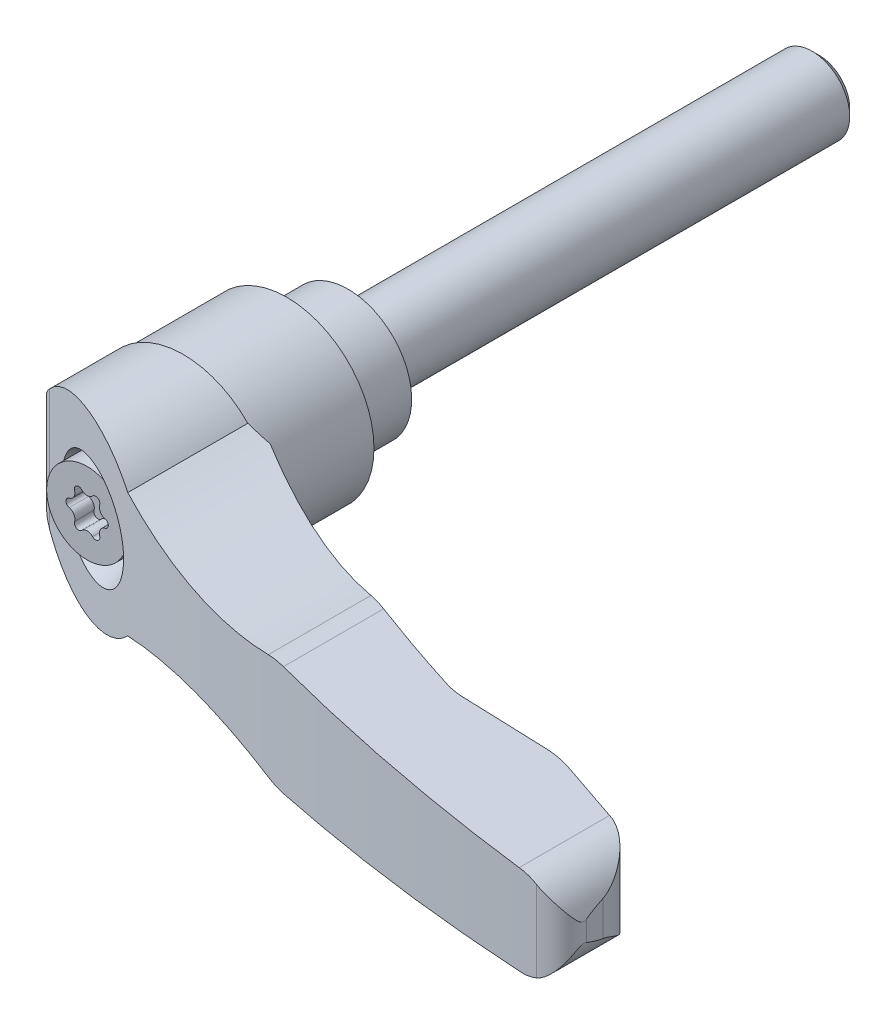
ISO-10303-21;
HEADER;
FILE_DESCRIPTION(('STEP AP214'),'2;1');
FILE_NAME('part.step','',(''),(''),'','','');
FILE_SCHEMA(('AUTOMOTIVE_DESIGN { 1 0 10303 214 1 1 1 1 }'));
ENDSEC;
DATA;
#1=APPLICATION_CONTEXT('core data for automotive mechanical design processes');
#2=APPLICATION_PROTOCOL_DEFINITION('international standard','automotive_design',2000,#1);
#3=PRODUCT_CONTEXT('',#1,'mechanical');
#4=PRODUCT('Part','Part','',(#3));
#5=PRODUCT_RELATED_PRODUCT_CATEGORY('part','',(#4));
#6=PRODUCT_DEFINITION_FORMATION('','',#4);
#7=PRODUCT_DEFINITION_CONTEXT('part definition',#1,'design');
#8=PRODUCT_DEFINITION('design','',#6,#7);
#9=PRODUCT_DEFINITION_SHAPE('','',#8);
#10=(LENGTH_UNIT() NAMED_UNIT(*) SI_UNIT(.MILLI.,.METRE.));
#11=(NAMED_UNIT(*) PLANE_ANGLE_UNIT() SI_UNIT($,.RADIAN.));
#12=(NAMED_UNIT(*) SI_UNIT($,.STERADIAN.) SOLID_ANGLE_UNIT());
#13=UNCERTAINTY_MEASURE_WITH_UNIT(LENGTH_MEASURE(1.E-05),#10,'distance_accuracy_value','');
#14=(GEOMETRIC_REPRESENTATION_CONTEXT(3) GLOBAL_UNCERTAINTY_ASSIGNED_CONTEXT((#13)) GLOBAL_UNIT_ASSIGNED_CONTEXT((#10,
#11,#12)) REPRESENTATION_CONTEXT('',''));
#15=CARTESIAN_POINT('',(0.,0.,0.));
#16=DIRECTION('',(0.,0.,1.));
#17=DIRECTION('',(1.,0.,0.));
#18=AXIS2_PLACEMENT_3D('',#15,#16,#17);
#19=CARTESIAN_POINT('',(0.,0.,7.15));
#20=DIRECTION('',(0.,0.,-1.));
#21=DIRECTION('',(0.,1.,0.));
#22=AXIS2_PLACEMENT_3D('',#19,#20,#21);
#23=CONICAL_SURFACE('',#22,6.75,0.78539816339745);
#24=CARTESIAN_POINT('',(0.,0.,6.9));
#25=DIRECTION('',(0.,0.,1.));
#26=DIRECTION('',(0.,-1.,0.));
#27=AXIS2_PLACEMENT_3D('',#24,#25,#26);
#28=CIRCLE('',#27,7.);
#29=CARTESIAN_POINT('',(0.,-7.,6.9));
#30=VERTEX_POINT('',#29);
#31=EDGE_CURVE('E1536',#30,#30,#28,.T.);
#32=ORIENTED_EDGE('',*,*,#31,.F.);
#33=EDGE_LOOP('',(#32));
#34=FACE_BOUND('',#33,.T.);
#35=CARTESIAN_POINT('',(0.,0.,7.15));
#36=DIRECTION('',(0.,0.,1.));
#37=DIRECTION('',(0.,-1.,0.));
#38=AXIS2_PLACEMENT_3D('',#35,#36,#37);
#39=CIRCLE('',#38,6.75);
#40=CARTESIAN_POINT('',(-0.00500000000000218,-6.74999814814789,7.15));
#41=VERTEX_POINT('',#40);
#42=CARTESIAN_POINT('',(-0.00500000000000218,6.74999814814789,7.15));
#43=VERTEX_POINT('',#42);
#44=EDGE_CURVE('E1690',#41,#43,#39,.T.);
#45=ORIENTED_EDGE('',*,*,#44,.T.);
#46=CARTESIAN_POINT('',(5.95054624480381,3.16771028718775,7.15882880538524));
#47=CARTESIAN_POINT('',(5.87214197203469,3.31526387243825,7.15871249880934));
#48=CARTESIAN_POINT('',(5.78824204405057,3.45989084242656,7.15858804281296));
#49=CARTESIAN_POINT('',(5.60995542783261,3.74252309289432,7.15832358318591));
#50=CARTESIAN_POINT('',(5.51556909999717,3.88052860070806,7.15818358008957));
#51=CARTESIAN_POINT('',(5.31687953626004,4.14906407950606,7.15788887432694));
#52=CARTESIAN_POINT('',(5.21258340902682,4.27959930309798,7.1577341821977));
#53=CARTESIAN_POINT('',(4.99462828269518,4.53255940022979,7.15741092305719));
#54=CARTESIAN_POINT('',(4.88096929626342,4.65498428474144,7.1572423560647));
#55=CARTESIAN_POINT('',(4.52680105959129,5.0091164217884,7.15671711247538));
#56=CARTESIAN_POINT('',(4.27301107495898,5.22780189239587,7.15634076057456));
#57=CARTESIAN_POINT('',(3.73579977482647,5.62522516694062,7.15554419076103));
#58=CARTESIAN_POINT('',(3.45237121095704,5.8039531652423,7.15512396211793));
#59=CARTESIAN_POINT('',(2.98991055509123,6.04972086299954,7.15443835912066));
#60=CARTESIAN_POINT('',(2.81864020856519,6.13166517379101,7.15418446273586));
#61=CARTESIAN_POINT('',(2.46976057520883,6.28086402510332,7.1536673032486));
#62=CARTESIAN_POINT('',(2.29215072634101,6.34811725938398,7.15340403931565));
#63=CARTESIAN_POINT('',(1.93187344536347,6.4674302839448,7.15287004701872));
#64=CARTESIAN_POINT('',(1.749205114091,6.51948735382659,7.15259931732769));
#65=CARTESIAN_POINT('',(1.38006402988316,6.60804492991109,7.15205225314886));
#66=CARTESIAN_POINT('',(1.19358993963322,6.64453986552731,7.1517759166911));
#67=CARTESIAN_POINT('',(0.818326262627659,6.70166995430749,7.15121984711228));
#68=CARTESIAN_POINT('',(0.62953790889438,6.72231320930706,7.15094011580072));
#69=CARTESIAN_POINT('',(0.250823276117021,6.74762924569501,7.15037900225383));
#70=CARTESIAN_POINT('',(0.0608966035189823,6.75229614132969,7.15009761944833));
#71=CARTESIAN_POINT('',(-0.318584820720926,6.745611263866,7.14953544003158));
#72=CARTESIAN_POINT('',(-0.50813970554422,6.73426704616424,7.14925464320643));
#73=CARTESIAN_POINT('',(-0.885690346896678,6.69564698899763,7.14869539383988));
#74=CARTESIAN_POINT('',(-1.07368550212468,6.66836527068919,7.148416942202));
#75=CARTESIAN_POINT('',(-1.44664736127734,6.59807116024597,7.14786455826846));
#76=CARTESIAN_POINT('',(-1.63161504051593,6.55506394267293,7.14759062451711));
#77=CARTESIAN_POINT('',(-1.99733844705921,6.45360450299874,7.14704902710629));
#78=CARTESIAN_POINT('',(-2.17809259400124,6.39514658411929,7.14678136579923));
#79=CARTESIAN_POINT('',(-2.53397104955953,6.26323162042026,7.14625441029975));
#80=CARTESIAN_POINT('',(-2.70909728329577,6.18977976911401,7.1459951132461));
#81=CARTESIAN_POINT('',(-3.05260414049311,6.02835694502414,7.14548653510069));
#82=CARTESIAN_POINT('',(-3.22098224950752,5.94038062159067,7.14523725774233));
#83=CARTESIAN_POINT('',(-3.54966502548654,5.75058860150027,7.14475068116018));
#84=CARTESIAN_POINT('',(-3.70997272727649,5.64877816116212,7.14451337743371));
#85=CARTESIAN_POINT('',(-4.02149908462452,5.43198004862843,7.14405224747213));
#86=CARTESIAN_POINT('',(-4.17271436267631,5.31698752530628,7.14382842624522));
#87=CARTESIAN_POINT('',(-4.46487029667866,5.0747031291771,7.14339601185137));
#88=CARTESIAN_POINT('',(-4.60581476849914,4.94741586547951,7.14318741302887));
#89=CARTESIAN_POINT('',(-4.87650660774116,4.68141969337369,7.14278680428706));
#90=CARTESIAN_POINT('',(-5.00624982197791,4.54270658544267,7.14259480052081));
#91=CARTESIAN_POINT('',(-5.37713243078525,4.11095768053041,7.1420459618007));
#92=CARTESIAN_POINT('',(-5.60024183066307,3.80204889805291,7.14171583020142));
#93=CARTESIAN_POINT('',(-5.99130267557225,3.15132134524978,7.14113721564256));
#94=CARTESIAN_POINT('',(-6.15925409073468,2.80950255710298,7.14088873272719));
#95=CARTESIAN_POINT('',(-6.4354212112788,2.10247678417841,7.14048016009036));
#96=CARTESIAN_POINT('',(-6.54363699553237,1.73726983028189,7.1403200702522));
#97=CARTESIAN_POINT('',(-6.69721027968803,0.993883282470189,7.14009288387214));
#98=CARTESIAN_POINT('',(-6.74256778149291,0.615703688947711,7.14002578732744));
#99=CARTESIAN_POINT('',(-6.76915048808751,-0.142905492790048,7.13998646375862));
#100=CARTESIAN_POINT('',(-6.75037574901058,-0.523335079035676,7.14001423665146));
#101=CARTESIAN_POINT('',(-6.64922373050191,-1.27564178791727,7.14016387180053));
#102=CARTESIAN_POINT('',(-6.56684643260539,-1.64751890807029,7.14028573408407));
#103=CARTESIAN_POINT('',(-6.3408273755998,-2.37216563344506,7.14062010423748));
#104=CARTESIAN_POINT('',(-6.19718558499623,-2.72493522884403,7.14083261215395));
#105=CARTESIAN_POINT('',(-5.85271992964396,-3.40135021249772,7.14134225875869));
#106=CARTESIAN_POINT('',(-5.65189615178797,-3.72499564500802,7.14163939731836));
#107=CARTESIAN_POINT('',(-5.19874978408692,-4.3339812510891,7.14230992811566));
#108=CARTESIAN_POINT('',(-4.94642727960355,-4.61932148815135,7.14268332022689));
#109=CARTESIAN_POINT('',(-4.39751106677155,-5.14357632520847,7.14349569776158));
#110=CARTESIAN_POINT('',(-4.10091709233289,-5.38249064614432,7.14393468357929));
#111=CARTESIAN_POINT('',(-3.47162650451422,-5.80719590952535,7.14486619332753));
#112=CARTESIAN_POINT('',(-3.13892958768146,-5.99298640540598,7.14535871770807));
#113=CARTESIAN_POINT('',(-2.62040810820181,-6.2277174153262,7.14612642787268));
#114=CARTESIAN_POINT('',(-2.4442237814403,-6.29866103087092,7.146387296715));
#115=CARTESIAN_POINT('',(-2.08652512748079,-6.4254556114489,7.14691695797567));
#116=CARTESIAN_POINT('',(-1.90501279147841,-6.48131213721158,7.14718574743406));
#117=CARTESIAN_POINT('',(-1.53787641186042,-6.57754805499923,7.14772944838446));
#118=CARTESIAN_POINT('',(-1.35225095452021,-6.61792203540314,7.14800436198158));
#119=CARTESIAN_POINT('',(-0.978324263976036,-6.68287651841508,7.14855818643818));
#120=CARTESIAN_POINT('',(-0.790024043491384,-6.7074628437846,7.14883709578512));
#121=CARTESIAN_POINT('',(-0.41194099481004,-6.74069534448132,7.149397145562));
#122=CARTESIAN_POINT('',(-0.22215756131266,-6.74933462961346,7.14967828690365));
#123=CARTESIAN_POINT('',(0.157392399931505,-6.75059115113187,7.15024057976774));
#124=CARTESIAN_POINT('',(0.347158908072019,-6.74321429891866,7.15052173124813));
#125=CARTESIAN_POINT('',(0.725474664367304,-6.71249645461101,7.15108226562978));
#126=CARTESIAN_POINT('',(0.91402337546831,-6.68914884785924,7.15136164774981));
#127=CARTESIAN_POINT('',(1.28841363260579,-6.62666031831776,7.1519164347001));
#128=CARTESIAN_POINT('',(1.47425615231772,-6.58752522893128,7.15219184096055));
#129=CARTESIAN_POINT('',(1.84202427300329,-6.49372979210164,7.15273688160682));
#130=CARTESIAN_POINT('',(2.02394901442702,-6.43906607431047,7.15300651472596));
#131=CARTESIAN_POINT('',(2.38247988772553,-6.31462857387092,7.15353792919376));
#132=CARTESIAN_POINT('',(2.55908795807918,-6.24486037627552,7.15379971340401));
#133=CARTESIAN_POINT('',(2.90586095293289,-6.09067104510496,7.15431376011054));
#134=CARTESIAN_POINT('',(3.0760236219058,-6.00624483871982,7.1545660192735));
#135=CARTESIAN_POINT('',(3.40856965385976,-5.82339024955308,7.15505903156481));
#136=CARTESIAN_POINT('',(3.57095586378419,-5.72496704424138,7.15529978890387));
#137=CARTESIAN_POINT('',(3.88695180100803,-5.51473477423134,7.15576831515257));
#138=CARTESIAN_POINT('',(4.04055650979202,-5.40291816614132,7.15599607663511));
#139=CARTESIAN_POINT('',(4.33774237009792,-5.16678267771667,7.1564367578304));
#140=CARTESIAN_POINT('',(4.48132720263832,-5.04246843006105,7.15664968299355));
#141=CARTESIAN_POINT('',(4.75747498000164,-4.78222404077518,7.1570592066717));
#142=CARTESIAN_POINT('',(4.89004107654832,-4.64629724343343,7.1572558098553));
#143=CARTESIAN_POINT('',(5.1432585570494,-4.36376193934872,7.15763136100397));
#144=CARTESIAN_POINT('',(5.26390979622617,-4.21715330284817,7.1578103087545));
#145=CARTESIAN_POINT('',(5.49251358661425,-3.91418724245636,7.15814938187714));
#146=CARTESIAN_POINT('',(5.6004571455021,-3.75782303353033,7.15830949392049));
#147=CARTESIAN_POINT('',(5.80280439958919,-3.43655641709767,7.15860964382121));
#148=CARTESIAN_POINT('',(5.89720744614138,-3.27165360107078,7.15874968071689));
#149=CARTESIAN_POINT('',(5.98446360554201,-3.10304786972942,7.15887911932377));
#150=B_SPLINE_CURVE_WITH_KNOTS('',3,(#46,#47,#48,#49,#50,#51,#52,#53,#54,#55,#56,#57,#58,#59,
#60,#61,#62,#63,#64,#65,#66,#67,#68,#69,#70,#71,#72,#73,#74,#75,#76,#77,#78,#79,#80,#81,#82,#83,
#84,#85,#86,#87,#88,#89,#90,#91,#92,#93,#94,#95,#96,#97,#98,#99,#100,#101,#102,#103,#104,#105,
#106,#107,#108,#109,#110,#111,#112,#113,#114,#115,#116,#117,#118,#119,#120,#121,#122,#123,#124,
#125,#126,#127,#128,#129,#130,#131,#132,#133,#134,#135,#136,#137,#138,#139,#140,#141,#142,#143,
#144,#145,#146,#147,#148,#149),.UNSPECIFIED.,.F.,.F.,(4,2,2,2,2,2,2,2,2,2,2,2,2,2,2,2,2,2,2,2,2,
2,2,2,2,2,2,2,2,2,2,2,2,2,2,2,2,2,2,2,2,2,2,2,2,2,2,2,2,2,2,4),(0.,0.501146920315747,
1.00227662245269,1.50304952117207,2.00382174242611,3.00491984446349,4.00626334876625,
4.57526571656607,5.14431865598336,5.71347340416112,6.28283171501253,6.85189883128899,
7.42117557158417,7.99018376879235,8.55940198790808,9.1284330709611,9.69767425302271,
10.2667185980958,10.8359730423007,11.4050117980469,11.9742606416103,12.5432969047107,
13.1125432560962,14.2498149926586,15.3870873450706,16.5243581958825,17.6616290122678,
18.7988988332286,19.9361689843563,21.0734397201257,22.2107087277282,23.3479758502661,
24.4852498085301,25.6225333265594,26.1917743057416,26.7608051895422,27.3300347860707,
27.8990543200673,28.4683196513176,29.0373749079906,29.6066659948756,30.1757469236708,
30.7449514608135,31.3139458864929,31.8831376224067,32.4521193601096,33.0214230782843,
33.5905165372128,34.1594466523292,34.7283836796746,35.2977209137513,35.8670854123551),.UNSPECIFIED.);
#151=EDGE_CURVE('E1534',#43,#41,#150,.T.);
#152=ORIENTED_EDGE('',*,*,#151,.T.);
#153=EDGE_LOOP('',(#45,#152));
#154=FACE_BOUND('',#153,.T.);
#155=ADVANCED_FACE('F15',(#34,#154),#23,.F.);
#156=CARTESIAN_POINT('',(0.,0.,6.5));
#157=DIRECTION('',(0.,0.,1.));
#158=DIRECTION('',(0.,-1.,0.));
#159=AXIS2_PLACEMENT_3D('',#156,#157,#158);
#160=CYLINDRICAL_SURFACE('',#159,7.);
#161=CARTESIAN_POINT('',(0.,0.,6.5));
#162=DIRECTION('',(0.,0.,-1.));
#163=DIRECTION('',(1.,0.,0.));
#164=AXIS2_PLACEMENT_3D('',#161,#162,#163);
#165=CIRCLE('',#164,7.);
#166=CARTESIAN_POINT('',(7.,0.,6.5));
#167=VERTEX_POINT('',#166);
#168=EDGE_CURVE('E743',#167,#167,#165,.T.);
#169=ORIENTED_EDGE('',*,*,#168,.T.);
#170=EDGE_LOOP('',(#169));
#171=FACE_BOUND('',#170,.T.);
#172=ORIENTED_EDGE('',*,*,#31,.T.);
#173=EDGE_LOOP('',(#172));
#174=FACE_BOUND('',#173,.T.);
#175=ADVANCED_FACE('F873',(#171,#174),#160,.F.);
#176=CARTESIAN_POINT('',(0.,0.,6.5));
#177=DIRECTION('',(0.,0.,1.));
#178=DIRECTION('',(0.,-1.,0.));
#179=AXIS2_PLACEMENT_3D('',#176,#177,#178);
#180=CYLINDRICAL_SURFACE('',#179,6.75);
#181=ORIENTED_EDGE('',*,*,#44,.F.);
#182=DIRECTION('',(0.,0.,1.));
#183=VECTOR('',#182,1.);
#184=CARTESIAN_POINT('',(-0.00500000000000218,-6.74999814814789,8.25));
#185=LINE('',#184,#183);
#186=CARTESIAN_POINT('',(-0.00500000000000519,-6.7499981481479,16.5));
#187=VERTEX_POINT('',#186);
#188=EDGE_CURVE('E1529',#41,#187,#185,.T.);
#189=ORIENTED_EDGE('',*,*,#188,.T.);
#190=CARTESIAN_POINT('',(0.,0.,16.5));
#191=DIRECTION('',(0.,0.,1.));
#192=DIRECTION('',(0.,-1.,0.));
#193=AXIS2_PLACEMENT_3D('',#190,#191,#192);
#194=CIRCLE('',#193,6.75);
#195=CARTESIAN_POINT('',(-0.00499999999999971,6.7499981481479,16.5));
#196=VERTEX_POINT('',#195);
#197=EDGE_CURVE('E1684',#187,#196,#194,.T.);
#198=ORIENTED_EDGE('',*,*,#197,.T.);
#199=DIRECTION('',(0.,0.,1.));
#200=VECTOR('',#199,1.);
#201=CARTESIAN_POINT('',(-0.00500000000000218,6.74999814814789,8.25));
#202=LINE('',#201,#200);
#203=EDGE_CURVE('E1532',#196,#43,#202,.F.);
#204=ORIENTED_EDGE('',*,*,#203,.T.);
#205=EDGE_LOOP('',(#181,#189,#198,#204));
#206=FACE_BOUND('',#205,.T.);
#207=ADVANCED_FACE('F862',(#206),#180,.F.);
#208=CARTESIAN_POINT('',(4.15,0.,16.5));
#209=DIRECTION('',(0.,0.,1.));
#210=DIRECTION('',(0.,-1.,0.));
#211=AXIS2_PLACEMENT_3D('',#208,#209,#210);
#212=PLANE('',#211);
#213=ORIENTED_EDGE('',*,*,#197,.F.);
#214=CARTESIAN_POINT('',(-0.0100000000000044,0.,16.5));
#215=DIRECTION('',(0.,0.,1.));
#216=DIRECTION('',(-1.,0.,0.));
#217=AXIS2_PLACEMENT_3D('',#214,#215,#216);
#218=CIRCLE('',#217,6.75);
#219=EDGE_CURVE('E1528',#187,#196,#218,.T.);
#220=ORIENTED_EDGE('',*,*,#219,.T.);
#221=EDGE_LOOP('',(#213,#220));
#222=FACE_BOUND('',#221,.T.);
#223=ADVANCED_FACE('F407',(#222),#212,.F.);
#224=CARTESIAN_POINT('',(-0.0099999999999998,0.,6.5));
#225=DIRECTION('',(0.,0.,-1.));
#226=DIRECTION('',(1.,0.,0.));
#227=AXIS2_PLACEMENT_3D('',#224,#225,#226);
#228=PLANE('',#227);
#229=ORIENTED_EDGE('',*,*,#168,.F.);
#230=EDGE_LOOP('',(#229));
#231=FACE_BOUND('',#230,.T.);
#232=DIRECTION('',(0.,1.,0.));
#233=VECTOR('',#232,1.);
#234=CARTESIAN_POINT('',(-9.0100377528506,-19.,6.5));
#235=LINE('',#234,#233);
#236=CARTESIAN_POINT('',(-9.0100377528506,-2.13584185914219,6.5));
#237=VERTEX_POINT('',#236);
#238=CARTESIAN_POINT('',(-9.0100377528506,2.13584185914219,6.5));
#239=VERTEX_POINT('',#238);
#240=EDGE_CURVE('E122',#237,#239,#235,.T.);
#241=ORIENTED_EDGE('',*,*,#240,.T.);
#242=CARTESIAN_POINT('',(-0.0099999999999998,0.,6.5));
#243=DIRECTION('',(0.,0.,-1.));
#244=DIRECTION('',(1.,0.,0.));
#245=AXIS2_PLACEMENT_3D('',#242,#243,#244);
#246=CIRCLE('',#245,9.25);
#247=EDGE_CURVE('E610',#239,#237,#246,.T.);
#248=ORIENTED_EDGE('',*,*,#247,.T.);
#249=EDGE_LOOP('',(#241,#248));
#250=FACE_BOUND('',#249,.T.);
#251=ADVANCED_FACE('F402',(#231,#250),#228,.T.);
#252=CARTESIAN_POINT('',(-9.26,-19.,6.7499622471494));
#253=DIRECTION('',(0.707106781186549,0.,0.707106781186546));
#254=DIRECTION('',(-0.707106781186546,0.,0.707106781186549));
#255=AXIS2_PLACEMENT_3D('',#252,#253,#254);
#256=PLANE('',#255);
#257=CARTESIAN_POINT('',(-0.00999999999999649,0.,-2.50003775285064));
#258=DIRECTION('',(0.707106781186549,0.,0.707106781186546));
#259=DIRECTION('',(0.707106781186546,0.,-0.707106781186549));
#260=AXIS2_PLACEMENT_3D('',#257,#258,#259);
#261=ELLIPSE('',#260,13.0814754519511,9.25);
#262=EDGE_CURVE('E320',#237,#239,#261,.F.);
#263=ORIENTED_EDGE('',*,*,#262,.T.);
#264=ORIENTED_EDGE('',*,*,#240,.F.);
#265=EDGE_LOOP('',(#263,#264));
#266=FACE_BOUND('',#265,.T.);
#267=ADVANCED_FACE('F406',(#266),#256,.F.);
#268=CARTESIAN_POINT('',(-0.010000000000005,0.,20.625));
#269=DIRECTION('',(0.,0.,-1.));
#270=DIRECTION('',(1.,0.,0.));
#271=AXIS2_PLACEMENT_3D('',#268,#269,#270);
#272=CYLINDRICAL_SURFACE('',#271,9.25);
#273=CARTESIAN_POINT('',(-0.0100000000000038,0.,17.5));
#274=DIRECTION('',(0.,0.,1.));
#275=DIRECTION('',(0.,-1.,0.));
#276=AXIS2_PLACEMENT_3D('',#273,#274,#275);
#277=CIRCLE('',#276,9.25);
#278=CARTESIAN_POINT('',(-9.26,0.,17.5));
#279=VERTEX_POINT('',#278);
#280=CARTESIAN_POINT('',(9.24,0.,17.5));
#281=VERTEX_POINT('',#280);
#282=EDGE_CURVE('E651',#279,#281,#277,.T.);
#283=ORIENTED_EDGE('',*,*,#282,.F.);
#284=EDGE_CURVE('E631',#281,#279,#277,.T.);
#285=ORIENTED_EDGE('',*,*,#284,.F.);
#286=EDGE_LOOP('',(#283,#285));
#287=FACE_BOUND('',#286,.T.);
#288=ORIENTED_EDGE('',*,*,#262,.F.);
#289=ORIENTED_EDGE('',*,*,#247,.F.);
#290=EDGE_LOOP('',(#288,#289));
#291=FACE_BOUND('',#290,.T.);
#292=ADVANCED_FACE('F409',(#287,#291),#272,.T.);
#293=CARTESIAN_POINT('',(0.,0.,6.5));
#294=DIRECTION('',(0.,0.,1.));
#295=DIRECTION('',(0.,-1.,0.));
#296=AXIS2_PLACEMENT_3D('',#293,#294,#295);
#297=CYLINDRICAL_SURFACE('',#296,2.5);
#298=CARTESIAN_POINT('',(0.,0.,19.));
#299=DIRECTION('',(0.,0.,1.));
#300=DIRECTION('',(0.,-1.,0.));
#301=AXIS2_PLACEMENT_3D('',#298,#299,#300);
#302=CIRCLE('',#301,2.5);
#303=CARTESIAN_POINT('',(-0.00500000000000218,-2.499994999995,19.));
#304=VERTEX_POINT('',#303);
#305=CARTESIAN_POINT('',(-0.00500000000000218,2.499994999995,19.));
#306=VERTEX_POINT('',#305);
#307=EDGE_CURVE('E304',#304,#306,#302,.T.);
#308=ORIENTED_EDGE('',*,*,#307,.F.);
#309=DIRECTION('',(0.,0.,1.));
#310=VECTOR('',#309,1.);
#311=CARTESIAN_POINT('',(-0.00500000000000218,-2.499994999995,21.95));
#312=LINE('',#311,#310);
#313=CARTESIAN_POINT('',(-0.00500000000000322,-2.499994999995,20.));
#314=VERTEX_POINT('',#313);
#315=EDGE_CURVE('E292',#304,#314,#312,.T.);
#316=ORIENTED_EDGE('',*,*,#315,.T.);
#317=CARTESIAN_POINT('',(0.,0.,20.));
#318=DIRECTION('',(0.,0.,1.));
#319=DIRECTION('',(0.,-1.,0.));
#320=AXIS2_PLACEMENT_3D('',#317,#318,#319);
#321=CIRCLE('',#320,2.5);
#322=CARTESIAN_POINT('',(-0.00500000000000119,2.499994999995,20.));
#323=VERTEX_POINT('',#322);
#324=EDGE_CURVE('E302',#314,#323,#321,.T.);
#325=ORIENTED_EDGE('',*,*,#324,.T.);
#326=DIRECTION('',(0.,0.,1.));
#327=VECTOR('',#326,1.);
#328=CARTESIAN_POINT('',(-0.00500000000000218,2.499994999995,21.95));
#329=LINE('',#328,#327);
#330=EDGE_CURVE('E294',#323,#306,#329,.F.);
#331=ORIENTED_EDGE('',*,*,#330,.T.);
#332=EDGE_LOOP('',(#308,#316,#325,#331));
#333=FACE_BOUND('',#332,.T.);
#334=ADVANCED_FACE('F301',(#333),#297,.F.);
#335=CARTESIAN_POINT('',(4.3,0.,20.));
#336=DIRECTION('',(0.,0.,-1.));
#337=DIRECTION('',(0.,1.,0.));
#338=AXIS2_PLACEMENT_3D('',#335,#336,#337);
#339=PLANE('',#338);
#340=ORIENTED_EDGE('',*,*,#324,.F.);
#341=CARTESIAN_POINT('',(-0.0100000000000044,0.,20.));
#342=DIRECTION('',(0.,0.,-1.));
#343=DIRECTION('',(1.,0.,0.));
#344=AXIS2_PLACEMENT_3D('',#341,#342,#343);
#345=CIRCLE('',#344,2.5);
#346=EDGE_CURVE('E288',#314,#323,#345,.T.);
#347=ORIENTED_EDGE('',*,*,#346,.T.);
#348=EDGE_LOOP('',(#340,#347));
#349=FACE_BOUND('',#348,.T.);
#350=CARTESIAN_POINT('',(0.,0.,20.));
#351=DIRECTION('',(0.,0.,1.));
#352=DIRECTION('',(0.,-1.,0.));
#353=AXIS2_PLACEMENT_3D('',#350,#351,#352);
#354=CIRCLE('',#353,4.3);
#355=CARTESIAN_POINT('',(0.,-4.3,20.));
#356=VERTEX_POINT('',#355);
#357=EDGE_CURVE('E309',#356,#356,#354,.T.);
#358=ORIENTED_EDGE('',*,*,#357,.T.);
#359=EDGE_LOOP('',(#358));
#360=FACE_BOUND('',#359,.T.);
#361=ADVANCED_FACE('F307',(#349,#360),#339,.F.);
#362=CARTESIAN_POINT('',(0.,0.,6.5));
#363=DIRECTION('',(0.,0.,1.));
#364=DIRECTION('',(0.,-1.,0.));
#365=AXIS2_PLACEMENT_3D('',#362,#363,#364);
#366=CYLINDRICAL_SURFACE('',#365,4.3);
#367=ORIENTED_EDGE('',*,*,#357,.F.);
#368=EDGE_LOOP('',(#367));
#369=FACE_BOUND('',#368,.T.);
#370=CARTESIAN_POINT('',(0.,0.,24.9));
#371=DIRECTION('',(0.,0.,1.));
#372=DIRECTION('',(0.,-1.,0.));
#373=AXIS2_PLACEMENT_3D('',#370,#371,#372);
#374=CIRCLE('',#373,4.3);
#375=CARTESIAN_POINT('',(-0.00500000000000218,4.29999709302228,24.9));
#376=VERTEX_POINT('',#375);
#377=CARTESIAN_POINT('',(-0.00500000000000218,-4.29999709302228,24.9));
#378=VERTEX_POINT('',#377);
#379=EDGE_CURVE('E32',#376,#378,#374,.T.);
#380=ORIENTED_EDGE('',*,*,#379,.T.);
#381=EDGE_CURVE('E312',#378,#376,#374,.T.);
#382=ORIENTED_EDGE('',*,*,#381,.T.);
#383=EDGE_LOOP('',(#380,#382));
#384=FACE_BOUND('',#383,.T.);
#385=ADVANCED_FACE('F732',(#369,#384),#366,.F.);
#386=CARTESIAN_POINT('',(0.,0.,35.));
#387=DIRECTION('',(0.,0.,1.));
#388=DIRECTION('',(0.,-1.,0.));
#389=AXIS2_PLACEMENT_3D('',#386,#387,#388);
#390=CONICAL_SURFACE('',#389,7.9760993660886,0.349065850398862);
#391=ORIENTED_EDGE('',*,*,#381,.F.);
#392=CARTESIAN_POINT('',(4.21911062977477,0.777575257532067,24.8729792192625));
#393=CARTESIAN_POINT('',(4.19017452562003,0.935198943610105,24.8731645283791));
#394=CARTESIAN_POINT('',(4.15234047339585,1.09119842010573,24.8734068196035));
#395=CARTESIAN_POINT('',(4.059442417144,1.39832967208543,24.8740017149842));
#396=CARTESIAN_POINT('',(4.00434335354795,1.54945084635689,24.8743545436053));
#397=CARTESIAN_POINT('',(3.88711156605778,1.8224107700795,24.8751051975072));
#398=CARTESIAN_POINT('',(3.82727411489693,1.94524131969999,24.8754883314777));
#399=CARTESIAN_POINT('',(3.69616738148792,2.18470908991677,24.8763277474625));
#400=CARTESIAN_POINT('',(3.62489389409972,2.30134401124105,24.8767840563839));
#401=CARTESIAN_POINT('',(3.47154435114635,2.52735215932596,24.8777657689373));
#402=CARTESIAN_POINT('',(3.38946369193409,2.63672226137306,24.8782912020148));
#403=CARTESIAN_POINT('',(3.21521868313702,2.84721641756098,24.879406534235));
#404=CARTESIAN_POINT('',(3.1230486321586,2.94833575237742,24.879996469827));
#405=CARTESIAN_POINT('',(2.92952252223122,3.14131773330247,24.8812350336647));
#406=CARTESIAN_POINT('',(2.82816855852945,3.23318248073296,24.8818836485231));
#407=CARTESIAN_POINT('',(2.61723558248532,3.40679926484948,24.8832333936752));
#408=CARTESIAN_POINT('',(2.50766118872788,3.48855691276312,24.8839344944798));
#409=CARTESIAN_POINT('',(2.28124664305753,3.6412681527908,24.8853830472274));
#410=CARTESIAN_POINT('',(2.16440734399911,3.71222300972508,24.8861304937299));
#411=CARTESIAN_POINT('',(1.92451769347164,3.842691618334,24.8876649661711));
#412=CARTESIAN_POINT('',(1.80146803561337,3.90220664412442,24.8884519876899));
#413=CARTESIAN_POINT('',(1.56465844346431,4.00313271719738,24.8899664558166));
#414=CARTESIAN_POINT('',(1.45144687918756,4.04583613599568,24.8906904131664));
#415=CARTESIAN_POINT('',(1.22178798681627,4.12156773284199,24.8921588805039));
#416=CARTESIAN_POINT('',(1.10533963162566,4.15459280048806,24.892903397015));
#417=CARTESIAN_POINT('',(0.870158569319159,4.21069182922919,24.8944068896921));
#418=CARTESIAN_POINT('',(0.751427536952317,4.23377281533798,24.8951658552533));
#419=CARTESIAN_POINT('',(0.512399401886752,4.2698610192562,24.8966936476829));
#420=CARTESIAN_POINT('',(0.392101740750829,4.28286453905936,24.8974624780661));
#421=CARTESIAN_POINT('',(0.150864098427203,4.29868948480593,24.8990040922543));
#422=CARTESIAN_POINT('',(0.0299242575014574,4.30151304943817,24.8997768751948));
#423=CARTESIAN_POINT('',(-0.211808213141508,4.29696318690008,24.9013213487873));
#424=CARTESIAN_POINT('',(-0.332600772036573,4.28958599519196,24.9020930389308));
#425=CARTESIAN_POINT('',(-0.573100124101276,4.26468392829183,24.903629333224));
#426=CARTESIAN_POINT('',(-0.692807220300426,4.24716197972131,24.9043939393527));
#427=CARTESIAN_POINT('',(-0.930363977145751,4.20208899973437,24.9059111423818));
#428=CARTESIAN_POINT('',(-1.04821293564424,4.17453426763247,24.9066637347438));
#429=CARTESIAN_POINT('',(-1.28112388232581,4.10960500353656,24.9081509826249));
#430=CARTESIAN_POINT('',(-1.39618696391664,4.07223439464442,24.9088856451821));
#431=CARTESIAN_POINT('',(-1.62279691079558,3.98792042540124,24.9103323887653));
#432=CARTESIAN_POINT('',(-1.73434246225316,3.94097353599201,24.9110444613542));
#433=CARTESIAN_POINT('',(-1.95304539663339,3.83786097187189,24.912440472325));
#434=CARTESIAN_POINT('',(-2.06020444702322,3.78169884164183,24.913124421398));
#435=CARTESIAN_POINT('',(-2.26942713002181,3.66055052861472,24.91445968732));
#436=CARTESIAN_POINT('',(-2.37148886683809,3.59556109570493,24.9151109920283));
#437=CARTESIAN_POINT('',(-2.66883118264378,3.38805062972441,24.9170083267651));
#438=CARTESIAN_POINT('',(-2.85550725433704,3.23287477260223,24.9181992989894));
#439=CARTESIAN_POINT('',(-3.20005222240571,2.89346359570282,24.9203971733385));
#440=CARTESIAN_POINT('',(-3.35792107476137,2.70922823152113,24.9214040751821));
#441=CARTESIAN_POINT('',(-3.64051281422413,2.31684980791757,24.9232062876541));
#442=CARTESIAN_POINT('',(-3.76523634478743,2.10870721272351,24.9240016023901));
#443=CARTESIAN_POINT('',(-3.97796133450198,1.67444195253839,24.9253579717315));
#444=CARTESIAN_POINT('',(-4.06596278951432,1.44831928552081,24.9259190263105));
#445=CARTESIAN_POINT('',(-4.20275431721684,0.984511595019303,24.9267911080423));
#446=CARTESIAN_POINT('',(-4.25154513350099,0.746826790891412,24.9271021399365));
#447=CARTESIAN_POINT('',(-4.30853013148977,0.266639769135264,24.9274654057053));
#448=CARTESIAN_POINT('',(-4.31672432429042,0.0241375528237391,24.9275176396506));
#449=CARTESIAN_POINT('',(-4.29228436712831,-0.458797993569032,24.9273618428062));
#450=CARTESIAN_POINT('',(-4.25965066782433,-0.699231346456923,24.9271538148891));
#451=CARTESIAN_POINT('',(-4.15448192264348,-1.17120658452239,24.9264833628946));
#452=CARTESIAN_POINT('',(-4.08194687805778,-1.40274846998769,24.9260209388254));
#453=CARTESIAN_POINT('',(-3.89903487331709,-1.8503684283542,24.9248547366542));
#454=CARTESIAN_POINT('',(-3.7886578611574,-2.06644648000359,24.9241509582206));
#455=CARTESIAN_POINT('',(-3.53319455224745,-2.47700499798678,24.9225218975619));
#456=CARTESIAN_POINT('',(-3.38810824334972,-2.67148545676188,24.9215966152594));
#457=CARTESIAN_POINT('',(-3.0673461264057,-3.03333067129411,24.9195506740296));
#458=CARTESIAN_POINT('',(-2.89166990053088,-3.20069505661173,24.9184300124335));
#459=CARTESIAN_POINT('',(-2.51470447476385,-3.50355516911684,24.9160249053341));
#460=CARTESIAN_POINT('',(-2.31341528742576,-3.63905091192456,24.9147404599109));
#461=CARTESIAN_POINT('',(-1.89097836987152,-3.87432713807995,24.9120443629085));
#462=CARTESIAN_POINT('',(-1.66983024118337,-3.97410690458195,24.9106327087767));
#463=CARTESIAN_POINT('',(-1.21378932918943,-4.13512752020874,24.9077211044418));
#464=CARTESIAN_POINT('',(-0.978896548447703,-4.19636837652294,24.9062211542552));
#465=CARTESIAN_POINT('',(-0.621588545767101,-4.25800990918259,24.9039390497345));
#466=CARTESIAN_POINT('',(-0.501591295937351,-4.27352066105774,24.9031725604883));
#467=CARTESIAN_POINT('',(-0.260728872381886,-4.29438227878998,24.9016338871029));
#468=CARTESIAN_POINT('',(-0.139864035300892,-4.29973689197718,24.9008617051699));
#469=CARTESIAN_POINT('',(0.101924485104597,-4.30024439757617,24.8993168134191));
#470=CARTESIAN_POINT('',(0.222848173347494,-4.2953934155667,24.8985441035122));
#471=CARTESIAN_POINT('',(0.463814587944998,-4.27552414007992,24.8970041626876));
#472=CARTESIAN_POINT('',(0.583857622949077,-4.26050959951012,24.8962369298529));
#473=CARTESIAN_POINT('',(0.822300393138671,-4.22041448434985,24.8947128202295));
#474=CARTESIAN_POINT('',(0.940699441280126,-4.19532982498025,24.8939559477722));
#475=CARTESIAN_POINT('',(1.17491972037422,-4.13528424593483,24.8924585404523));
#476=CARTESIAN_POINT('',(1.29074188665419,-4.10032697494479,24.8917179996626));
#477=CARTESIAN_POINT('',(1.51906443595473,-4.02076877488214,24.8902580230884));
#478=CARTESIAN_POINT('',(1.6315638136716,-3.97616496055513,24.8895385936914));
#479=CARTESIAN_POINT('',(1.85236368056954,-3.87765526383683,24.8881264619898));
#480=CARTESIAN_POINT('',(1.96066570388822,-3.82375282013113,24.8874337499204));
#481=CARTESIAN_POINT('',(2.17236892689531,-3.7070043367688,24.8860795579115));
#482=CARTESIAN_POINT('',(2.27576902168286,-3.64415629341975,24.8854180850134));
#483=CARTESIAN_POINT('',(2.4768700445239,-3.50999748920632,24.884131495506));
#484=CARTESIAN_POINT('',(2.5745730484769,-3.43868983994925,24.8835063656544));
#485=CARTESIAN_POINT('',(2.76369288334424,-3.28804682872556,24.8822962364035));
#486=CARTESIAN_POINT('',(2.85510533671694,-3.2087059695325,24.8817112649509));
#487=CARTESIAN_POINT('',(3.03088826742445,-3.04263305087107,24.8805863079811));
#488=CARTESIAN_POINT('',(3.11526099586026,-2.95590337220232,24.8800463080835));
#489=CARTESIAN_POINT('',(3.28683431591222,-2.76396860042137,24.8789481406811));
#490=CARTESIAN_POINT('',(3.37298834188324,-2.65782496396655,24.8783966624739));
#491=CARTESIAN_POINT('',(3.53477785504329,-2.4378649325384,24.8773609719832));
#492=CARTESIAN_POINT('',(3.6104169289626,-2.32405117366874,24.8768767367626));
#493=CARTESIAN_POINT('',(3.75057830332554,-2.0896671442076,24.8759793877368));
#494=CARTESIAN_POINT('',(3.81509300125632,-1.96909232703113,24.87556632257));
#495=CARTESIAN_POINT('',(3.93234744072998,-1.72236659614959,24.8748155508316));
#496=CARTESIAN_POINT('',(3.98508918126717,-1.59621663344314,24.8744778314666));
#497=CARTESIAN_POINT('',(4.07302731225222,-1.3540839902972,24.8739147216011));
#498=CARTESIAN_POINT('',(4.10953669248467,-1.2385758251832,24.8736809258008));
#499=CARTESIAN_POINT('',(4.17268203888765,-1.00489562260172,24.8732765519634));
#500=CARTESIAN_POINT('',(4.19931879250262,-0.886723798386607,24.8731059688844));
#501=CARTESIAN_POINT('',(4.24248727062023,-0.648801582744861,24.8728295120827));
#502=CARTESIAN_POINT('',(4.25903930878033,-0.529054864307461,24.8727235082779));
#503=CARTESIAN_POINT('',(4.2819987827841,-0.288641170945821,24.8725764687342));
#504=CARTESIAN_POINT('',(4.2884118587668,-0.167974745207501,24.8725353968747));
#505=CARTESIAN_POINT('',(4.29028727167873,0.00244530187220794,24.872523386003));
#506=CARTESIAN_POINT('',(4.28997110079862,0.0521813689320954,24.8725254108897));
#507=CARTESIAN_POINT('',(4.28761529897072,0.151554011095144,24.8725404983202));
#508=CARTESIAN_POINT('',(4.28557770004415,0.201190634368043,24.8725535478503));
#509=CARTESIAN_POINT('',(4.28268073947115,0.250782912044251,24.8725721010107));
#510=B_SPLINE_CURVE_WITH_KNOTS('',3,(#392,#393,#394,#395,#396,#397,#398,#399,#400,#401,#402,
#403,#404,#405,#406,#407,#408,#409,#410,#411,#412,#413,#414,#415,#416,#417,#418,#419,#420,#421,
#422,#423,#424,#425,#426,#427,#428,#429,#430,#431,#432,#433,#434,#435,#436,#437,#438,#439,#440,
#441,#442,#443,#444,#445,#446,#447,#448,#449,#450,#451,#452,#453,#454,#455,#456,#457,#458,#459,
#460,#461,#462,#463,#464,#465,#466,#467,#468,#469,#470,#471,#472,#473,#474,#475,#476,#477,#478,
#479,#480,#481,#482,#483,#484,#485,#486,#487,#488,#489,#490,#491,#492,#493,#494,#495,#496,#497,
#498,#499,#500,#501,#502,#503,#504,#505,#506,#507,#508,#509),.UNSPECIFIED.,.F.,.F.,(4,2,2,2,2,2,
2,2,2,2,2,2,2,2,2,2,2,2,2,2,2,2,2,2,2,2,2,2,2,2,2,2,2,2,2,2,2,2,2,2,2,2,2,2,2,2,2,2,2,2,2,2,2,2,
2,2,2,2,4),(0.,0.480548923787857,0.962080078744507,1.37137145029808,1.78081366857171,
2.19043086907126,2.60028074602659,3.01003735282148,3.41956544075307,3.82904554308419,
4.23848001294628,4.6010595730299,4.96375553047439,5.32619483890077,5.68876708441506,
6.05126315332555,6.41389303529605,6.77641835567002,7.13907753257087,7.50159198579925,
7.86424027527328,8.22674940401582,8.58939236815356,9.3138972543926,10.038403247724,
10.7628951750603,11.4873871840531,12.2118654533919,12.9363435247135,13.6608135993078,
14.3852836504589,15.1097546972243,15.8342259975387,16.5587071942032,17.2831880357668,
18.0076834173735,18.732178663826,19.0948199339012,19.4573273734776,19.8199724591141,
20.1824837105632,20.5451421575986,20.9076667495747,21.2702999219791,21.6327992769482,
21.9953799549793,22.3578276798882,22.7205251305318,23.0831061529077,23.492599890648,
23.9019536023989,24.3115859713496,24.7211487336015,25.0841506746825,25.4471236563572,
25.8093630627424,26.171400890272,26.3205880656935,26.4695993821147),.UNSPECIFIED.);
#511=EDGE_CURVE('E298',#378,#376,#510,.F.);
#512=ORIENTED_EDGE('',*,*,#511,.T.);
#513=EDGE_LOOP('',(#391,#512));
#514=FACE_BOUND('',#513,.T.);
#515=CARTESIAN_POINT('',(-3.02765260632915,3.78926210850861,26.411873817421));
#516=CARTESIAN_POINT('',(-2.9235493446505,3.89264227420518,26.4552353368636));
#517=CARTESIAN_POINT('',(-2.81553629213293,3.99143305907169,26.5001294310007));
#518=CARTESIAN_POINT('',(-2.59251111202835,4.17941486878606,26.5926003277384));
#519=CARTESIAN_POINT('',(-2.477496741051,4.26860279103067,26.6401779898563));
#520=CARTESIAN_POINT('',(-2.12287257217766,4.52137453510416,26.7864934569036));
#521=CARTESIAN_POINT('',(-1.87383727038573,4.67001297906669,26.8887488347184));
#522=CARTESIAN_POINT('',(-1.33867411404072,4.9341844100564,27.1072259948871));
#523=CARTESIAN_POINT('',(-1.05116546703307,5.04649689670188,27.2239221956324));
#524=CARTESIAN_POINT('',(-0.462638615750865,5.22055674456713,27.4612394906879));
#525=CARTESIAN_POINT('',(-0.161620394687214,5.28230404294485,27.5818605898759));
#526=CARTESIAN_POINT('',(0.302508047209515,5.33718956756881,27.766601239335));
#527=CARTESIAN_POINT('',(0.463711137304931,5.34895055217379,27.8305415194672));
#528=CARTESIAN_POINT('',(0.786607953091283,5.35800368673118,27.958164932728));
#529=CARTESIAN_POINT('',(0.94830149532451,5.35530070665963,28.0218481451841));
#530=CARTESIAN_POINT('',(1.27115162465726,5.33538003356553,28.1485537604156));
#531=CARTESIAN_POINT('',(1.43230784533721,5.31815391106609,28.2115757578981));
#532=CARTESIAN_POINT('',(1.75278868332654,5.26920579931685,28.3364635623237));
#533=CARTESIAN_POINT('',(1.91211400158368,5.23748956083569,28.3983298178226));
#534=CARTESIAN_POINT('',(2.22897933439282,5.15935534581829,28.520943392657));
#535=CARTESIAN_POINT('',(2.3864976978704,5.11283129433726,28.5816791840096));
#536=CARTESIAN_POINT('',(2.6972522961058,5.00533402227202,28.7010914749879));
#537=CARTESIAN_POINT('',(2.85049028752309,4.94436682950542,28.7597688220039));
#538=CARTESIAN_POINT('',(3.1515384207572,4.80819791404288,28.8746648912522));
#539=CARTESIAN_POINT('',(3.29934682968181,4.73299169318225,28.93088282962));
#540=CARTESIAN_POINT('',(3.58812634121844,4.56874711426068,29.0403708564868));
#541=CARTESIAN_POINT('',(3.72910066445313,4.47971535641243,29.0936423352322));
#542=CARTESIAN_POINT('',(3.99726444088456,4.29226293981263,29.1946730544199));
#543=CARTESIAN_POINT('',(4.12478347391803,4.19438770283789,29.2425694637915));
#544=CARTESIAN_POINT('',(4.3711849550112,3.9869382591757,29.3348695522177));
#545=CARTESIAN_POINT('',(4.49007153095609,3.87736970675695,29.3792749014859));
#546=CARTESIAN_POINT('',(4.71813338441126,3.6471547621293,29.4642473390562));
#547=CARTESIAN_POINT('',(4.82730745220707,3.52650699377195,29.5048139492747));
#548=CARTESIAN_POINT('',(5.03475033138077,3.27501954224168,29.5817224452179));
#549=CARTESIAN_POINT('',(5.13302460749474,3.14418502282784,29.6180664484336));
#550=CARTESIAN_POINT('',(5.31136464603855,2.88247056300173,29.6838904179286));
#551=CARTESIAN_POINT('',(5.39221437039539,2.75219943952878,29.7136691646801));
#552=CARTESIAN_POINT('',(5.54271755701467,2.48456460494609,29.7690143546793));
#553=CARTESIAN_POINT('',(5.61237626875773,2.34720425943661,29.7945827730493));
#554=CARTESIAN_POINT('',(5.73980186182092,2.06636804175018,29.8412926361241));
#555=CARTESIAN_POINT('',(5.79757016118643,1.92289290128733,29.86243460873));
#556=CARTESIAN_POINT('',(5.90059330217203,1.63093033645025,29.9000996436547));
#557=CARTESIAN_POINT('',(5.9458487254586,1.48244314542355,29.9166229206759));
#558=CARTESIAN_POINT('',(6.02090719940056,1.19110288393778,29.9440072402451));
#559=CARTESIAN_POINT('',(6.05150120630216,1.04848030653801,29.9551583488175));
#560=CARTESIAN_POINT('',(6.1009502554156,0.760892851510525,29.9731740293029));
#561=CARTESIAN_POINT('',(6.11980131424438,0.615927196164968,29.9800371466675));
#562=CARTESIAN_POINT('',(6.14554469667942,0.324882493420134,29.9894080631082));
#563=CARTESIAN_POINT('',(6.15244389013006,0.178804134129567,29.9919183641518));
#564=CARTESIAN_POINT('',(6.15423323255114,-0.113490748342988,29.9925695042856));
#565=CARTESIAN_POINT('',(6.14911900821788,-0.259707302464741,29.9907087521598));
#566=CARTESIAN_POINT('',(6.12728595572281,-0.546386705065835,29.9827618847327));
#567=CARTESIAN_POINT('',(6.11094808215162,-0.686882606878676,29.9768144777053));
#568=CARTESIAN_POINT('',(6.06722140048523,-0.965963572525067,29.9608867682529));
#569=CARTESIAN_POINT('',(6.03982865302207,-1.10454793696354,29.9509050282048));
#570=CARTESIAN_POINT('',(5.97426664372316,-1.378734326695,29.9269936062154));
#571=CARTESIAN_POINT('',(5.9361017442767,-1.51433753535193,29.9130655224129));
#572=CARTESIAN_POINT('',(5.8493335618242,-1.78175174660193,29.8813644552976));
#573=CARTESIAN_POINT('',(5.80072637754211,-1.91356131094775,29.8635900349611));
#574=CARTESIAN_POINT('',(5.69314477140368,-2.17338335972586,29.8241970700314));
#575=CARTESIAN_POINT('',(5.63410080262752,-2.30136317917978,29.8025527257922));
#576=CARTESIAN_POINT('',(5.50640950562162,-2.55177032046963,29.7556698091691));
#577=CARTESIAN_POINT('',(5.4377587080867,-2.67419561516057,29.7304299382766));
#578=CARTESIAN_POINT('',(5.21828028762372,-3.03193297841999,29.6495935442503));
#579=CARTESIAN_POINT('',(5.05383167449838,-3.25793398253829,29.5888455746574));
#580=CARTESIAN_POINT('',(4.68656898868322,-3.68846331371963,29.4525662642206));
#581=CARTESIAN_POINT('',(4.48243492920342,-3.89169322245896,29.3765216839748));
#582=CARTESIAN_POINT('',(4.04701091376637,-4.26133105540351,29.2134561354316));
#583=CARTESIAN_POINT('',(3.81571381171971,-4.4277292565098,29.1264322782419));
#584=CARTESIAN_POINT('',(3.3171908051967,-4.73011114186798,28.9377894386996));
#585=CARTESIAN_POINT('',(3.04861900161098,-4.86351522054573,28.8355961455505));
#586=CARTESIAN_POINT('',(2.49566977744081,-5.08349539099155,28.6238418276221));
#587=CARTESIAN_POINT('',(2.21128751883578,-5.1700570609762,28.5142785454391));
#588=CARTESIAN_POINT('',(1.61551552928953,-5.29937645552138,28.2832379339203));
#589=CARTESIAN_POINT('',(1.30356255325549,-5.33897381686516,28.1614469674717));
#590=CARTESIAN_POINT('',(0.678179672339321,-5.36375202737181,27.9155820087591));
#591=CARTESIAN_POINT('',(0.364749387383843,-5.34891801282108,27.7915074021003));
#592=CARTESIAN_POINT('',(-0.106248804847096,-5.28549352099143,27.6037992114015));
#593=CARTESIAN_POINT('',(-0.266506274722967,-5.25649409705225,27.5397043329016));
#594=CARTESIAN_POINT('',(-0.584023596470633,-5.18408795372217,27.4122787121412));
#595=CARTESIAN_POINT('',(-0.74128449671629,-5.14068637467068,27.3489477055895));
#596=CARTESIAN_POINT('',(-1.05175831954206,-5.03964585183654,27.2235000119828));
#597=CARTESIAN_POINT('',(-1.20496908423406,-4.98199948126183,27.161383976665));
#598=CARTESIAN_POINT('',(-1.50605275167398,-4.85276688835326,27.0389255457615));
#599=CARTESIAN_POINT('',(-1.65392789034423,-4.78118658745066,26.9785824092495));
#600=CARTESIAN_POINT('',(-1.94230015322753,-4.62490339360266,26.8605482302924));
#601=CARTESIAN_POINT('',(-2.08283857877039,-4.5402877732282,26.8028426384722));
#602=CARTESIAN_POINT('',(-2.35631408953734,-4.35805053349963,26.6902318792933));
#603=CARTESIAN_POINT('',(-2.48925457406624,-4.26043479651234,26.6353254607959));
#604=CARTESIAN_POINT('',(-2.74643562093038,-4.05264927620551,26.5288233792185));
#605=CARTESIAN_POINT('',(-2.87067397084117,-3.94247631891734,26.4772285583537));
#606=CARTESIAN_POINT('',(-3.10913681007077,-3.7102835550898,26.3779559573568));
#607=CARTESIAN_POINT('',(-3.22336646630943,-3.58826993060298,26.3302761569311));
#608=CARTESIAN_POINT('',(-3.43418084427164,-3.34073881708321,26.2420885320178));
#609=CARTESIAN_POINT('',(-3.53141134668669,-3.21586314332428,26.201322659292));
#610=CARTESIAN_POINT('',(-3.71495431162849,-2.95712887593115,26.1242274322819));
#611=CARTESIAN_POINT('',(-3.8012721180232,-2.82327472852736,26.0878959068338));
#612=CARTESIAN_POINT('',(-3.9620561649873,-2.54750010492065,26.020114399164));
#613=CARTESIAN_POINT('',(-4.03652565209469,-2.40558185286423,25.9886630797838));
#614=CARTESIAN_POINT('',(-4.17274008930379,-2.11473514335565,25.9310593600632));
#615=CARTESIAN_POINT('',(-4.23448613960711,-1.9658072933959,25.9049065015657));
#616=CARTESIAN_POINT('',(-4.33970201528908,-1.67532517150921,25.8602963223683));
#617=CARTESIAN_POINT('',(-4.38429072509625,-1.53424737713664,25.8413690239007));
#618=CARTESIAN_POINT('',(-4.46168315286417,-1.24833227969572,25.8084942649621));
#619=CARTESIAN_POINT('',(-4.49448784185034,-1.10349528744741,25.7945463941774));
#620=CARTESIAN_POINT('',(-4.54791448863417,-0.811250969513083,25.7718206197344));
#621=CARTESIAN_POINT('',(-4.56854131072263,-0.66384469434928,25.7630406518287));
#622=CARTESIAN_POINT('',(-4.597379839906,-0.367605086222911,25.7507631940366));
#623=CARTESIAN_POINT('',(-4.60559203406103,-0.218771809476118,25.7472654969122));
#624=CARTESIAN_POINT('',(-4.60937726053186,0.0695780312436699,25.7456534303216));
#625=CARTESIAN_POINT('',(-4.60572310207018,0.209083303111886,25.7472099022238));
#626=CARTESIAN_POINT('',(-4.58748459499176,0.487295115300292,25.7549760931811));
#627=CARTESIAN_POINT('',(-4.57289664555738,0.626001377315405,25.7611873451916));
#628=CARTESIAN_POINT('',(-4.53294846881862,0.901533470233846,25.7781873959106));
#629=CARTESIAN_POINT('',(-4.50759076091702,1.03835973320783,25.7889751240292));
#630=CARTESIAN_POINT('',(-4.44636057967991,1.30925647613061,25.8150041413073));
#631=CARTESIAN_POINT('',(-4.41048431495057,1.44332594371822,25.8302470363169));
#632=CARTESIAN_POINT('',(-4.32883172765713,1.70696796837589,25.8649054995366));
#633=CARTESIAN_POINT('',(-4.28311566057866,1.83656255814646,25.8842956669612));
#634=CARTESIAN_POINT('',(-4.18208142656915,2.09132480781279,25.9270987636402));
#635=CARTESIAN_POINT('',(-4.12675930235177,2.21649061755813,25.9505133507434));
#636=CARTESIAN_POINT('',(-4.00710243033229,2.46145920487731,26.0010882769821));
#637=CARTESIAN_POINT('',(-3.94277827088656,2.58126806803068,26.0282442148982));
#638=CARTESIAN_POINT('',(-3.8056197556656,2.81503356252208,26.0860598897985));
#639=CARTESIAN_POINT('',(-3.73278428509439,2.92898942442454,26.1167200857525));
#640=CARTESIAN_POINT('',(-3.56229957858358,3.17482069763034,26.1883633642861));
#641=CARTESIAN_POINT('',(-3.46271494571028,3.30513010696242,26.2301342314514));
#642=CARTESIAN_POINT('',(-3.25289361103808,3.5552460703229,26.3179384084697));
#643=CARTESIAN_POINT('',(-3.14265893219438,3.675054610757,26.3639709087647));
#644=CARTESIAN_POINT('',(-3.02765260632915,3.78926210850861,26.411873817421));
#645=B_SPLINE_CURVE_WITH_KNOTS('',3,(#515,#516,#517,#518,#519,#520,#521,#522,#523,#524,#525,
#526,#527,#528,#529,#530,#531,#532,#533,#534,#535,#536,#537,#538,#539,#540,#541,#542,#543,#544,
#545,#546,#547,#548,#549,#550,#551,#552,#553,#554,#555,#556,#557,#558,#559,#560,#561,#562,#563,
#564,#565,#566,#567,#568,#569,#570,#571,#572,#573,#574,#575,#576,#577,#578,#579,#580,#581,#582,
#583,#584,#585,#586,#587,#588,#589,#590,#591,#592,#593,#594,#595,#596,#597,#598,#599,#600,#601,
#602,#603,#604,#605,#606,#607,#608,#609,#610,#611,#612,#613,#614,#615,#616,#617,#618,#619,#620,
#621,#622,#623,#624,#625,#626,#627,#628,#629,#630,#631,#632,#633,#634,#635,#636,#637,#638,#639,
#640,#641,#642,#643,#644),.UNSPECIFIED.,.T.,.F.,(4,2,2,2,2,2,2,2,2,2,2,2,2,2,2,2,2,2,2,2,2,2,2,
2,2,2,2,2,2,2,2,2,2,2,2,2,2,2,2,2,2,2,2,2,2,2,2,2,2,2,2,2,2,2,2,2,2,2,2,2,2,2,2,2,4),(0.,
0.458816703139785,0.917781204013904,1.83638625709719,2.82224559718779,3.80810616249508,
4.32906110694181,4.84984065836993,5.37092268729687,5.8917980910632,6.41649207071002,
6.94096745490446,7.46560880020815,7.99000045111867,8.4925534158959,8.9948644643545,
9.49723798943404,9.99935849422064,10.4673137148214,10.9350487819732,11.4027280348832,
11.8703855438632,12.308720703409,12.7472044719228,13.1854361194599,13.6238273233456,
14.048029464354,14.472382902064,14.8965647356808,15.3209053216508,15.7481881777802,
16.1756257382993,17.0297629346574,17.919729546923,18.8099308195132,19.756267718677,
20.7028958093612,21.7101486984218,22.7176766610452,23.2422169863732,23.7665702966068,
24.2911975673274,24.8156023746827,25.3366376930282,25.8574380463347,26.3783703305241,
26.899032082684,27.3886747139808,27.8780766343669,28.367344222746,28.8565694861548,
29.3034773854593,29.7503484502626,30.1970408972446,30.6437158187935,31.0618983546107,
31.4802186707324,31.8984411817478,32.3168146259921,32.7326955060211,33.1487481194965,
33.5643154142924,33.9799372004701,34.4869033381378,34.9937733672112),.UNSPECIFIED.);
#646=CARTESIAN_POINT('',(-3.02765260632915,3.78926210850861,26.411873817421));
#647=VERTEX_POINT('',#646);
#648=EDGE_CURVE('E738',#647,#647,#645,.T.);
#649=ORIENTED_EDGE('',*,*,#648,.F.);
#650=EDGE_LOOP('',(#649));
#651=FACE_BOUND('',#650,.T.);
#652=ADVANCED_FACE('F727',(#514,#651),#390,.F.);
#653=CARTESIAN_POINT('',(79.948199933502,-10.5,-172.798185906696));
#654=DIRECTION('',(0.,1.,0.));
#655=DIRECTION('',(-1.,0.,0.));
#656=AXIS2_PLACEMENT_3D('',#653,#654,#655);
#657=CYLINDRICAL_SURFACE('',#656,215.799999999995);
#658=ORIENTED_EDGE('',*,*,#648,.T.);
#659=EDGE_LOOP('',(#658));
#660=FACE_BOUND('',#659,.T.);
#661=CARTESIAN_POINT('',(60.25,4.75,42.1009088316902));
#662=CARTESIAN_POINT('',(60.3850127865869,4.75001526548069,42.1132857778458));
#663=CARTESIAN_POINT('',(60.5200387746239,4.74424440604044,42.125533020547));
#664=CARTESIAN_POINT('',(60.7892105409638,4.72122523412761,42.1496943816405));
#665=CARTESIAN_POINT('',(60.9233558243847,4.70397094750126,42.1616083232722));
#666=CARTESIAN_POINT('',(61.187302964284,4.65849581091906,42.1848041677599));
#667=CARTESIAN_POINT('',(61.3171394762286,4.63047940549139,42.1960936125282));
#668=CARTESIAN_POINT('',(61.5739811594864,4.56367863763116,42.2181964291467));
#669=CARTESIAN_POINT('',(61.7009880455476,4.52490099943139,42.229010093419));
#670=CARTESIAN_POINT('',(61.9022195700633,4.45411922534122,42.2459686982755));
#671=CARTESIAN_POINT('',(61.977610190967,4.42542278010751,42.2522814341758));
#672=CARTESIAN_POINT('',(62.1272657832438,4.36405214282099,42.2647350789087));
#673=CARTESIAN_POINT('',(62.201522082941,4.3313565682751,42.2708748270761));
#674=CARTESIAN_POINT('',(62.274907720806,4.29677189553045,42.276905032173));
#675=B_SPLINE_CURVE_WITH_KNOTS('',3,(#661,#662,#663,#664,#665,#666,#667,#668,#669,#670,#671,
#672,#673,#674),.UNSPECIFIED.,.F.,.F.,(4,2,2,2,2,2,4),(0.,0.406617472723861,0.813446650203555,
1.21290179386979,1.6121078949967,1.85475466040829,2.09876071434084),.UNSPECIFIED.);
#676=CARTESIAN_POINT('',(60.25,4.75,42.1009088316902));
#677=VERTEX_POINT('',#676);
#678=CARTESIAN_POINT('',(62.274907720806,4.29677189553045,42.2769050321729));
#679=VERTEX_POINT('',#678);
#680=EDGE_CURVE('E516',#677,#679,#675,.T.);
#681=ORIENTED_EDGE('',*,*,#680,.F.);
#682=CARTESIAN_POINT('',(79.948199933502,4.03802742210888,-172.798185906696));
#683=DIRECTION('',(0.036120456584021,0.999347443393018,0.));
#684=DIRECTION('',(-0.999347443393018,0.036120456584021,0.));
#685=AXIS2_PLACEMENT_3D('',#682,#683,#684);
#686=ELLIPSE('',#685,215.940913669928,215.799999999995);
#687=CARTESIAN_POINT('',(30.347286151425,5.8308049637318,37.2241685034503));
#688=VERTEX_POINT('',#687);
#689=EDGE_CURVE('E742',#688,#677,#686,.T.);
#690=ORIENTED_EDGE('',*,*,#689,.F.);
#691=CARTESIAN_POINT('',(28.237973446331,5.6261685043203,36.7148028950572));
#692=CARTESIAN_POINT('',(28.4107799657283,5.66655555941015,36.7574548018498));
#693=CARTESIAN_POINT('',(28.5849093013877,5.70117412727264,36.8002038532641));
#694=CARTESIAN_POINT('',(28.9343552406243,5.75864461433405,36.8855276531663));
#695=CARTESIAN_POINT('',(29.1096639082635,5.78154481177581,36.9281023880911));
#696=CARTESIAN_POINT('',(29.4614581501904,5.81568604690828,37.013066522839));
#697=CARTESIAN_POINT('',(29.6379437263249,5.82692706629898,37.0554559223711));
#698=CARTESIAN_POINT('',(29.992096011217,5.83772255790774,37.1400457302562));
#699=CARTESIAN_POINT('',(30.169764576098,5.83722808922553,37.1822446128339));
#700=CARTESIAN_POINT('',(30.347286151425,5.8308049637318,37.2241685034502));
#701=B_SPLINE_CURVE_WITH_KNOTS('',3,(#691,#692,#693,#694,#695,#696,#697,#698,#699,#700),
.UNSPECIFIED.,.F.,.F.,(4,2,2,2,4),(0.,0.547453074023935,1.09263217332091,1.63781212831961,
2.18526606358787),.UNSPECIFIED.);
#702=CARTESIAN_POINT('',(28.237973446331,5.6261685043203,36.7148028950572));
#703=VERTEX_POINT('',#702);
#704=EDGE_CURVE('E422',#703,#688,#701,.T.);
#705=ORIENTED_EDGE('',*,*,#704,.F.);
#706=CARTESIAN_POINT('',(6.84374087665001,6.588870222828,30.2421501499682));
#707=CARTESIAN_POINT('',(7.38441954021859,6.41000539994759,30.4368233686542));
#708=CARTESIAN_POINT('',(7.92920773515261,6.24274682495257,30.6305308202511));
#709=CARTESIAN_POINT('',(9.02629849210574,5.93176134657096,31.0156061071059));
#710=CARTESIAN_POINT('',(9.57860132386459,5.78803529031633,31.2069738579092));
#711=CARTESIAN_POINT('',(11.2459907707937,5.39257569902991,31.777045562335));
#712=CARTESIAN_POINT('',(12.3712412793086,5.17666573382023,32.1516036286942));
#713=CARTESIAN_POINT('',(14.6155888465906,4.84677638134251,32.8778967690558));
#714=CARTESIAN_POINT('',(15.7342694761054,4.73064377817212,33.2299536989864));
#715=CARTESIAN_POINT('',(17.9822789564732,4.59430824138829,33.9171845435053));
#716=CARTESIAN_POINT('',(19.1116027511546,4.57406185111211,34.2523660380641));
#717=CARTESIAN_POINT('',(20.906696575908,4.61915626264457,34.7692006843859));
#718=CARTESIAN_POINT('',(21.5716110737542,4.65265065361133,34.9571747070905));
#719=CARTESIAN_POINT('',(22.9007550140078,4.75342699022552,35.326066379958));
#720=CARTESIAN_POINT('',(23.5649845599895,4.82070271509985,35.5069853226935));
#721=CARTESIAN_POINT('',(24.8999085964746,4.99029204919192,35.8637631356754));
#722=CARTESIAN_POINT('',(25.570571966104,5.09305859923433,36.0395230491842));
#723=CARTESIAN_POINT('',(26.9078270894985,5.33345684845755,36.3831634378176));
#724=CARTESIAN_POINT('',(27.5744178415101,5.47109679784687,36.5510420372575));
#725=CARTESIAN_POINT('',(28.237973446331,5.62616850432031,36.7148028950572));
#726=B_SPLINE_CURVE_WITH_KNOTS('',3,(#706,#707,#708,#709,#710,#711,#712,#713,#714,#715,#716,
#717,#718,#719,#720,#721,#722,#723,#724,#725),.UNSPECIFIED.,.F.,.F.,(4,2,2,2,2,2,2,2,2,4),(0.,
1.80528162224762,3.61062821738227,7.22237721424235,10.7540718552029,14.2841657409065,
16.3587751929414,18.4330027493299,20.5347450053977,22.6369849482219),.UNSPECIFIED.);
#727=CARTESIAN_POINT('',(6.84374087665,6.588870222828,30.2421501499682));
#728=VERTEX_POINT('',#727);
#729=EDGE_CURVE('E499',#728,#703,#726,.T.);
#730=ORIENTED_EDGE('',*,*,#729,.F.);
#731=CARTESIAN_POINT('',(-6.96050280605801,6.46540027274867,24.727805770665));
#732=CARTESIAN_POINT('',(-6.76751514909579,6.67319739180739,24.812720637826));
#733=CARTESIAN_POINT('',(-6.56593625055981,6.87152607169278,24.9010722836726));
#734=CARTESIAN_POINT('',(-6.14753732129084,7.24823277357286,25.083636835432));
#735=CARTESIAN_POINT('',(-5.93072374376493,7.42661916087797,25.177847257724));
#736=CARTESIAN_POINT('',(-5.48415292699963,7.76221196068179,25.3709645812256));
#737=CARTESIAN_POINT('',(-5.25442707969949,7.91946683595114,25.4698600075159));
#738=CARTESIAN_POINT('',(-4.78334774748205,8.21258438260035,25.6716366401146));
#739=CARTESIAN_POINT('',(-4.54199312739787,8.34844495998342,25.7745182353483));
#740=CARTESIAN_POINT('',(-4.04982256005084,8.59796183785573,25.9832104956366));
#741=CARTESIAN_POINT('',(-3.79902166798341,8.71165182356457,26.0890164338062));
#742=CARTESIAN_POINT('',(-3.28925188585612,8.91663164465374,26.3029015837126));
#743=CARTESIAN_POINT('',(-3.03028010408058,9.00791344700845,26.4109815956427));
#744=CARTESIAN_POINT('',(-2.50588149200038,9.16764472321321,26.6286053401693));
#745=CARTESIAN_POINT('',(-2.24045252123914,9.23608651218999,26.7381495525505));
#746=CARTESIAN_POINT('',(-1.70492809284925,9.34976756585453,26.9578914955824));
#747=CARTESIAN_POINT('',(-1.43483242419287,9.3950057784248,27.0680892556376));
#748=CARTESIAN_POINT('',(-0.879985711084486,9.46346064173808,27.2931378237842));
#749=CARTESIAN_POINT('',(-0.595104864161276,9.48564379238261,27.4079844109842));
#750=CARTESIAN_POINT('',(-0.024122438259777,9.50426293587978,27.6367468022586));
#751=CARTESIAN_POINT('',(0.261979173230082,9.50069823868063,27.750662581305));
#752=CARTESIAN_POINT('',(0.833469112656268,9.46769634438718,27.9767971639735));
#753=CARTESIAN_POINT('',(1.11885719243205,9.43825114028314,28.0890154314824));
#754=CARTESIAN_POINT('',(1.68674300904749,9.35346531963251,28.3109319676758));
#755=CARTESIAN_POINT('',(1.96924088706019,9.29812597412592,28.4206303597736));
#756=CARTESIAN_POINT('',(2.52959180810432,9.16157349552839,28.6368890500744));
#757=CARTESIAN_POINT('',(2.80743836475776,9.08032696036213,28.7434451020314));
#758=CARTESIAN_POINT('',(3.35578998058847,8.89228042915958,28.9524740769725));
#759=CARTESIAN_POINT('',(3.62629808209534,8.78549120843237,29.05494870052));
#760=CARTESIAN_POINT('',(4.15754645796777,8.54689940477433,29.255018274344));
#761=CARTESIAN_POINT('',(4.41829713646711,8.41512442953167,29.3526184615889));
#762=CARTESIAN_POINT('',(4.92791884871,8.12719242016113,29.542297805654));
#763=CARTESIAN_POINT('',(5.17679469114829,7.97104536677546,29.6343792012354));
#764=CARTESIAN_POINT('',(5.67376553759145,7.62592857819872,29.8172682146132));
#765=CARTESIAN_POINT('',(5.92107123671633,7.43562956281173,29.9077298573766));
#766=CARTESIAN_POINT('',(6.27802990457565,7.13167401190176,30.0376149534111));
#767=CARTESIAN_POINT('',(6.39464765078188,7.0273074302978,30.0799294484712));
#768=CARTESIAN_POINT('',(6.62296143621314,6.81255722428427,30.162559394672));
#769=CARTESIAN_POINT('',(6.73465714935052,6.7021732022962,30.2028747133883));
#770=CARTESIAN_POINT('',(6.84374087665,6.58887022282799,30.2421501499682));
#771=B_SPLINE_CURVE_WITH_KNOTS('',3,(#731,#732,#733,#734,#735,#736,#737,#738,#739,#740,#741,
#742,#743,#744,#745,#746,#747,#748,#749,#750,#751,#752,#753,#754,#755,#756,#757,#758,#759,#760,
#761,#762,#763,#764,#765,#766,#767,#768,#769,#770),.UNSPECIFIED.,.F.,.F.,(4,2,2,2,2,2,2,2,2,2,2,
2,2,2,2,2,2,2,2,4),(0.,0.887713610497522,1.77505343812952,2.66032219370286,3.54567754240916,
4.4296770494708,5.31399299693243,6.19860618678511,7.0832594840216,8.00605279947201,
8.92887084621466,9.85197449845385,10.7750328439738,11.6992861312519,12.6231502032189,
13.5459993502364,14.4684715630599,15.441466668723,15.9276524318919,16.4138703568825),.UNSPECIFIED.);
#772=CARTESIAN_POINT('',(-6.96050280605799,6.46540027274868,24.727805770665));
#773=VERTEX_POINT('',#772);
#774=EDGE_CURVE('E344',#773,#728,#771,.T.);
#775=ORIENTED_EDGE('',*,*,#774,.F.);
#776=DIRECTION('',(0.,1.,0.));
#777=VECTOR('',#776,1.);
#778=CARTESIAN_POINT('',(-6.96050280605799,-10.5,24.727805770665));
#779=LINE('',#778,#777);
#780=CARTESIAN_POINT('',(-6.96050280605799,-6.46540027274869,24.727805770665));
#781=VERTEX_POINT('',#780);
#782=EDGE_CURVE('E657',#781,#773,#779,.T.);
#783=ORIENTED_EDGE('',*,*,#782,.F.);
#784=CARTESIAN_POINT('',(6.84374087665,-6.588870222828,30.2421501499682));
#785=CARTESIAN_POINT('',(6.65080045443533,-6.78931825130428,30.1726847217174));
#786=CARTESIAN_POINT('',(6.44961303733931,-6.98062511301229,30.0999344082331));
#787=CARTESIAN_POINT('',(6.03270358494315,-7.34389134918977,29.94842511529));
#788=CARTESIAN_POINT('',(5.816987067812,-7.5158580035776,29.8696684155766));
#789=CARTESIAN_POINT('',(5.3734544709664,-7.83907665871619,29.7068832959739));
#790=CARTESIAN_POINT('',(5.14567410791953,-7.99038552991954,29.6228703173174));
#791=CARTESIAN_POINT('',(4.67931603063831,-8.27213483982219,29.4499214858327));
#792=CARTESIAN_POINT('',(4.44073748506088,-8.40257366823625,29.3609852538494));
#793=CARTESIAN_POINT('',(3.95497881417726,-8.64183737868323,29.1788858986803));
#794=CARTESIAN_POINT('',(3.70781056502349,-8.75069080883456,29.0857285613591));
#795=CARTESIAN_POINT('',(3.20629853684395,-8.94662806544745,28.8956228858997));
#796=CARTESIAN_POINT('',(2.95195219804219,-9.03370401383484,28.798673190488));
#797=CARTESIAN_POINT('',(2.43786340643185,-9.18578796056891,28.601574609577));
#798=CARTESIAN_POINT('',(2.17811924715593,-9.25078886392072,28.5014247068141));
#799=CARTESIAN_POINT('',(1.65503418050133,-9.35853500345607,28.2985542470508));
#800=CARTESIAN_POINT('',(1.39169304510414,-9.40127882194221,28.195833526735));
#801=CARTESIAN_POINT('',(0.850745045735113,-9.46593151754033,27.9835884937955));
#802=CARTESIAN_POINT('',(0.57304691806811,-9.48677267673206,27.8739706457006));
#803=CARTESIAN_POINT('',(0.0174543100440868,-9.5040490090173,27.6533175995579));
#804=CARTESIAN_POINT('',(-0.26044017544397,-9.50048351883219,27.5422823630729));
#805=CARTESIAN_POINT('',(-0.814707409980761,-9.46907255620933,27.3194845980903));
#806=CARTESIAN_POINT('',(-1.0910794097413,-9.44121604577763,27.2077217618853));
#807=CARTESIAN_POINT('',(-1.64035574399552,-9.36142371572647,26.984284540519));
#808=CARTESIAN_POINT('',(-1.91326010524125,-9.30948808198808,26.8726101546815));
#809=CARTESIAN_POINT('',(-2.46330450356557,-9.17958373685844,26.6462310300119));
#810=CARTESIAN_POINT('',(-2.74025729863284,-9.10076570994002,26.5315574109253));
#811=CARTESIAN_POINT('',(-3.2864454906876,-8.9180814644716,26.3041026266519));
#812=CARTESIAN_POINT('',(-3.5556836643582,-8.8142243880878,26.1913207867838));
#813=CARTESIAN_POINT('',(-4.0843364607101,-8.58204223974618,25.968649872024));
#814=CARTESIAN_POINT('',(-4.34375951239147,-8.45373876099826,25.8587583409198));
#815=CARTESIAN_POINT('',(-4.85090228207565,-8.1732932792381,25.6428084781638));
#816=CARTESIAN_POINT('',(-5.09862572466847,-8.02115893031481,25.5367489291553));
#817=CARTESIAN_POINT('',(-5.63245900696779,-7.65837288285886,25.3070697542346));
#818=CARTESIAN_POINT('',(-5.91533954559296,-7.44217556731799,25.184590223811));
#819=CARTESIAN_POINT('',(-6.32150789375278,-7.09368737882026,25.007778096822));
#820=CARTESIAN_POINT('',(-6.45385516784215,-6.97351060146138,24.9499993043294));
#821=CARTESIAN_POINT('',(-6.71211253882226,-6.72529570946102,24.836957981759));
#822=CARTESIAN_POINT('',(-6.83802218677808,-6.59725704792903,24.781695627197));
#823=CARTESIAN_POINT('',(-6.96050280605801,-6.46540027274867,24.727805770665));
#824=B_SPLINE_CURVE_WITH_KNOTS('',3,(#784,#785,#786,#787,#788,#789,#790,#791,#792,#793,#794,
#795,#796,#797,#798,#799,#800,#801,#802,#803,#804,#805,#806,#807,#808,#809,#810,#811,#812,#813,
#814,#815,#816,#817,#818,#819,#820,#821,#822,#823),.UNSPECIFIED.,.F.,.F.,(4,2,2,2,2,2,2,2,2,2,2,
2,2,2,2,2,2,2,2,4),(0.,0.859932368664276,1.71953995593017,2.57673116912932,3.43398848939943,
4.29010435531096,5.14652947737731,6.00322959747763,6.85998427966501,7.75680139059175,
8.65364287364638,9.55089209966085,10.4481343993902,11.3768514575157,12.3052299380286,
13.2327921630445,14.1600570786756,15.2871100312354,15.8504832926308,16.4138957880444),.UNSPECIFIED.);
#825=CARTESIAN_POINT('',(6.84374087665,-6.588870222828,30.2421501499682));
#826=VERTEX_POINT('',#825);
#827=EDGE_CURVE('E639',#826,#781,#824,.T.);
#828=ORIENTED_EDGE('',*,*,#827,.F.);
#829=CARTESIAN_POINT('',(28.237973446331,-5.62616850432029,36.7148028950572));
#830=CARTESIAN_POINT('',(27.6682572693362,-5.49303219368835,36.5741969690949));
#831=CARTESIAN_POINT('',(27.0963021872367,-5.37273908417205,36.4305600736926));
#832=CARTESIAN_POINT('',(25.9490943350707,-5.15784726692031,36.1374174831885));
#833=CARTESIAN_POINT('',(25.3738416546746,-5.06324786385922,35.9879119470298));
#834=CARTESIAN_POINT('',(24.2212059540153,-4.89974683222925,35.6832223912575));
#835=CARTESIAN_POINT('',(23.6438230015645,-4.83084439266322,35.5280385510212));
#836=CARTESIAN_POINT('',(22.4880978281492,-4.71866670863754,35.2122362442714));
#837=CARTESIAN_POINT('',(21.9097556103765,-4.67539137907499,35.051617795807));
#838=CARTESIAN_POINT('',(20.2001198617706,-4.58518829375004,34.5690900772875));
#839=CARTESIAN_POINT('',(19.0688079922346,-4.57432475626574,34.2397910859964));
#840=CARTESIAN_POINT('',(16.8150562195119,-4.64900463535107,33.5637052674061));
#841=CARTESIAN_POINT('',(15.6926138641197,-4.73452039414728,33.2169234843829));
#842=CARTESIAN_POINT('',(13.9229389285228,-4.94528992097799,32.6544331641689));
#843=CARTESIAN_POINT('',(13.2703420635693,-5.03968175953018,32.4435502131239));
#844=CARTESIAN_POINT('',(11.9722269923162,-5.26066412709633,32.0172762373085));
#845=CARTESIAN_POINT('',(11.3267073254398,-5.38724787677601,31.8018861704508));
#846=CARTESIAN_POINT('',(10.0356459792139,-5.67400511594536,31.3643601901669));
#847=CARTESIAN_POINT('',(9.39021480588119,-5.83459693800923,31.1421728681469));
#848=CARTESIAN_POINT('',(8.10920895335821,-6.18783089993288,30.694469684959));
#849=CARTESIAN_POINT('',(7.47363613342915,-6.38047900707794,30.4689532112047));
#850=CARTESIAN_POINT('',(6.84374087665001,-6.588870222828,30.2421501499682));
#851=B_SPLINE_CURVE_WITH_KNOTS('',3,(#829,#830,#831,#832,#833,#834,#835,#836,#837,#838,#839,
#840,#841,#842,#843,#844,#845,#846,#847,#848,#849,#850),.UNSPECIFIED.,.F.,.F.,(4,2,2,2,2,2,2,2,
2,2,4),(0.,1.80500142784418,3.60995400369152,5.41484961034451,7.21973922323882,10.7502186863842,
14.279685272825,16.3558418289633,18.4315615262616,20.5344752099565,22.6377807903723),.UNSPECIFIED.);
#852=CARTESIAN_POINT('',(28.237973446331,-5.6261685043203,36.7148028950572));
#853=VERTEX_POINT('',#852);
#854=EDGE_CURVE('E392',#853,#826,#851,.T.);
#855=ORIENTED_EDGE('',*,*,#854,.F.);
#856=CARTESIAN_POINT('',(30.347286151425,-5.8308049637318,37.2241685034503));
#857=CARTESIAN_POINT('',(30.169764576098,-5.83722808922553,37.182244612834));
#858=CARTESIAN_POINT('',(29.992096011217,-5.83772255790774,37.1400457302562));
#859=CARTESIAN_POINT('',(29.6379437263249,-5.82692706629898,37.0554559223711));
#860=CARTESIAN_POINT('',(29.4614581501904,-5.81568604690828,37.013066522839));
#861=CARTESIAN_POINT('',(29.1096639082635,-5.78154481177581,36.9281023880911));
#862=CARTESIAN_POINT('',(28.9343552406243,-5.75864461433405,36.8855276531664));
#863=CARTESIAN_POINT('',(28.5849093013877,-5.70117412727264,36.8002038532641));
#864=CARTESIAN_POINT('',(28.4107799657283,-5.66655555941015,36.7574548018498));
#865=CARTESIAN_POINT('',(28.237973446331,-5.6261685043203,36.7148028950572));
#866=B_SPLINE_CURVE_WITH_KNOTS('',3,(#856,#857,#858,#859,#860,#861,#862,#863,#864,#865),
.UNSPECIFIED.,.F.,.F.,(4,2,2,2,4),(0.,0.547453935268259,1.09263389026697,1.63781298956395,
2.18526606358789),.UNSPECIFIED.);
#867=CARTESIAN_POINT('',(30.347286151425,-5.8308049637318,37.2241685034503));
#868=VERTEX_POINT('',#867);
#869=EDGE_CURVE('E486',#868,#853,#866,.T.);
#870=ORIENTED_EDGE('',*,*,#869,.F.);
#871=CARTESIAN_POINT('',(79.948199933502,-4.03802742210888,-172.798185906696));
#872=DIRECTION('',(0.036120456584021,-0.999347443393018,0.));
#873=DIRECTION('',(0.999347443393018,0.036120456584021,0.));
#874=AXIS2_PLACEMENT_3D('',#871,#872,#873);
#875=ELLIPSE('',#874,215.940913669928,215.799999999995);
#876=CARTESIAN_POINT('',(60.25,-4.75,42.1009088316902));
#877=VERTEX_POINT('',#876);
#878=EDGE_CURVE('E492',#877,#868,#875,.T.);
#879=ORIENTED_EDGE('',*,*,#878,.F.);
#880=CARTESIAN_POINT('',(62.274907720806,-4.29677189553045,42.2769050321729));
#881=CARTESIAN_POINT('',(62.1526074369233,-4.3544245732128,42.2668563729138));
#882=CARTESIAN_POINT('',(62.0278544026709,-4.40681781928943,42.2564990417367));
#883=CARTESIAN_POINT('',(61.7743193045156,-4.50079963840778,42.2352210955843));
#884=CARTESIAN_POINT('',(61.6455353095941,-4.54238294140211,42.2243002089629));
#885=CARTESIAN_POINT('',(61.3872932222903,-4.61375080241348,42.2021612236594));
#886=CARTESIAN_POINT('',(61.2578894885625,-4.64373523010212,42.1909520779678));
#887=CARTESIAN_POINT('',(60.9971282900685,-4.69274765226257,42.1681230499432));
#888=CARTESIAN_POINT('',(60.8657720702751,-4.71178234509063,42.1565034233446));
#889=CARTESIAN_POINT('',(60.6537297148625,-4.73349762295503,42.1375484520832));
#890=CARTESIAN_POINT('',(60.5733751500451,-4.73966433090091,42.1303200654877));
#891=CARTESIAN_POINT('',(60.4120161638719,-4.74792732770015,42.1157134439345));
#892=CARTESIAN_POINT('',(60.3310106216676,-4.75000065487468,42.1083345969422));
#893=CARTESIAN_POINT('',(60.25,-4.75,42.1009088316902));
#894=B_SPLINE_CURVE_WITH_KNOTS('',3,(#880,#881,#882,#883,#884,#885,#886,#887,#888,#889,#890,
#891,#892,#893),.UNSPECIFIED.,.F.,.F.,(4,2,2,2,2,2,4),(0.,0.406619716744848,0.813437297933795,
1.21289403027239,1.61210613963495,1.85475447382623,2.09876011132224),.UNSPECIFIED.);
#895=CARTESIAN_POINT('',(62.274907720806,-4.29677189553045,42.2769050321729));
#896=VERTEX_POINT('',#895);
#897=EDGE_CURVE('E494',#896,#877,#894,.T.);
#898=ORIENTED_EDGE('',*,*,#897,.F.);
#899=DIRECTION('',(0.,1.,0.));
#900=VECTOR('',#899,1.);
#901=CARTESIAN_POINT('',(62.274907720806,-10.5,42.276905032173));
#902=LINE('',#901,#900);
#903=EDGE_CURVE('E660',#896,#679,#902,.T.);
#904=ORIENTED_EDGE('',*,*,#903,.T.);
#905=EDGE_LOOP('',(#681,#690,#705,#730,#775,#783,#828,#855,#870,#879,#898,#904));
#906=FACE_BOUND('',#905,.T.);
#907=ADVANCED_FACE('F356',(#660,#906),#657,.T.);
#908=CARTESIAN_POINT('',(60.25,0.,0.));
#909=DIRECTION('',(0.,0.,1.));
#910=DIRECTION('',(0.,-1.,0.));
#911=AXIS2_PLACEMENT_3D('',#908,#909,#910);
#912=CYLINDRICAL_SURFACE('',#911,4.75);
#913=CARTESIAN_POINT('',(60.25,0.,32.5049194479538));
#914=DIRECTION('',(-0.300372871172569,0.,0.95382185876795));
#915=DIRECTION('',(0.95382185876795,0.,0.300372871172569));
#916=AXIS2_PLACEMENT_3D('',#913,#914,#915);
#917=ELLIPSE('',#916,4.97996555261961,4.75);
#918=CARTESIAN_POINT('',(60.447972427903,4.74587261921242,32.567263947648));
#919=VERTEX_POINT('',#918);
#920=CARTESIAN_POINT('',(60.25,4.75,32.5049194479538));
#921=VERTEX_POINT('',#920);
#922=EDGE_CURVE('E546',#919,#921,#917,.T.);
#923=ORIENTED_EDGE('',*,*,#922,.T.);
#924=DIRECTION('',(0.,0.,1.));
#925=VECTOR('',#924,1.);
#926=CARTESIAN_POINT('',(60.25,4.75,0.));
#927=LINE('',#926,#925);
#928=EDGE_CURVE('E337',#921,#677,#927,.T.);
#929=ORIENTED_EDGE('',*,*,#928,.T.);
#930=ORIENTED_EDGE('',*,*,#680,.T.);
#931=CARTESIAN_POINT('',(62.274907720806,4.29677189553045,42.276905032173));
#932=CARTESIAN_POINT('',(62.3484429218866,4.26213869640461,42.2829554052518));
#933=CARTESIAN_POINT('',(62.4212610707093,4.2254955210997,42.2855470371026));
#934=CARTESIAN_POINT('',(62.564774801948,4.14860038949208,42.2843574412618));
#935=CARTESIAN_POINT('',(62.6354735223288,4.1083541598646,42.2805861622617));
#936=CARTESIAN_POINT('',(62.7735534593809,4.02500028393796,42.2673020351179));
#937=CARTESIAN_POINT('',(62.8409620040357,3.98192770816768,42.2578508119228));
#938=CARTESIAN_POINT('',(62.9729170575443,3.89288589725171,42.2338060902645));
#939=CARTESIAN_POINT('',(63.037462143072,3.84691524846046,42.2192100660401));
#940=CARTESIAN_POINT('',(63.1798156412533,3.74012323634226,42.1810015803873));
#941=CARTESIAN_POINT('',(63.2566999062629,3.67855248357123,42.1560308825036));
#942=CARTESIAN_POINT('',(63.4051883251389,3.55201688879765,42.0997416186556));
#943=CARTESIAN_POINT('',(63.4767890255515,3.48704987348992,42.0684189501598));
#944=CARTESIAN_POINT('',(63.6841374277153,3.28726383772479,41.9659030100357));
#945=CARTESIAN_POINT('',(63.8117165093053,3.14810402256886,41.8863686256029));
#946=CARTESIAN_POINT('',(64.0078346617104,2.90809595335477,41.7387707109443));
#947=CARTESIAN_POINT('',(64.0822428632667,2.80914674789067,41.6751098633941));
#948=CARTESIAN_POINT('',(64.2213033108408,2.60884800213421,41.5411877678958));
#949=CARTESIAN_POINT('',(64.2859552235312,2.5074983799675,41.4709262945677));
#950=CARTESIAN_POINT('',(64.4056344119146,2.30372384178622,41.3246959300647));
#951=CARTESIAN_POINT('',(64.4606832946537,2.20130190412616,41.2487404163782));
#952=CARTESIAN_POINT('',(64.5615971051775,1.99640423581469,41.0911419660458));
#953=CARTESIAN_POINT('',(64.6074681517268,1.89392858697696,41.0095028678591));
#954=CARTESIAN_POINT('',(64.6724899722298,1.73436568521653,40.8759658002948));
#955=CARTESIAN_POINT('',(64.6946729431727,1.67662827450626,40.8262975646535));
#956=CARTESIAN_POINT('',(64.736101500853,1.56239438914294,40.7242511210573));
#957=CARTESIAN_POINT('',(64.7553449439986,1.50589884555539,40.671870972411));
#958=CARTESIAN_POINT('',(64.7911041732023,1.39440450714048,40.5626124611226));
#959=CARTESIAN_POINT('',(64.8075651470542,1.33945042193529,40.5056705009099));
#960=CARTESIAN_POINT('',(64.8370703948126,1.23458164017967,40.3864037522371));
#961=CARTESIAN_POINT('',(64.8501220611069,1.18465618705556,40.324091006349));
#962=CARTESIAN_POINT('',(64.8661549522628,1.11985818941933,40.2264927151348));
#963=CARTESIAN_POINT('',(64.8707942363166,1.10049352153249,40.1945209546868));
#964=CARTESIAN_POINT('',(64.8789586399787,1.06562552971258,40.1283652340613));
#965=CARTESIAN_POINT('',(64.8824848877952,1.05011829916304,40.0941835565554));
#966=CARTESIAN_POINT('',(64.8876748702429,1.02693288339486,40.029588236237));
#967=CARTESIAN_POINT('',(64.8895529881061,1.01837321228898,39.9995179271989));
#968=CARTESIAN_POINT('',(64.8921785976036,1.00633880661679,39.9383655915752));
#969=CARTESIAN_POINT('',(64.8929291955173,1.00285010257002,39.9072865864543));
#970=CARTESIAN_POINT('',(64.8932153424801,1.00152501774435,39.8449093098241));
#971=CARTESIAN_POINT('',(64.8927474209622,1.00370478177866,39.8136106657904));
#972=CARTESIAN_POINT('',(64.8906454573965,1.01337643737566,39.7517827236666));
#973=CARTESIAN_POINT('',(64.8890063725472,1.02089129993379,39.7212573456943));
#974=CARTESIAN_POINT('',(64.8852969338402,1.03758048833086,39.6696465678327));
#975=CARTESIAN_POINT('',(64.8834575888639,1.04578030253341,39.6482116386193));
#976=CARTESIAN_POINT('',(64.879323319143,1.06393290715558,39.6063556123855));
#977=CARTESIAN_POINT('',(64.8770324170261,1.07387013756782,39.5859274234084));
#978=CARTESIAN_POINT('',(64.874540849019,1.08449155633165,39.565918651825));
#979=B_SPLINE_CURVE_WITH_KNOTS('',3,(#931,#932,#933,#934,#935,#936,#937,#938,#939,#940,#941,
#942,#943,#944,#945,#946,#947,#948,#949,#950,#951,#952,#953,#954,#955,#956,#957,#958,#959,#960,
#961,#962,#963,#964,#965,#966,#967,#968,#969,#970,#971,#972,#973,#974,#975,#976,#977,#978),
.UNSPECIFIED.,.F.,.F.,(4,2,2,2,2,2,2,2,2,2,2,2,2,2,2,2,2,2,2,2,2,2,2,4),(0.,0.244350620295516,
0.488319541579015,0.72968811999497,0.971175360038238,1.27556052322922,1.58014290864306,
2.1920399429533,2.60923519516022,3.02644469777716,3.44270300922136,3.85868287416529,
4.09658232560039,4.33465444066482,4.57697559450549,4.81876687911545,4.93157965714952,
5.04427771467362,5.13787391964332,5.23121179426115,5.32481580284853,5.41882529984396,
5.48780546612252,5.55619684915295),.UNSPECIFIED.);
#980=CARTESIAN_POINT('',(64.874540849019,1.08449155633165,39.565918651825));
#981=VERTEX_POINT('',#980);
#982=EDGE_CURVE('E524',#679,#981,#979,.T.);
#983=ORIENTED_EDGE('',*,*,#982,.T.);
#984=CARTESIAN_POINT('',(60.25,0.,2.43788666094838));
#985=DIRECTION('',(-0.992331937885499,0.,0.123601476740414));
#986=DIRECTION('',(0.123601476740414,0.,0.992331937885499));
#987=AXIS2_PLACEMENT_3D('',#984,#985,#986);
#988=ELLIPSE('',#987,38.429961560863,4.75);
#989=CARTESIAN_POINT('',(64.62740519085,1.84413226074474,37.581795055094));
#990=VERTEX_POINT('',#989);
#991=EDGE_CURVE('E703',#981,#990,#988,.T.);
#992=ORIENTED_EDGE('',*,*,#991,.T.);
#993=CARTESIAN_POINT('',(64.62740519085,1.84413226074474,37.581795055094));
#994=CARTESIAN_POINT('',(64.617586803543,1.86745330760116,37.5030045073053));
#995=CARTESIAN_POINT('',(64.6063375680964,1.89362327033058,37.4253204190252));
#996=CARTESIAN_POINT('',(64.5811702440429,1.95049016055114,37.2721928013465));
#997=CARTESIAN_POINT('',(64.5672561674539,1.98118026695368,37.1967460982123));
#998=CARTESIAN_POINT('',(64.5369883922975,2.0458503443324,37.0482136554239));
#999=CARTESIAN_POINT('',(64.520645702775,2.07981523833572,36.9751189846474));
#1000=CARTESIAN_POINT('',(64.4855821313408,2.15032519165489,36.830739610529));
#1001=CARTESIAN_POINT('',(64.4668602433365,2.18687133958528,36.75945568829));
#1002=CARTESIAN_POINT('',(64.4072221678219,2.29938724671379,36.5479610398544));
#1003=CARTESIAN_POINT('',(64.3628565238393,2.3781837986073,36.4102182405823));
#1004=CARTESIAN_POINT('',(64.2652007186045,2.53960895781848,36.1400450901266));
#1005=CARTESIAN_POINT('',(64.2118976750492,2.6222429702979,36.0076227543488));
#1006=CARTESIAN_POINT('',(64.0771192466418,2.8167231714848,35.7040219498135));
#1007=CARTESIAN_POINT('',(63.9921849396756,2.92909268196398,35.5347005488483));
#1008=CARTESIAN_POINT('',(63.8063278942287,3.15216626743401,35.2039790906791));
#1009=CARTESIAN_POINT('',(63.7054078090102,3.26287061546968,35.0425777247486));
#1010=CARTESIAN_POINT('',(63.4870671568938,3.47959027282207,34.7278934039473));
#1011=CARTESIAN_POINT('',(63.3696459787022,3.58560540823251,34.5746107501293));
#1012=CARTESIAN_POINT('',(63.1179209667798,3.78996521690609,34.2772360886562));
#1013=CARTESIAN_POINT('',(62.9836257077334,3.88831374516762,34.1331394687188));
#1014=CARTESIAN_POINT('',(62.6561598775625,4.10136712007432,33.8153134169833));
#1015=CARTESIAN_POINT('',(62.457188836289,4.21258905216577,33.6450495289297));
#1016=CARTESIAN_POINT('',(62.1378586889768,4.36029911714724,33.406945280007));
#1017=CARTESIAN_POINT('',(62.0281124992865,4.40629516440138,33.3305585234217));
#1018=CARTESIAN_POINT('',(61.8018114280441,4.49098569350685,33.1841350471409));
#1019=CARTESIAN_POINT('',(61.6852609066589,4.5296847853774,33.1140943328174));
#1020=CARTESIAN_POINT('',(61.4786111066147,4.58924867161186,32.9993621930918));
#1021=CARTESIAN_POINT('',(61.3900115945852,4.61209493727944,32.9529824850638));
#1022=CARTESIAN_POINT('',(61.2097340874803,4.65295056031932,32.864298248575));
#1023=CARTESIAN_POINT('',(61.1180570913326,4.67096147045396,32.8219924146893));
#1024=CARTESIAN_POINT('',(60.9313596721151,4.70183469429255,32.7415027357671));
#1025=CARTESIAN_POINT('',(60.8363219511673,4.71466416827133,32.7033462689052));
#1026=CARTESIAN_POINT('',(60.643828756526,4.73463763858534,32.6317122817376));
#1027=CARTESIAN_POINT('',(60.5463713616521,4.74177695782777,32.5982386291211));
#1028=CARTESIAN_POINT('',(60.447972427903,4.74587261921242,32.567263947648));
#1029=B_SPLINE_CURVE_WITH_KNOTS('',3,(#993,#994,#995,#996,#997,#998,#999,#1000,#1001,#1002,
#1003,#1004,#1005,#1006,#1007,#1008,#1009,#1010,#1011,#1012,#1013,#1014,#1015,#1016,#1017,#1018,
#1019,#1020,#1021,#1022,#1023,#1024,#1025,#1026,#1027,#1028),.UNSPECIFIED.,.F.,.F.,(4,2,2,2,2,2,
2,2,2,2,2,2,2,2,2,2,2,4),(0.,0.248076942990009,0.495783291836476,0.742399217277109,
0.98911977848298,1.48293160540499,1.97746142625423,2.63745339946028,3.29733594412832,
3.95724294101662,4.61681594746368,5.46693586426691,5.89075482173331,6.31430511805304,
6.62183365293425,6.92926331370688,7.23861197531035,7.54821464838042),.UNSPECIFIED.);
#1030=EDGE_CURVE('E532',#990,#919,#1029,.T.);
#1031=ORIENTED_EDGE('',*,*,#1030,.T.);
#1032=EDGE_LOOP('',(#923,#929,#930,#983,#992,#1031));
#1033=FACE_BOUND('',#1032,.T.);
#1034=ADVANCED_FACE('F509',(#1033),#912,.T.);
#1035=CARTESIAN_POINT('',(60.25,4.75,0.));
#1036=DIRECTION('',(0.036120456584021,0.999347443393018,0.));
#1037=DIRECTION('',(-0.999347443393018,0.036120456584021,0.));
#1038=AXIS2_PLACEMENT_3D('',#1035,#1036,#1037);
#1039=PLANE('',#1038);
#1040=CARTESIAN_POINT('',(88.9416647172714,3.71296724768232,-138.600024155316));
#1041=DIRECTION('',(0.036120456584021,0.999347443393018,0.));
#1042=DIRECTION('',(-0.999347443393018,0.036120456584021,0.));
#1043=AXIS2_PLACEMENT_3D('',#1040,#1041,#1042);
#1044=ELLIPSE('',#1043,175.384448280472,175.269999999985);
#1045=CARTESIAN_POINT('',(40.302460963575,5.47098470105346,29.785844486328));
#1046=VERTEX_POINT('',#1045);
#1047=CARTESIAN_POINT('',(30.347286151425,5.8308049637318,26.5855433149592));
#1048=VERTEX_POINT('',#1047);
#1049=EDGE_CURVE('E439',#1046,#1048,#1044,.F.);
#1050=ORIENTED_EDGE('',*,*,#1049,.T.);
#1051=DIRECTION('',(0.,0.,1.));
#1052=VECTOR('',#1051,1.);
#1053=CARTESIAN_POINT('',(30.347286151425,5.8308049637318,0.));
#1054=LINE('',#1053,#1052);
#1055=EDGE_CURVE('E340',#1048,#688,#1054,.T.);
#1056=ORIENTED_EDGE('',*,*,#1055,.T.);
#1057=ORIENTED_EDGE('',*,*,#689,.T.);
#1058=ORIENTED_EDGE('',*,*,#928,.F.);
#1059=DIRECTION('',(-0.953255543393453,0.0344545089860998,-0.300194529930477));
#1060=VECTOR('',#1059,1.);
#1061=CARTESIAN_POINT('',(54.3379429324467,4.96368564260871,30.6431236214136));
#1062=LINE('',#1061,#1060);
#1063=CARTESIAN_POINT('',(53.829450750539,4.98206460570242,30.482991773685));
#1064=VERTEX_POINT('',#1063);
#1065=EDGE_CURVE('E693',#921,#1064,#1062,.T.);
#1066=ORIENTED_EDGE('',*,*,#1065,.T.);
#1067=CARTESIAN_POINT('',(51.0780352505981,5.08151188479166,39.2200000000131));
#1068=DIRECTION('',(0.036120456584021,0.999347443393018,0.));
#1069=DIRECTION('',(-0.999347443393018,0.036120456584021,0.));
#1070=AXIS2_PLACEMENT_3D('',#1067,#1068,#1069);
#1071=ELLIPSE('',#1070,9.165981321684,9.16000000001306);
#1072=CARTESIAN_POINT('',(51.078035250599,5.08151188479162,30.06));
#1073=VERTEX_POINT('',#1072);
#1074=EDGE_CURVE('E690',#1064,#1073,#1071,.T.);
#1075=ORIENTED_EDGE('',*,*,#1074,.T.);
#1076=DIRECTION('',(-0.999347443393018,0.036120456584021,0.));
#1077=VECTOR('',#1076,1.);
#1078=CARTESIAN_POINT('',(42.8134574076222,5.38022713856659,30.06));
#1079=LINE('',#1078,#1077);
#1080=CARTESIAN_POINT('',(42.239481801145,5.4009729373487,30.06));
#1081=VERTEX_POINT('',#1080);
#1082=EDGE_CURVE('E681',#1073,#1081,#1079,.T.);
#1083=ORIENTED_EDGE('',*,*,#1082,.T.);
#1084=CARTESIAN_POINT('',(42.239481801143,5.40097293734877,23.0800000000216));
#1085=DIRECTION('',(0.036120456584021,0.999347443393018,0.));
#1086=DIRECTION('',(-0.999347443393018,0.036120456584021,0.));
#1087=AXIS2_PLACEMENT_3D('',#1084,#1085,#1086);
#1088=ELLIPSE('',#1087,6.98455781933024,6.97999999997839);
#1089=EDGE_CURVE('E687',#1081,#1046,#1088,.F.);
#1090=ORIENTED_EDGE('',*,*,#1089,.T.);
#1091=EDGE_LOOP('',(#1050,#1056,#1057,#1058,#1066,#1075,#1083,#1090));
#1092=FACE_BOUND('',#1091,.T.);
#1093=ADVANCED_FACE('F417',(#1092),#1039,.T.);
#1094=CARTESIAN_POINT('',(30.058322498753,-2.16397458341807,0.));
#1095=DIRECTION('',(0.,0.,1.));
#1096=DIRECTION('',(0.,-1.,0.));
#1097=AXIS2_PLACEMENT_3D('',#1094,#1095,#1096);
#1098=CYLINDRICAL_SURFACE('',#1097,8.00000000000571);
#1099=CARTESIAN_POINT('',(30.347286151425,5.8308049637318,26.5855433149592));
#1100=CARTESIAN_POINT('',(30.1696680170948,5.83722946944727,26.5225405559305));
#1101=CARTESIAN_POINT('',(29.9919650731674,5.83772087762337,26.4591818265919));
#1102=CARTESIAN_POINT('',(29.6377733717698,5.82691957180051,26.3322543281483));
#1103=CARTESIAN_POINT('',(29.4612825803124,5.81567270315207,26.2686873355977));
#1104=CARTESIAN_POINT('',(29.1095064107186,5.78152582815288,26.1413511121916));
#1105=CARTESIAN_POINT('',(28.9342210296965,5.75862584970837,26.0775818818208));
#1106=CARTESIAN_POINT('',(28.5848476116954,5.70116065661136,25.9498539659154));
#1107=CARTESIAN_POINT('',(28.4107669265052,5.66655022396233,25.8858955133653));
#1108=CARTESIAN_POINT('',(28.237973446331,5.6261685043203,25.8220995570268));
#1109=B_SPLINE_CURVE_WITH_KNOTS('',3,(#1099,#1100,#1101,#1102,#1103,#1104,#1105,#1106,#1107,
#1108),.UNSPECIFIED.,.F.,.F.,(4,2,2,2,4),(0.,0.56561327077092,1.12902570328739,1.69243678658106,
2.25804869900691),.UNSPECIFIED.);
#1110=CARTESIAN_POINT('',(28.237973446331,5.6261685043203,25.8220995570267));
#1111=VERTEX_POINT('',#1110);
#1112=EDGE_CURVE('E430',#1048,#1111,#1109,.T.);
#1113=ORIENTED_EDGE('',*,*,#1112,.T.);
#1114=DIRECTION('',(0.,0.,1.));
#1115=VECTOR('',#1114,1.);
#1116=CARTESIAN_POINT('',(28.237973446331,5.6261685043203,0.));
#1117=LINE('',#1116,#1115);
#1118=EDGE_CURVE('E341',#1111,#703,#1117,.T.);
#1119=ORIENTED_EDGE('',*,*,#1118,.T.);
#1120=ORIENTED_EDGE('',*,*,#704,.T.);
#1121=ORIENTED_EDGE('',*,*,#1055,.F.);
#1122=EDGE_LOOP('',(#1113,#1119,#1120,#1121));
#1123=FACE_BOUND('',#1122,.T.);
#1124=ADVANCED_FACE('F413',(#1123),#1098,.T.);
#1125=CARTESIAN_POINT('',(19.2499999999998,44.0899999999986,0.));
#1126=DIRECTION('',(0.,0.,1.));
#1127=DIRECTION('',(0.,-1.,0.));
#1128=AXIS2_PLACEMENT_3D('',#1125,#1126,#1127);
#1129=CYLINDRICAL_SURFACE('',#1128,39.4999999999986);
#1130=CARTESIAN_POINT('',(19.2499999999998,44.0899999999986,17.5));
#1131=DIRECTION('',(0.,0.,1.));
#1132=DIRECTION('',(0.,-1.,0.));
#1133=AXIS2_PLACEMENT_3D('',#1130,#1131,#1132);
#1134=CIRCLE('',#1133,39.4999999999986);
#1135=CARTESIAN_POINT('',(9.24,5.87940068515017,17.5));
#1136=VERTEX_POINT('',#1135);
#1137=CARTESIAN_POINT('',(6.84374087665,6.588870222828,17.5));
#1138=VERTEX_POINT('',#1137);
#1139=EDGE_CURVE('E602',#1136,#1138,#1134,.F.);
#1140=ORIENTED_EDGE('',*,*,#1139,.T.);
#1141=DIRECTION('',(0.,0.,1.));
#1142=VECTOR('',#1141,1.);
#1143=CARTESIAN_POINT('',(6.84374087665,6.588870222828,0.));
#1144=LINE('',#1143,#1142);
#1145=EDGE_CURVE('E322',#1138,#728,#1144,.T.);
#1146=ORIENTED_EDGE('',*,*,#1145,.T.);
#1147=ORIENTED_EDGE('',*,*,#729,.T.);
#1148=ORIENTED_EDGE('',*,*,#1118,.F.);
#1149=CARTESIAN_POINT('',(28.237973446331,5.62616850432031,25.8220995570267));
#1150=CARTESIAN_POINT('',(27.6467124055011,5.48799745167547,25.6038196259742));
#1151=CARTESIAN_POINT('',(27.053777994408,5.36383084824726,25.3812778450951));
#1152=CARTESIAN_POINT('',(25.8659006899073,5.14331117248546,24.9280288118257));
#1153=CARTESIAN_POINT('',(25.2709579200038,5.0469564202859,24.6973220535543));
#1154=CARTESIAN_POINT('',(24.0803912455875,4.88185687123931,24.2280988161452));
#1155=CARTESIAN_POINT('',(23.4847674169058,4.81310925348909,23.9895831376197));
#1156=CARTESIAN_POINT('',(22.2940534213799,4.70292970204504,23.5051335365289));
#1157=CARTESIAN_POINT('',(21.6989632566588,4.66149787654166,23.2591995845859));
#1158=CARTESIAN_POINT('',(19.9382363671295,4.57874286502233,22.5201121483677));
#1159=CARTESIAN_POINT('',(18.7748149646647,4.57591682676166,22.0168726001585));
#1160=CARTESIAN_POINT('',(16.4631439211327,4.67145944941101,20.9870607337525));
#1161=CARTESIAN_POINT('',(15.3148886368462,4.76978933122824,20.4604974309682));
#1162=CARTESIAN_POINT('',(13.7610005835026,4.97097993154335,19.7276539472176));
#1163=CARTESIAN_POINT('',(13.34559469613,5.03153416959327,19.5297267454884));
#1164=CARTESIAN_POINT('',(12.5181281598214,5.16561835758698,19.1314774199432));
#1165=CARTESIAN_POINT('',(12.1060667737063,5.23914536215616,18.9311558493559));
#1166=CARTESIAN_POINT('',(11.2826997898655,5.39957122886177,18.5268986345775));
#1167=CARTESIAN_POINT('',(10.8714191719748,5.48655913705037,18.3229475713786));
#1168=CARTESIAN_POINT('',(10.052717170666,5.67338492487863,17.9129677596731));
#1169=CARTESIAN_POINT('',(9.64529662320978,5.77322552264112,17.7069385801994));
#1170=CARTESIAN_POINT('',(9.24,5.87940068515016,17.5));
#1171=B_SPLINE_CURVE_WITH_KNOTS('',3,(#1149,#1150,#1151,#1152,#1153,#1154,#1155,#1156,#1157,
#1158,#1159,#1160,#1161,#1162,#1163,#1164,#1165,#1166,#1167,#1168,#1169,#1170),.UNSPECIFIED.,
.F.,.F.,(4,2,2,2,2,2,2,2,2,2,4),(0.,1.93549726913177,3.87087760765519,5.8060601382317,
7.74125033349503,11.5393004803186,15.3358951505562,16.7281050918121,18.1199993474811,
19.5215293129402,20.9233561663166),.UNSPECIFIED.);
#1172=EDGE_CURVE('E438',#1111,#1136,#1171,.T.);
#1173=ORIENTED_EDGE('',*,*,#1172,.T.);
#1174=EDGE_LOOP('',(#1140,#1146,#1147,#1148,#1173));
#1175=FACE_BOUND('',#1174,.T.);
#1176=ADVANCED_FACE('F369',(#1175),#1129,.F.);
#1177=CARTESIAN_POINT('',(0.,0.,0.));
#1178=DIRECTION('',(0.,0.,1.));
#1179=DIRECTION('',(0.,-1.,0.));
#1180=AXIS2_PLACEMENT_3D('',#1177,#1178,#1179);
#1181=CYLINDRICAL_SURFACE('',#1180,9.5);
#1182=CARTESIAN_POINT('',(0.,0.,17.5));
#1183=DIRECTION('',(0.,0.,1.));
#1184=DIRECTION('',(0.,-1.,0.));
#1185=AXIS2_PLACEMENT_3D('',#1182,#1183,#1184);
#1186=CIRCLE('',#1185,9.5);
#1187=CARTESIAN_POINT('',(-9.26,2.12188595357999,17.5));
#1188=VERTEX_POINT('',#1187);
#1189=EDGE_CURVE('E607',#1138,#1188,#1186,.T.);
#1190=ORIENTED_EDGE('',*,*,#1189,.T.);
#1191=DIRECTION('',(0.,0.,1.));
#1192=VECTOR('',#1191,1.);
#1193=CARTESIAN_POINT('',(-9.26,2.12188595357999,0.));
#1194=LINE('',#1193,#1192);
#1195=CARTESIAN_POINT('',(-9.26,2.12188595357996,21.203824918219));
#1196=VERTEX_POINT('',#1195);
#1197=EDGE_CURVE('E354',#1188,#1196,#1194,.T.);
#1198=ORIENTED_EDGE('',*,*,#1197,.T.);
#1199=CARTESIAN_POINT('',(-9.26,2.12188595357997,21.203824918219));
#1200=CARTESIAN_POINT('',(-9.2600354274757,2.12167409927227,21.2599023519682));
#1201=CARTESIAN_POINT('',(-9.25877696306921,2.12722877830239,21.3156412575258));
#1202=CARTESIAN_POINT('',(-9.25405235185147,2.14771550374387,21.4242450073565));
#1203=CARTESIAN_POINT('',(-9.25062778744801,2.16247085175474,21.4771440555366));
#1204=CARTESIAN_POINT('',(-9.23997766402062,2.20760351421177,21.6031007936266));
#1205=CARTESIAN_POINT('',(-9.23173653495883,2.24201817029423,21.6745707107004));
#1206=CARTESIAN_POINT('',(-9.21229042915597,2.32064222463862,21.8120663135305));
#1207=CARTESIAN_POINT('',(-9.2010570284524,2.36494485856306,21.8780313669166));
#1208=CARTESIAN_POINT('',(-9.17027240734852,2.48219665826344,22.0357461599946));
#1209=CARTESIAN_POINT('',(-9.1493240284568,2.55864834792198,22.1245651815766));
#1210=CARTESIAN_POINT('',(-9.10320463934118,2.71820654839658,22.294928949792));
#1211=CARTESIAN_POINT('',(-9.07802368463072,2.8013284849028,22.3764558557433));
#1212=CARTESIAN_POINT('',(-9.0237058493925,2.97165930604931,22.5344748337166));
#1213=CARTESIAN_POINT('',(-8.99455256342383,3.05888410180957,22.6109439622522));
#1214=CARTESIAN_POINT('',(-8.932565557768,3.23543364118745,22.7596220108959));
#1215=CARTESIAN_POINT('',(-8.89973551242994,3.32475621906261,22.8318350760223));
#1216=CARTESIAN_POINT('',(-8.82780149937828,3.51150625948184,22.9781621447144));
#1217=CARTESIAN_POINT('',(-8.78841063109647,3.60903499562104,23.0520055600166));
#1218=CARTESIAN_POINT('',(-8.7054167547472,3.80487108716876,23.1962207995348));
#1219=CARTESIAN_POINT('',(-8.66181308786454,3.90317856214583,23.2665920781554));
#1220=CARTESIAN_POINT('',(-8.52455945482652,4.19869595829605,23.4730544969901));
#1221=CARTESIAN_POINT('',(-8.42452811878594,4.3963398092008,23.6043705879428));
#1222=CARTESIAN_POINT('',(-8.20766014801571,4.78899164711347,23.8538701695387));
#1223=CARTESIAN_POINT('',(-8.09090934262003,4.984007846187,23.9721155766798));
#1224=CARTESIAN_POINT('',(-7.83983279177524,5.37028861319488,24.1949018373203));
#1225=CARTESIAN_POINT('',(-7.70552570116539,5.5615569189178,24.2994570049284));
#1226=CARTESIAN_POINT('',(-7.46953320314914,5.8719276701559,24.4585623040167));
#1227=CARTESIAN_POINT('',(-7.37307970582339,5.99265929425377,24.5177312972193));
#1228=CARTESIAN_POINT('',(-7.1725287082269,6.2313038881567,24.6286010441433));
#1229=CARTESIAN_POINT('',(-7.06842633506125,6.34921499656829,24.6802969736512));
#1230=CARTESIAN_POINT('',(-6.960502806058,6.46540027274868,24.727805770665));
#1231=B_SPLINE_CURVE_WITH_KNOTS('',3,(#1199,#1200,#1201,#1202,#1203,#1204,#1205,#1206,#1207,
#1208,#1209,#1210,#1211,#1212,#1213,#1214,#1215,#1216,#1217,#1218,#1219,#1220,#1221,#1222,#1223,
#1224,#1225,#1226,#1227,#1228,#1229,#1230),.UNSPECIFIED.,.F.,.F.,(4,2,2,2,2,2,2,2,2,2,2,2,2,2,2,
4),(0.,0.167404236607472,0.331688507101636,0.569582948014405,0.809823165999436,1.16607280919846,
1.5231714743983,1.88179235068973,2.24005798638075,2.62547101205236,3.01094440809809,
3.78252545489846,4.5502788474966,5.3172229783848,5.8132941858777,6.3096842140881),.UNSPECIFIED.);
#1232=EDGE_CURVE('E377',#1196,#773,#1231,.T.);
#1233=ORIENTED_EDGE('',*,*,#1232,.T.);
#1234=ORIENTED_EDGE('',*,*,#774,.T.);
#1235=ORIENTED_EDGE('',*,*,#1145,.F.);
#1236=EDGE_LOOP('',(#1190,#1198,#1233,#1234,#1235));
#1237=FACE_BOUND('',#1236,.T.);
#1238=ADVANCED_FACE('F368',(#1237),#1181,.T.);
#1239=CARTESIAN_POINT('',(-5.40999999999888,-10.5,21.2038249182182));
#1240=DIRECTION('',(0.,1.,0.));
#1241=DIRECTION('',(-1.,0.,0.));
#1242=AXIS2_PLACEMENT_3D('',#1239,#1240,#1241);
#1243=CYLINDRICAL_SURFACE('',#1242,3.85000000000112);
#1244=CARTESIAN_POINT('',(-6.96050280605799,-6.46540027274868,24.727805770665));
#1245=CARTESIAN_POINT('',(-7.03231779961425,-6.38808599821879,24.6962037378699));
#1246=CARTESIAN_POINT('',(-7.10244645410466,-6.31000340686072,24.6627326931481));
#1247=CARTESIAN_POINT('',(-7.23932687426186,-6.15248181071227,24.5923336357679));
#1248=CARTESIAN_POINT('',(-7.30607941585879,-6.07304312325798,24.5554064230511));
#1249=CARTESIAN_POINT('',(-7.50117682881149,-5.83307908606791,24.4399205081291));
#1250=CARTESIAN_POINT('',(-7.62451399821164,-5.67074081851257,24.356589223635));
#1251=CARTESIAN_POINT('',(-7.85897124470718,-5.34114768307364,24.178205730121));
#1252=CARTESIAN_POINT('',(-7.96997106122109,-5.17386167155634,24.0830545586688));
#1253=CARTESIAN_POINT('',(-8.17879590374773,-4.83699870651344,23.8828542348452));
#1254=CARTESIAN_POINT('',(-8.27661999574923,-4.66742159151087,23.7778043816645));
#1255=CARTESIAN_POINT('',(-8.44671903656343,-4.35092903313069,23.5736273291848));
#1256=CARTESIAN_POINT('',(-8.52065594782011,-4.20412950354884,23.4756965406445));
#1257=CARTESIAN_POINT('',(-8.65917083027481,-3.91089063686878,23.2727600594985));
#1258=CARTESIAN_POINT('',(-8.72374447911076,-3.76445149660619,23.1677511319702));
#1259=CARTESIAN_POINT('',(-8.84326982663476,-3.47433360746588,22.9503970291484));
#1260=CARTESIAN_POINT('',(-8.89826964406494,-3.33064448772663,22.8380926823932));
#1261=CARTESIAN_POINT('',(-8.97370463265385,-3.11901479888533,22.6620954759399));
#1262=CARTESIAN_POINT('',(-8.9976619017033,-3.04915637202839,22.6022049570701));
#1263=CARTESIAN_POINT('',(-9.04316702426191,-2.91142176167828,22.4793240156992));
#1264=CARTESIAN_POINT('',(-9.06471558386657,-2.84354500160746,22.4163345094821));
#1265=CARTESIAN_POINT('',(-9.10567250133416,-2.70956210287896,22.2851760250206));
#1266=CARTESIAN_POINT('',(-9.12503183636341,-2.64351496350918,22.2169308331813));
#1267=CARTESIAN_POINT('',(-9.16089909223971,-2.51640073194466,22.0748303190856));
#1268=CARTESIAN_POINT('',(-9.1774007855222,-2.45534466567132,22.0009632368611));
#1269=CARTESIAN_POINT('',(-9.20406834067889,-2.35315977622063,21.8607904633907));
#1270=CARTESIAN_POINT('',(-9.2148423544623,-2.31045828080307,21.7957711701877));
#1271=CARTESIAN_POINT('',(-9.23345685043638,-2.23489722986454,21.6602353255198));
#1272=CARTESIAN_POINT('',(-9.24132006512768,-2.20196182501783,21.5897668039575));
#1273=CARTESIAN_POINT('',(-9.25133632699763,-2.15942561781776,21.4666792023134));
#1274=CARTESIAN_POINT('',(-9.2545125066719,-2.14572677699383,21.4156083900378));
#1275=CARTESIAN_POINT('',(-9.25887548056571,-2.12679749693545,21.3110773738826));
#1276=CARTESIAN_POINT('',(-9.26003136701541,-2.12169866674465,21.2575926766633));
#1277=CARTESIAN_POINT('',(-9.26,-2.12188595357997,21.203824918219));
#1278=B_SPLINE_CURVE_WITH_KNOTS('',3,(#1244,#1245,#1246,#1247,#1248,#1249,#1250,#1251,#1252,
#1253,#1254,#1255,#1256,#1257,#1258,#1259,#1260,#1261,#1262,#1263,#1264,#1265,#1266,#1267,#1268,
#1269,#1270,#1271,#1272,#1273,#1274,#1275,#1276,#1277),.UNSPECIFIED.,.F.,.F.,(4,2,2,2,2,2,2,2,2,
2,2,2,2,2,2,2,4),(0.,0.33038488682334,0.660693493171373,1.32060881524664,1.9864778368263,
2.65239403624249,3.22603471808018,3.7999393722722,4.37087057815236,4.65604961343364,
4.94114483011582,5.23171265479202,5.52290594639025,5.75797862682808,5.9911746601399,
6.14937203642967,6.30996910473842),.UNSPECIFIED.);
#1279=CARTESIAN_POINT('',(-9.26,-2.12188595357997,21.203824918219));
#1280=VERTEX_POINT('',#1279);
#1281=EDGE_CURVE('E386',#781,#1280,#1278,.T.);
#1282=ORIENTED_EDGE('',*,*,#1281,.F.);
#1283=ORIENTED_EDGE('',*,*,#782,.T.);
#1284=ORIENTED_EDGE('',*,*,#1232,.F.);
#1285=DIRECTION('',(0.,1.,0.));
#1286=VECTOR('',#1285,1.);
#1287=CARTESIAN_POINT('',(-9.26,-10.5,21.203824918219));
#1288=LINE('',#1287,#1286);
#1289=EDGE_CURVE('E636',#1280,#1196,#1288,.T.);
#1290=ORIENTED_EDGE('',*,*,#1289,.F.);
#1291=EDGE_LOOP('',(#1282,#1283,#1284,#1290));
#1292=FACE_BOUND('',#1291,.T.);
#1293=ADVANCED_FACE('F366',(#1292),#1243,.T.);
#1294=CARTESIAN_POINT('',(0.,0.,17.5));
#1295=DIRECTION('',(0.,0.,1.));
#1296=DIRECTION('',(0.,-1.,0.));
#1297=AXIS2_PLACEMENT_3D('',#1294,#1295,#1296);
#1298=CIRCLE('',#1297,9.5);
#1299=CARTESIAN_POINT('',(-9.26,-2.12188595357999,17.5));
#1300=VERTEX_POINT('',#1299);
#1301=CARTESIAN_POINT('',(6.84374087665,-6.588870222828,17.5));
#1302=VERTEX_POINT('',#1301);
#1303=EDGE_CURVE('E646',#1300,#1302,#1298,.T.);
#1304=ORIENTED_EDGE('',*,*,#1303,.T.);
#1305=DIRECTION('',(0.,0.,1.));
#1306=VECTOR('',#1305,1.);
#1307=CARTESIAN_POINT('',(6.84374087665,-6.588870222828,0.));
#1308=LINE('',#1307,#1306);
#1309=EDGE_CURVE('E325',#1302,#826,#1308,.T.);
#1310=ORIENTED_EDGE('',*,*,#1309,.T.);
#1311=ORIENTED_EDGE('',*,*,#827,.T.);
#1312=ORIENTED_EDGE('',*,*,#1281,.T.);
#1313=DIRECTION('',(0.,0.,1.));
#1314=VECTOR('',#1313,1.);
#1315=CARTESIAN_POINT('',(-9.26,-2.12188595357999,0.));
#1316=LINE('',#1315,#1314);
#1317=EDGE_CURVE('E640',#1280,#1300,#1316,.F.);
#1318=ORIENTED_EDGE('',*,*,#1317,.T.);
#1319=EDGE_LOOP('',(#1304,#1310,#1311,#1312,#1318));
#1320=FACE_BOUND('',#1319,.T.);
#1321=ADVANCED_FACE('F360',(#1320),#1181,.T.);
#1322=CARTESIAN_POINT('',(19.2499999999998,-44.0899999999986,0.));
#1323=DIRECTION('',(0.,0.,1.));
#1324=DIRECTION('',(0.,-1.,0.));
#1325=AXIS2_PLACEMENT_3D('',#1322,#1323,#1324);
#1326=CYLINDRICAL_SURFACE('',#1325,39.4999999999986);
#1327=CARTESIAN_POINT('',(19.2499999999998,-44.0899999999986,17.5));
#1328=DIRECTION('',(0.,0.,1.));
#1329=DIRECTION('',(0.,-1.,0.));
#1330=AXIS2_PLACEMENT_3D('',#1327,#1328,#1329);
#1331=CIRCLE('',#1330,39.4999999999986);
#1332=CARTESIAN_POINT('',(9.24,-5.87940068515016,17.5));
#1333=VERTEX_POINT('',#1332);
#1334=EDGE_CURVE('E477',#1302,#1333,#1331,.F.);
#1335=ORIENTED_EDGE('',*,*,#1334,.T.);
#1336=CARTESIAN_POINT('',(9.24,-5.87940068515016,17.5));
#1337=CARTESIAN_POINT('',(9.79948003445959,-5.73283344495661,17.7856672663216));
#1338=CARTESIAN_POINT('',(10.3630165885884,-5.59833643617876,18.0695987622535));
#1339=CARTESIAN_POINT('',(11.4974282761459,-5.35391463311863,18.633444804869));
#1340=CARTESIAN_POINT('',(12.0683039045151,-5.24399150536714,18.913359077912));
#1341=CARTESIAN_POINT('',(13.2171050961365,-5.04907387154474,19.4688580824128));
#1342=CARTESIAN_POINT('',(13.7950370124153,-4.9641038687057,19.7444383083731));
#1343=CARTESIAN_POINT('',(14.9564491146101,-4.81968144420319,20.2904183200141));
#1344=CARTESIAN_POINT('',(15.5399291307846,-4.7602282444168,20.5608182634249));
#1345=CARTESIAN_POINT('',(17.274544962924,-4.62260622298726,21.3530632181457));
#1346=CARTESIAN_POINT('',(18.4324989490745,-4.58133087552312,21.8669029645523));
#1347=CARTESIAN_POINT('',(20.7578250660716,-4.6016852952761,22.8686662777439));
#1348=CARTESIAN_POINT('',(21.9251896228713,-4.66323920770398,23.3566086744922));
#1349=CARTESIAN_POINT('',(23.5210667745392,-4.81923174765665,24.0035807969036));
#1350=CARTESIAN_POINT('',(23.9492706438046,-4.86815262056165,24.1752006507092));
#1351=CARTESIAN_POINT('',(24.8053598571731,-4.98022826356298,24.5144113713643));
#1352=CARTESIAN_POINT('',(25.2332452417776,-5.04338071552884,24.6820028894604));
#1353=CARTESIAN_POINT('',(26.0913487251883,-5.18451989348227,25.0142291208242));
#1354=CARTESIAN_POINT('',(26.5215613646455,-5.26261041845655,25.1788337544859));
#1355=CARTESIAN_POINT('',(27.3808012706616,-5.43340913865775,25.5037363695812));
#1356=CARTESIAN_POINT('',(27.8098283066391,-5.5261199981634,25.6640335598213));
#1357=CARTESIAN_POINT('',(28.237973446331,-5.62616850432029,25.8220995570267));
#1358=B_SPLINE_CURVE_WITH_KNOTS('',3,(#1336,#1337,#1338,#1339,#1340,#1341,#1342,#1343,#1344,
#1345,#1346,#1347,#1348,#1349,#1350,#1351,#1352,#1353,#1354,#1355,#1356,#1357),.UNSPECIFIED.,
.F.,.F.,(4,2,2,2,2,2,2,2,2,2,4),(0.,1.93506781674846,3.87026682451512,5.80735983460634,
7.74439376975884,11.5423680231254,15.337541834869,16.7290778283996,18.120387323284,
19.5217408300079,20.9233500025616),.UNSPECIFIED.);
#1359=CARTESIAN_POINT('',(28.237973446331,-5.6261685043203,25.8220995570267));
#1360=VERTEX_POINT('',#1359);
#1361=EDGE_CURVE('E461',#1333,#1360,#1358,.T.);
#1362=ORIENTED_EDGE('',*,*,#1361,.T.);
#1363=DIRECTION('',(0.,0.,1.));
#1364=VECTOR('',#1363,1.);
#1365=CARTESIAN_POINT('',(28.237973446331,-5.6261685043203,0.));
#1366=LINE('',#1365,#1364);
#1367=EDGE_CURVE('E328',#1360,#853,#1366,.T.);
#1368=ORIENTED_EDGE('',*,*,#1367,.T.);
#1369=ORIENTED_EDGE('',*,*,#854,.T.);
#1370=ORIENTED_EDGE('',*,*,#1309,.F.);
#1371=EDGE_LOOP('',(#1335,#1362,#1368,#1369,#1370));
#1372=FACE_BOUND('',#1371,.T.);
#1373=ADVANCED_FACE('F365',(#1372),#1326,.F.);
#1374=CARTESIAN_POINT('',(30.058322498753,2.16397458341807,0.));
#1375=DIRECTION('',(0.,0.,1.));
#1376=DIRECTION('',(0.,-1.,0.));
#1377=AXIS2_PLACEMENT_3D('',#1374,#1375,#1376);
#1378=CYLINDRICAL_SURFACE('',#1377,8.00000000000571);
#1379=CARTESIAN_POINT('',(28.237973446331,-5.6261685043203,25.8220995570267));
#1380=CARTESIAN_POINT('',(28.4107669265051,-5.66655022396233,25.8858955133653));
#1381=CARTESIAN_POINT('',(28.5848476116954,-5.70116065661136,25.9498539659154));
#1382=CARTESIAN_POINT('',(28.9342210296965,-5.75862584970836,26.0775818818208));
#1383=CARTESIAN_POINT('',(29.1095064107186,-5.78152582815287,26.1413511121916));
#1384=CARTESIAN_POINT('',(29.4612825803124,-5.81567270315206,26.2686873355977));
#1385=CARTESIAN_POINT('',(29.6377733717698,-5.82691957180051,26.3322543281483));
#1386=CARTESIAN_POINT('',(29.9919650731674,-5.83772087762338,26.4591818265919));
#1387=CARTESIAN_POINT('',(30.1696680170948,-5.83722946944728,26.5225405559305));
#1388=CARTESIAN_POINT('',(30.347286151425,-5.8308049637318,26.5855433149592));
#1389=B_SPLINE_CURVE_WITH_KNOTS('',3,(#1379,#1380,#1381,#1382,#1383,#1384,#1385,#1386,#1387,
#1388),.UNSPECIFIED.,.F.,.F.,(4,2,2,2,4),(0.,0.565611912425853,1.12902299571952,1.692435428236,
2.25804869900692),.UNSPECIFIED.);
#1390=CARTESIAN_POINT('',(30.347286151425,-5.8308049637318,26.5855433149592));
#1391=VERTEX_POINT('',#1390);
#1392=EDGE_CURVE('E470',#1360,#1391,#1389,.T.);
#1393=ORIENTED_EDGE('',*,*,#1392,.T.);
#1394=DIRECTION('',(0.,0.,1.));
#1395=VECTOR('',#1394,1.);
#1396=CARTESIAN_POINT('',(30.347286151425,-5.8308049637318,0.));
#1397=LINE('',#1396,#1395);
#1398=EDGE_CURVE('E331',#1391,#868,#1397,.T.);
#1399=ORIENTED_EDGE('',*,*,#1398,.T.);
#1400=ORIENTED_EDGE('',*,*,#869,.T.);
#1401=ORIENTED_EDGE('',*,*,#1367,.F.);
#1402=EDGE_LOOP('',(#1393,#1399,#1400,#1401));
#1403=FACE_BOUND('',#1402,.T.);
#1404=ADVANCED_FACE('F479',(#1403),#1378,.T.);
#1405=CARTESIAN_POINT('',(30.347286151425,-5.8308049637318,0.));
#1406=DIRECTION('',(0.036120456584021,-0.999347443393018,0.));
#1407=DIRECTION('',(0.999347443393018,0.036120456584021,0.));
#1408=AXIS2_PLACEMENT_3D('',#1405,#1406,#1407);
#1409=PLANE('',#1408);
#1410=CARTESIAN_POINT('',(88.9416647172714,-3.71296724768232,-138.600024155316));
#1411=DIRECTION('',(0.036120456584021,-0.999347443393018,0.));
#1412=DIRECTION('',(0.999347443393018,0.036120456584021,0.));
#1413=AXIS2_PLACEMENT_3D('',#1410,#1411,#1412);
#1414=ELLIPSE('',#1413,175.384448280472,175.269999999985);
#1415=CARTESIAN_POINT('',(40.302460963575,-5.47098470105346,29.785844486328));
#1416=VERTEX_POINT('',#1415);
#1417=EDGE_CURVE('E706',#1391,#1416,#1414,.F.);
#1418=ORIENTED_EDGE('',*,*,#1417,.T.);
#1419=CARTESIAN_POINT('',(42.239481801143,-5.40097293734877,23.0800000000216));
#1420=DIRECTION('',(0.036120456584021,-0.999347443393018,0.));
#1421=DIRECTION('',(0.999347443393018,0.036120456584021,0.));
#1422=AXIS2_PLACEMENT_3D('',#1419,#1420,#1421);
#1423=ELLIPSE('',#1422,6.98455781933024,6.97999999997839);
#1424=CARTESIAN_POINT('',(42.239481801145,-5.4009729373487,30.06));
#1425=VERTEX_POINT('',#1424);
#1426=EDGE_CURVE('E685',#1416,#1425,#1423,.F.);
#1427=ORIENTED_EDGE('',*,*,#1426,.T.);
#1428=DIRECTION('',(0.999347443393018,0.036120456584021,0.));
#1429=VECTOR('',#1428,1.);
#1430=CARTESIAN_POINT('',(42.0554228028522,-5.40762557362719,30.06));
#1431=LINE('',#1430,#1429);
#1432=CARTESIAN_POINT('',(51.078035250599,-5.08151188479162,30.06));
#1433=VERTEX_POINT('',#1432);
#1434=EDGE_CURVE('E682',#1425,#1433,#1431,.T.);
#1435=ORIENTED_EDGE('',*,*,#1434,.T.);
#1436=CARTESIAN_POINT('',(51.0780352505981,-5.08151188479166,39.2200000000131));
#1437=DIRECTION('',(0.036120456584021,-0.999347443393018,0.));
#1438=DIRECTION('',(0.999347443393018,0.036120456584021,0.));
#1439=AXIS2_PLACEMENT_3D('',#1436,#1437,#1438);
#1440=ELLIPSE('',#1439,9.165981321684,9.16000000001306);
#1441=CARTESIAN_POINT('',(53.829450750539,-4.98206460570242,30.482991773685));
#1442=VERTEX_POINT('',#1441);
#1443=EDGE_CURVE('E718',#1433,#1442,#1440,.T.);
#1444=ORIENTED_EDGE('',*,*,#1443,.T.);
#1445=DIRECTION('',(0.953255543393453,0.0344545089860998,0.300194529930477));
#1446=VECTOR('',#1445,1.);
#1447=CARTESIAN_POINT('',(53.6482199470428,-4.98861501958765,30.4259194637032));
#1448=LINE('',#1447,#1446);
#1449=CARTESIAN_POINT('',(60.25,-4.75,32.5049194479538));
#1450=VERTEX_POINT('',#1449);
#1451=EDGE_CURVE('E476',#1442,#1450,#1448,.T.);
#1452=ORIENTED_EDGE('',*,*,#1451,.T.);
#1453=DIRECTION('',(0.,0.,1.));
#1454=VECTOR('',#1453,1.);
#1455=CARTESIAN_POINT('',(60.25,-4.75,0.));
#1456=LINE('',#1455,#1454);
#1457=EDGE_CURVE('E334',#1450,#877,#1456,.T.);
#1458=ORIENTED_EDGE('',*,*,#1457,.T.);
#1459=ORIENTED_EDGE('',*,*,#878,.T.);
#1460=ORIENTED_EDGE('',*,*,#1398,.F.);
#1461=EDGE_LOOP('',(#1418,#1427,#1435,#1444,#1452,#1458,#1459,#1460));
#1462=FACE_BOUND('',#1461,.T.);
#1463=ADVANCED_FACE('F483',(#1462),#1409,.T.);
#1464=CARTESIAN_POINT('',(60.447972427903,-4.74587261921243,32.567263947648));
#1465=VERTEX_POINT('',#1464);
#1466=EDGE_CURVE('E694',#1450,#1465,#917,.T.);
#1467=ORIENTED_EDGE('',*,*,#1466,.T.);
#1468=CARTESIAN_POINT('',(60.447972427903,-4.74587261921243,32.567263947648));
#1469=CARTESIAN_POINT('',(60.5755504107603,-4.74057354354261,32.6074069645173));
#1470=CARTESIAN_POINT('',(60.7015088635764,-4.73014540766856,32.6517620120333));
#1471=CARTESIAN_POINT('',(60.9490652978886,-4.69992242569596,32.7481786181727));
#1472=CARTESIAN_POINT('',(61.0706698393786,-4.68014236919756,32.8002279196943));
#1473=CARTESIAN_POINT('',(61.3074659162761,-4.63235500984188,32.9108206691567));
#1474=CARTESIAN_POINT('',(61.4227141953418,-4.6044427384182,32.9692844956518));
#1475=CARTESIAN_POINT('',(61.647717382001,-4.54120548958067,33.0925213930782));
#1476=CARTESIAN_POINT('',(61.7574696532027,-4.50587699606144,33.1572974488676));
#1477=CARTESIAN_POINT('',(61.9940137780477,-4.42040174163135,33.3070323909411));
#1478=CARTESIAN_POINT('',(62.119393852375,-4.36870213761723,33.3933358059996));
#1479=CARTESIAN_POINT('',(62.3610721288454,-4.25718277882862,33.5732278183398));
#1480=CARTESIAN_POINT('',(62.4773638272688,-4.19735729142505,33.666821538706));
#1481=CARTESIAN_POINT('',(62.7012840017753,-4.07066877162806,33.8608437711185));
#1482=CARTESIAN_POINT('',(62.8088611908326,-4.00376876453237,33.9613071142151));
#1483=CARTESIAN_POINT('',(63.0146476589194,-3.86453813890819,34.1677809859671));
#1484=CARTESIAN_POINT('',(63.1128596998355,-3.79220913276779,34.2737898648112));
#1485=CARTESIAN_POINT('',(63.3331746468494,-3.61700510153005,34.5290929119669));
#1486=CARTESIAN_POINT('',(63.4514763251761,-3.51235864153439,34.6804594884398));
#1487=CARTESIAN_POINT('',(63.6718053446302,-3.29808480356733,34.9913387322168));
#1488=CARTESIAN_POINT('',(63.7738256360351,-3.1884552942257,35.1508548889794));
#1489=CARTESIAN_POINT('',(63.9616621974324,-2.96765680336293,35.4770445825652));
#1490=CARTESIAN_POINT('',(64.047537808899,-2.85649513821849,35.6436890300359));
#1491=CARTESIAN_POINT('',(64.2038484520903,-2.63586419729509,35.9851508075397));
#1492=CARTESIAN_POINT('',(64.2742871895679,-2.52639452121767,36.1599661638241));
#1493=CARTESIAN_POINT('',(64.3705847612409,-2.36382517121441,36.4361542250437));
#1494=CARTESIAN_POINT('',(64.4019853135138,-2.30809068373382,36.5340606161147));
#1495=CARTESIAN_POINT('',(64.4601539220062,-2.20019362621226,36.7330390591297));
#1496=CARTESIAN_POINT('',(64.4869269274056,-2.14802727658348,36.8341075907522));
#1497=CARTESIAN_POINT('',(64.5357331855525,-2.04890785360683,37.0402846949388));
#1498=CARTESIAN_POINT('',(64.5577546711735,-2.00196785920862,37.1454025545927));
#1499=CARTESIAN_POINT('',(64.5966140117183,-1.91618262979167,37.360168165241));
#1500=CARTESIAN_POINT('',(64.6134353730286,-1.87736327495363,37.4698291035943));
#1501=CARTESIAN_POINT('',(64.62740519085,-1.84413226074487,37.581795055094));
#1502=B_SPLINE_CURVE_WITH_KNOTS('',3,(#1468,#1469,#1470,#1471,#1472,#1473,#1474,#1475,#1476,
#1477,#1478,#1479,#1480,#1481,#1482,#1483,#1484,#1485,#1486,#1487,#1488,#1489,#1490,#1491,#1492,
#1493,#1494,#1495,#1496,#1497,#1498,#1499,#1500,#1501),.UNSPECIFIED.,.F.,.F.,(4,2,2,2,2,2,2,2,2,
2,2,2,2,2,2,2,4),(0.,0.401264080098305,0.801895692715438,1.19802151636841,1.5943355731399,
2.07588331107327,2.55777255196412,3.04231807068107,3.52672024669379,4.18208013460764,
4.83772302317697,5.49090678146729,6.14393356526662,6.49464389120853,6.84497677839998,
7.19616755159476,7.54846105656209),.UNSPECIFIED.);
#1503=CARTESIAN_POINT('',(64.62740519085,-1.84413226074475,37.581795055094));
#1504=VERTEX_POINT('',#1503);
#1505=EDGE_CURVE('E547',#1465,#1504,#1502,.T.);
#1506=ORIENTED_EDGE('',*,*,#1505,.T.);
#1507=CARTESIAN_POINT('',(64.874540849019,-1.08449155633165,39.565918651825));
#1508=VERTEX_POINT('',#1507);
#1509=EDGE_CURVE('E545',#1504,#1508,#988,.T.);
#1510=ORIENTED_EDGE('',*,*,#1509,.T.);
#1511=CARTESIAN_POINT('',(64.874540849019,-1.08449155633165,39.565918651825));
#1512=CARTESIAN_POINT('',(64.8785986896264,-1.06718866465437,39.5983671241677));
#1513=CARTESIAN_POINT('',(64.8821274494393,-1.05169442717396,39.6321861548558));
#1514=CARTESIAN_POINT('',(64.887857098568,-1.02613774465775,39.7020851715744));
#1515=CARTESIAN_POINT('',(64.8900508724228,-1.01610443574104,39.7381761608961));
#1516=CARTESIAN_POINT('',(64.8925173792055,-1.00476860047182,39.8044107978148));
#1517=CARTESIAN_POINT('',(64.8930868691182,-1.00211989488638,39.8342978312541));
#1518=CARTESIAN_POINT('',(64.893107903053,-1.00202247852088,39.8939346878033));
#1519=CARTESIAN_POINT('',(64.8925646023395,-1.00454978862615,39.9236845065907));
#1520=CARTESIAN_POINT('',(64.8901977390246,-1.01543140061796,39.988754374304));
#1521=CARTESIAN_POINT('',(64.8881197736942,-1.02494097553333,40.0238668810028));
#1522=CARTESIAN_POINT('',(64.8826618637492,-1.04933186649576,40.0921614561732));
#1523=CARTESIAN_POINT('',(64.8792751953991,-1.06424089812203,40.1253325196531));
#1524=CARTESIAN_POINT('',(64.8707967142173,-1.10051711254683,40.1949883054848));
#1525=CARTESIAN_POINT('',(64.865514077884,-1.12254833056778,40.2310942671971));
#1526=CARTESIAN_POINT('',(64.8537694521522,-1.16978917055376,40.3009885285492));
#1527=CARTESIAN_POINT('',(64.8473052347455,-1.19500476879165,40.3347722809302));
#1528=CARTESIAN_POINT('',(64.8263124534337,-1.27389295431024,40.4336855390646));
#1529=CARTESIAN_POINT('',(64.8102295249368,-1.3306005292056,40.4960374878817));
#1530=CARTESIAN_POINT('',(64.7786166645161,-1.43400674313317,40.6021014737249));
#1531=CARTESIAN_POINT('',(64.7638216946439,-1.47998086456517,40.6467854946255));
#1532=CARTESIAN_POINT('',(64.7321709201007,-1.57323332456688,40.7340230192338));
#1533=CARTESIAN_POINT('',(64.7153150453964,-1.62051170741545,40.7765764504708));
#1534=CARTESIAN_POINT('',(64.6616519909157,-1.76357535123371,40.9018121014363));
#1535=CARTESIAN_POINT('',(64.6217887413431,-1.86045745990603,40.9819411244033));
#1536=CARTESIAN_POINT('',(64.5338775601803,-2.05482553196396,41.1368408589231));
#1537=CARTESIAN_POINT('',(64.4858262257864,-2.15231173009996,41.2116093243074));
#1538=CARTESIAN_POINT('',(64.3813817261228,-2.34655824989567,41.3559330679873));
#1539=CARTESIAN_POINT('',(64.3249946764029,-2.44331904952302,41.4254921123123));
#1540=CARTESIAN_POINT('',(64.2010440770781,-2.63927132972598,41.5619270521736));
#1541=CARTESIAN_POINT('',(64.1331103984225,-2.73839405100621,41.6285673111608));
#1542=CARTESIAN_POINT('',(63.9875502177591,-2.9339539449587,41.7550430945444));
#1543=CARTESIAN_POINT('',(63.9099192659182,-3.03038985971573,41.8148754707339));
#1544=CARTESIAN_POINT('',(63.7450090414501,-3.21917021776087,41.9262233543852));
#1545=CARTESIAN_POINT('',(63.6577618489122,-3.31152690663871,41.9777651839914));
#1546=CARTESIAN_POINT('',(63.4734923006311,-3.49115406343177,42.0709971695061));
#1547=CARTESIAN_POINT('',(63.3764795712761,-3.57842940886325,42.1126968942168));
#1548=CARTESIAN_POINT('',(63.1547455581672,-3.76151883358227,42.1905140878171));
#1549=CARTESIAN_POINT('',(63.0281574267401,-3.85611591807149,42.2243424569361));
#1550=CARTESIAN_POINT('',(62.8299301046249,-3.9890861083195,42.2595211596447));
#1551=CARTESIAN_POINT('',(62.7625442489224,-4.03187863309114,42.2686518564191));
#1552=CARTESIAN_POINT('',(62.6253156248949,-4.11421404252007,42.2812228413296));
#1553=CARTESIAN_POINT('',(62.5554745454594,-4.15375910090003,42.2846669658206));
#1554=CARTESIAN_POINT('',(62.4501277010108,-4.20992585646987,42.2851722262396));
#1555=CARTESIAN_POINT('',(62.4153463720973,-4.2279198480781,42.2845982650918));
#1556=CARTESIAN_POINT('',(62.3453991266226,-4.26301931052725,42.2819160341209));
#1557=CARTESIAN_POINT('',(62.3102332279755,-4.28012482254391,42.2798078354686));
#1558=CARTESIAN_POINT('',(62.274907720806,-4.29677189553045,42.276905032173));
#1559=B_SPLINE_CURVE_WITH_KNOTS('',3,(#1511,#1512,#1513,#1514,#1515,#1516,#1517,#1518,#1519,
#1520,#1521,#1522,#1523,#1524,#1525,#1526,#1527,#1528,#1529,#1530,#1531,#1532,#1533,#1534,#1535,
#1536,#1537,#1538,#1539,#1540,#1541,#1542,#1543,#1544,#1545,#1546,#1547,#1548,#1549,#1550,#1551,
#1552,#1553,#1554,#1555,#1556,#1557,#1558),.UNSPECIFIED.,.F.,.F.,(4,2,2,2,2,2,2,2,2,2,2,2,2,2,2,
2,2,2,2,2,2,2,2,4),(0.,0.111397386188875,0.22338343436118,0.31294008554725,0.402082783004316,
0.510754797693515,0.619992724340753,0.747571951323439,0.875394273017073,1.13222687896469,
1.32956324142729,1.52690631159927,1.92215497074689,2.31756828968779,2.71269293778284,
3.12442404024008,3.5363447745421,3.94693069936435,4.35711578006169,4.83979528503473,
5.08059190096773,5.32122600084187,5.43868329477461,5.55613514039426),.UNSPECIFIED.);
#1560=EDGE_CURVE('E540',#1508,#896,#1559,.T.);
#1561=ORIENTED_EDGE('',*,*,#1560,.T.);
#1562=ORIENTED_EDGE('',*,*,#897,.T.);
#1563=ORIENTED_EDGE('',*,*,#1457,.F.);
#1564=EDGE_LOOP('',(#1467,#1506,#1510,#1561,#1562,#1563));
#1565=FACE_BOUND('',#1564,.T.);
#1566=ADVANCED_FACE('F504',(#1565),#912,.T.);
#1567=CARTESIAN_POINT('',(62.4730975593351,-10.5,39.8650342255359));
#1568=DIRECTION('',(0.,1.,0.));
#1569=DIRECTION('',(-1.,0.,0.));
#1570=AXIS2_PLACEMENT_3D('',#1567,#1568,#1569);
#1571=CYLINDRICAL_SURFACE('',#1570,2.42000000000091);
#1572=ORIENTED_EDGE('',*,*,#1560,.F.);
#1573=DIRECTION('',(0.,1.,0.));
#1574=VECTOR('',#1573,1.);
#1575=CARTESIAN_POINT('',(64.874540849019,-10.5,39.565918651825));
#1576=LINE('',#1575,#1574);
#1577=EDGE_CURVE('E663',#1508,#981,#1576,.T.);
#1578=ORIENTED_EDGE('',*,*,#1577,.T.);
#1579=ORIENTED_EDGE('',*,*,#982,.F.);
#1580=ORIENTED_EDGE('',*,*,#903,.F.);
#1581=EDGE_LOOP('',(#1572,#1578,#1579,#1580));
#1582=FACE_BOUND('',#1581,.T.);
#1583=ADVANCED_FACE('F507',(#1582),#1571,.T.);
#1584=CARTESIAN_POINT('',(53.829450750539,-10.5,30.482991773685));
#1585=DIRECTION('',(-0.300372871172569,0.,0.95382185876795));
#1586=DIRECTION('',(-0.95382185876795,0.,-0.300372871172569));
#1587=AXIS2_PLACEMENT_3D('',#1584,#1585,#1586);
#1588=PLANE('',#1587);
#1589=ORIENTED_EDGE('',*,*,#1065,.F.);
#1590=ORIENTED_EDGE('',*,*,#922,.F.);
#1591=DIRECTION('',(0.,1.,0.));
#1592=VECTOR('',#1591,1.);
#1593=CARTESIAN_POINT('',(60.447972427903,-10.5,32.567263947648));
#1594=LINE('',#1593,#1592);
#1595=EDGE_CURVE('E669',#1465,#919,#1594,.T.);
#1596=ORIENTED_EDGE('',*,*,#1595,.F.);
#1597=ORIENTED_EDGE('',*,*,#1466,.F.);
#1598=ORIENTED_EDGE('',*,*,#1451,.F.);
#1599=DIRECTION('',(0.,1.,0.));
#1600=VECTOR('',#1599,1.);
#1601=CARTESIAN_POINT('',(53.829450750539,-10.5,30.482991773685));
#1602=LINE('',#1601,#1600);
#1603=EDGE_CURVE('E672',#1442,#1064,#1602,.T.);
#1604=ORIENTED_EDGE('',*,*,#1603,.T.);
#1605=EDGE_LOOP('',(#1589,#1590,#1596,#1597,#1598,#1604));
#1606=FACE_BOUND('',#1605,.T.);
#1607=ADVANCED_FACE('F556',(#1606),#1588,.F.);
#1608=CARTESIAN_POINT('',(64.62740519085,-10.5,37.581795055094));
#1609=DIRECTION('',(-0.992331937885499,0.,0.123601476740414));
#1610=DIRECTION('',(-0.123601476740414,0.,-0.992331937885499));
#1611=AXIS2_PLACEMENT_3D('',#1608,#1609,#1610);
#1612=PLANE('',#1611);
#1613=ORIENTED_EDGE('',*,*,#991,.F.);
#1614=ORIENTED_EDGE('',*,*,#1577,.F.);
#1615=ORIENTED_EDGE('',*,*,#1509,.F.);
#1616=DIRECTION('',(0.,1.,0.));
#1617=VECTOR('',#1616,1.);
#1618=CARTESIAN_POINT('',(64.62740519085,-10.5,37.581795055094));
#1619=LINE('',#1618,#1617);
#1620=EDGE_CURVE('E666',#1504,#990,#1619,.T.);
#1621=ORIENTED_EDGE('',*,*,#1620,.T.);
#1622=EDGE_LOOP('',(#1613,#1614,#1615,#1621));
#1623=FACE_BOUND('',#1622,.T.);
#1624=ADVANCED_FACE('F558',(#1623),#1612,.F.);
#1625=CARTESIAN_POINT('',(58.6337202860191,-10.5,38.3283479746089));
#1626=DIRECTION('',(0.,1.,0.));
#1627=DIRECTION('',(-1.,0.,0.));
#1628=AXIS2_PLACEMENT_3D('',#1625,#1626,#1627);
#1629=CYLINDRICAL_SURFACE('',#1628,6.04000000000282);
#1630=ORIENTED_EDGE('',*,*,#1505,.F.);
#1631=ORIENTED_EDGE('',*,*,#1595,.T.);
#1632=ORIENTED_EDGE('',*,*,#1030,.F.);
#1633=ORIENTED_EDGE('',*,*,#1620,.F.);
#1634=EDGE_LOOP('',(#1630,#1631,#1632,#1633));
#1635=FACE_BOUND('',#1634,.T.);
#1636=ADVANCED_FACE('F452',(#1635),#1629,.T.);
#1637=CARTESIAN_POINT('',(88.9416647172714,-10.5,-138.600024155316));
#1638=DIRECTION('',(0.,1.,0.));
#1639=DIRECTION('',(-1.,0.,0.));
#1640=AXIS2_PLACEMENT_3D('',#1637,#1638,#1639);
#1641=CYLINDRICAL_SURFACE('',#1640,175.269999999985);
#1642=ORIENTED_EDGE('',*,*,#1392,.F.);
#1643=ORIENTED_EDGE('',*,*,#1361,.F.);
#1644=DIRECTION('',(0.,1.,0.));
#1645=VECTOR('',#1644,1.);
#1646=CARTESIAN_POINT('',(9.24,-10.5,17.5));
#1647=LINE('',#1646,#1645);
#1648=EDGE_CURVE('E616',#1333,#281,#1647,.T.);
#1649=ORIENTED_EDGE('',*,*,#1648,.T.);
#1650=EDGE_CURVE('E605',#281,#1136,#1647,.T.);
#1651=ORIENTED_EDGE('',*,*,#1650,.T.);
#1652=ORIENTED_EDGE('',*,*,#1172,.F.);
#1653=ORIENTED_EDGE('',*,*,#1112,.F.);
#1654=ORIENTED_EDGE('',*,*,#1049,.F.);
#1655=DIRECTION('',(0.,1.,0.));
#1656=VECTOR('',#1655,1.);
#1657=CARTESIAN_POINT('',(40.302460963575,-10.5,29.785844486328));
#1658=LINE('',#1657,#1656);
#1659=EDGE_CURVE('E618',#1416,#1046,#1658,.T.);
#1660=ORIENTED_EDGE('',*,*,#1659,.F.);
#1661=ORIENTED_EDGE('',*,*,#1417,.F.);
#1662=EDGE_LOOP('',(#1642,#1643,#1649,#1651,#1652,#1653,#1654,#1660,#1661));
#1663=FACE_BOUND('',#1662,.T.);
#1664=ADVANCED_FACE('F446',(#1663),#1641,.F.);
#1665=CARTESIAN_POINT('',(51.0780352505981,-10.5,39.2200000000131));
#1666=DIRECTION('',(0.,1.,0.));
#1667=DIRECTION('',(-1.,0.,0.));
#1668=AXIS2_PLACEMENT_3D('',#1665,#1666,#1667);
#1669=CYLINDRICAL_SURFACE('',#1668,9.16000000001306);
#1670=ORIENTED_EDGE('',*,*,#1074,.F.);
#1671=ORIENTED_EDGE('',*,*,#1603,.F.);
#1672=ORIENTED_EDGE('',*,*,#1443,.F.);
#1673=DIRECTION('',(0.,1.,0.));
#1674=VECTOR('',#1673,1.);
#1675=CARTESIAN_POINT('',(51.078035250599,-10.5,30.06));
#1676=LINE('',#1675,#1674);
#1677=EDGE_CURVE('E675',#1433,#1073,#1676,.T.);
#1678=ORIENTED_EDGE('',*,*,#1677,.T.);
#1679=EDGE_LOOP('',(#1670,#1671,#1672,#1678));
#1680=FACE_BOUND('',#1679,.T.);
#1681=ADVANCED_FACE('F451',(#1680),#1669,.T.);
#1682=CARTESIAN_POINT('',(42.239481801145,-10.5,30.06));
#1683=DIRECTION('',(0.,0.,1.));
#1684=DIRECTION('',(0.,-1.,0.));
#1685=AXIS2_PLACEMENT_3D('',#1682,#1683,#1684);
#1686=PLANE('',#1685);
#1687=ORIENTED_EDGE('',*,*,#1082,.F.);
#1688=ORIENTED_EDGE('',*,*,#1677,.F.);
#1689=ORIENTED_EDGE('',*,*,#1434,.F.);
#1690=DIRECTION('',(0.,1.,0.));
#1691=VECTOR('',#1690,1.);
#1692=CARTESIAN_POINT('',(42.239481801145,-10.5,30.06));
#1693=LINE('',#1692,#1691);
#1694=EDGE_CURVE('E622',#1425,#1081,#1693,.T.);
#1695=ORIENTED_EDGE('',*,*,#1694,.T.);
#1696=EDGE_LOOP('',(#1687,#1688,#1689,#1695));
#1697=FACE_BOUND('',#1696,.T.);
#1698=ADVANCED_FACE('F571',(#1697),#1686,.F.);
#1699=CARTESIAN_POINT('',(42.239481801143,-10.5,23.0800000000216));
#1700=DIRECTION('',(0.,1.,0.));
#1701=DIRECTION('',(-1.,0.,0.));
#1702=AXIS2_PLACEMENT_3D('',#1699,#1700,#1701);
#1703=CYLINDRICAL_SURFACE('',#1702,6.97999999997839);
#1704=ORIENTED_EDGE('',*,*,#1089,.F.);
#1705=ORIENTED_EDGE('',*,*,#1694,.F.);
#1706=ORIENTED_EDGE('',*,*,#1426,.F.);
#1707=ORIENTED_EDGE('',*,*,#1659,.T.);
#1708=EDGE_LOOP('',(#1704,#1705,#1706,#1707));
#1709=FACE_BOUND('',#1708,.T.);
#1710=ADVANCED_FACE('F454',(#1709),#1703,.F.);
#1711=CARTESIAN_POINT('',(-9.26,-10.5,17.5));
#1712=DIRECTION('',(0.,0.,1.));
#1713=DIRECTION('',(0.,-1.,0.));
#1714=AXIS2_PLACEMENT_3D('',#1711,#1712,#1713);
#1715=PLANE('',#1714);
#1716=ORIENTED_EDGE('',*,*,#1139,.F.);
#1717=ORIENTED_EDGE('',*,*,#1650,.F.);
#1718=ORIENTED_EDGE('',*,*,#284,.T.);
#1719=DIRECTION('',(0.,1.,0.));
#1720=VECTOR('',#1719,1.);
#1721=CARTESIAN_POINT('',(-9.26,-10.5,17.5));
#1722=LINE('',#1721,#1720);
#1723=EDGE_CURVE('E620',#279,#1188,#1722,.T.);
#1724=ORIENTED_EDGE('',*,*,#1723,.T.);
#1725=ORIENTED_EDGE('',*,*,#1189,.F.);
#1726=EDGE_LOOP('',(#1716,#1717,#1718,#1724,#1725));
#1727=FACE_BOUND('',#1726,.T.);
#1728=ADVANCED_FACE('F456',(#1727),#1715,.F.);
#1729=CARTESIAN_POINT('',(-9.26,-10.5,21.203824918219));
#1730=DIRECTION('',(1.,0.,0.));
#1731=DIRECTION('',(0.,1.,0.));
#1732=AXIS2_PLACEMENT_3D('',#1729,#1730,#1731);
#1733=PLANE('',#1732);
#1734=ORIENTED_EDGE('',*,*,#1197,.F.);
#1735=ORIENTED_EDGE('',*,*,#1723,.F.);
#1736=EDGE_CURVE('E625',#1300,#279,#1722,.T.);
#1737=ORIENTED_EDGE('',*,*,#1736,.F.);
#1738=ORIENTED_EDGE('',*,*,#1317,.F.);
#1739=ORIENTED_EDGE('',*,*,#1289,.T.);
#1740=EDGE_LOOP('',(#1734,#1735,#1737,#1738,#1739));
#1741=FACE_BOUND('',#1740,.T.);
#1742=ADVANCED_FACE('F584',(#1741),#1733,.F.);
#1743=ORIENTED_EDGE('',*,*,#1334,.F.);
#1744=ORIENTED_EDGE('',*,*,#1303,.F.);
#1745=ORIENTED_EDGE('',*,*,#1736,.T.);
#1746=ORIENTED_EDGE('',*,*,#282,.T.);
#1747=ORIENTED_EDGE('',*,*,#1648,.F.);
#1748=EDGE_LOOP('',(#1743,#1744,#1745,#1746,#1747));
#1749=FACE_BOUND('',#1748,.T.);
#1750=ADVANCED_FACE('F581',(#1749),#1715,.F.);
#1751=CARTESIAN_POINT('',(2.49,0.,19.));
#1752=DIRECTION('',(0.,0.,1.));
#1753=DIRECTION('',(0.,-1.,0.));
#1754=AXIS2_PLACEMENT_3D('',#1751,#1752,#1753);
#1755=PLANE('',#1754);
#1756=CARTESIAN_POINT('',(-0.0100000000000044,0.,19.));
#1757=DIRECTION('',(0.,0.,1.));
#1758=DIRECTION('',(0.,-1.,0.));
#1759=AXIS2_PLACEMENT_3D('',#1756,#1757,#1758);
#1760=CIRCLE('',#1759,2.5);
#1761=EDGE_CURVE('E1579',#304,#306,#1760,.T.);
#1762=ORIENTED_EDGE('',*,*,#1761,.F.);
#1763=ORIENTED_EDGE('',*,*,#307,.T.);
#1764=EDGE_LOOP('',(#1762,#1763));
#1765=FACE_BOUND('',#1764,.T.);
#1766=ADVANCED_FACE('F583',(#1765),#1755,.T.);
#1767=CARTESIAN_POINT('',(-0.0100000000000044,0.,6.5));
#1768=DIRECTION('',(0.,0.,1.));
#1769=DIRECTION('',(0.,-1.,0.));
#1770=AXIS2_PLACEMENT_3D('',#1767,#1768,#1769);
#1771=CYLINDRICAL_SURFACE('',#1770,2.5);
#1772=CARTESIAN_POINT('',(-0.0100000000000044,0.,24.9));
#1773=DIRECTION('',(0.,0.,1.));
#1774=DIRECTION('',(0.,-1.,0.));
#1775=AXIS2_PLACEMENT_3D('',#1772,#1773,#1774);
#1776=CIRCLE('',#1775,2.5);
#1777=CARTESIAN_POINT('',(-0.0100000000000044,-2.5,24.9));
#1778=VERTEX_POINT('',#1777);
#1779=EDGE_CURVE('E1576',#1778,#1778,#1776,.T.);
#1780=ORIENTED_EDGE('',*,*,#1779,.F.);
#1781=EDGE_LOOP('',(#1780));
#1782=FACE_BOUND('',#1781,.T.);
#1783=ORIENTED_EDGE('',*,*,#315,.F.);
#1784=ORIENTED_EDGE('',*,*,#1761,.T.);
#1785=ORIENTED_EDGE('',*,*,#330,.F.);
#1786=ORIENTED_EDGE('',*,*,#346,.F.);
#1787=EDGE_LOOP('',(#1783,#1784,#1785,#1786));
#1788=FACE_BOUND('',#1787,.T.);
#1789=ADVANCED_FACE('F290',(#1782,#1788),#1771,.T.);
#1790=CARTESIAN_POINT('',(4.29,0.,24.9));
#1791=DIRECTION('',(0.,0.,-1.));
#1792=DIRECTION('',(0.,1.,0.));
#1793=AXIS2_PLACEMENT_3D('',#1790,#1791,#1792);
#1794=PLANE('',#1793);
#1795=ORIENTED_EDGE('',*,*,#1779,.T.);
#1796=EDGE_LOOP('',(#1795));
#1797=FACE_BOUND('',#1796,.T.);
#1798=ORIENTED_EDGE('',*,*,#379,.F.);
#1799=CARTESIAN_POINT('',(-0.0100000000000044,0.,24.9));
#1800=DIRECTION('',(0.,0.,1.));
#1801=DIRECTION('',(0.,-1.,0.));
#1802=AXIS2_PLACEMENT_3D('',#1799,#1800,#1801);
#1803=CIRCLE('',#1802,4.3);
#1804=EDGE_CURVE('E1573',#378,#376,#1803,.T.);
#1805=ORIENTED_EDGE('',*,*,#1804,.F.);
#1806=EDGE_LOOP('',(#1798,#1805));
#1807=FACE_BOUND('',#1806,.T.);
#1808=ADVANCED_FACE('F912',(#1797,#1807),#1794,.T.);
#1809=CARTESIAN_POINT('',(-0.0100000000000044,0.,6.5));
#1810=DIRECTION('',(0.,0.,1.));
#1811=DIRECTION('',(0.,-1.,0.));
#1812=AXIS2_PLACEMENT_3D('',#1809,#1810,#1811);
#1813=CYLINDRICAL_SURFACE('',#1812,4.3);
#1814=CARTESIAN_POINT('',(-0.0100000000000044,0.,27.7));
#1815=DIRECTION('',(0.,0.,1.));
#1816=DIRECTION('',(0.,-1.,0.));
#1817=AXIS2_PLACEMENT_3D('',#1814,#1815,#1816);
#1818=CIRCLE('',#1817,4.3);
#1819=CARTESIAN_POINT('',(-0.0100000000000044,-4.3,27.7));
#1820=VERTEX_POINT('',#1819);
#1821=EDGE_CURVE('E1570',#1820,#1820,#1818,.T.);
#1822=ORIENTED_EDGE('',*,*,#1821,.F.);
#1823=EDGE_LOOP('',(#1822));
#1824=FACE_BOUND('',#1823,.T.);
#1825=ORIENTED_EDGE('',*,*,#511,.F.);
#1826=ORIENTED_EDGE('',*,*,#1804,.T.);
#1827=EDGE_LOOP('',(#1825,#1826));
#1828=FACE_BOUND('',#1827,.T.);
#1829=ADVANCED_FACE('F905',(#1824,#1828),#1813,.T.);
#1830=CARTESIAN_POINT('',(-0.0100000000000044,0.,27.7));
#1831=DIRECTION('',(0.,0.,1.));
#1832=DIRECTION('',(0.,-1.,0.));
#1833=AXIS2_PLACEMENT_3D('',#1830,#1831,#1832);
#1834=PLANE('',#1833);
#1835=ORIENTED_EDGE('',*,*,#1821,.T.);
#1836=EDGE_LOOP('',(#1835));
#1837=FACE_BOUND('',#1836,.T.);
#1838=CARTESIAN_POINT('',(-1.81,0.,27.7));
#1839=DIRECTION('',(0.,0.,1.));
#1840=DIRECTION('',(0.,-1.,0.));
#1841=AXIS2_PLACEMENT_3D('',#1838,#1839,#1840);
#1842=CIRCLE('',#1841,0.45);
#1843=CARTESIAN_POINT('',(-1.9138415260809,-0.43785492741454,27.7));
#1844=VERTEX_POINT('',#1843);
#1845=CARTESIAN_POINT('',(-1.9138415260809,0.43785492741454,27.7));
#1846=VERTEX_POINT('',#1845);
#1847=EDGE_CURVE('E1537',#1844,#1846,#1842,.F.);
#1848=ORIENTED_EDGE('',*,*,#1847,.T.);
#1849=CARTESIAN_POINT('',(-2.0955641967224,1.20410105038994,27.7));
#1850=DIRECTION('',(0.,0.,1.));
#1851=DIRECTION('',(0.,-1.,0.));
#1852=AXIS2_PLACEMENT_3D('',#1849,#1850,#1851);
#1853=CIRCLE('',#1852,0.787499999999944);
#1854=CARTESIAN_POINT('',(-1.3411142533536,1.4298476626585,27.7));
#1855=VERTEX_POINT('',#1854);
#1856=EDGE_CURVE('E108',#1846,#1855,#1853,.T.);
#1857=ORIENTED_EDGE('',*,*,#1856,.T.);
#1858=CARTESIAN_POINT('',(-0.909999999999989,1.55884572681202,27.7));
#1859=DIRECTION('',(0.,0.,1.));
#1860=DIRECTION('',(0.,-1.,0.));
#1861=AXIS2_PLACEMENT_3D('',#1858,#1859,#1860);
#1862=CIRCLE('',#1861,0.45);
#1863=CARTESIAN_POINT('',(-0.582727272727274,1.8677025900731,27.7));
#1864=VERTEX_POINT('',#1863);
#1865=EDGE_CURVE('E1567',#1855,#1864,#1862,.F.);
#1866=ORIENTED_EDGE('',*,*,#1865,.T.);
#1867=CARTESIAN_POINT('',(-0.0100000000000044,2.40820210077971,27.7));
#1868=DIRECTION('',(0.,0.,1.));
#1869=DIRECTION('',(0.,-1.,0.));
#1870=AXIS2_PLACEMENT_3D('',#1867,#1868,#1869);
#1871=CIRCLE('',#1870,0.787499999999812);
#1872=CARTESIAN_POINT('',(0.562727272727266,1.8677025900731,27.7));
#1873=VERTEX_POINT('',#1872);
#1874=EDGE_CURVE('E1564',#1864,#1873,#1871,.T.);
#1875=ORIENTED_EDGE('',*,*,#1874,.T.);
#1876=CARTESIAN_POINT('',(0.889999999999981,1.55884572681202,27.7));
#1877=DIRECTION('',(0.,0.,1.));
#1878=DIRECTION('',(0.,-1.,0.));
#1879=AXIS2_PLACEMENT_3D('',#1876,#1877,#1878);
#1880=CIRCLE('',#1879,0.45);
#1881=CARTESIAN_POINT('',(1.3211142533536,1.4298476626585,27.7));
#1882=VERTEX_POINT('',#1881);
#1883=EDGE_CURVE('E1561',#1873,#1882,#1880,.F.);
#1884=ORIENTED_EDGE('',*,*,#1883,.T.);
#1885=CARTESIAN_POINT('',(2.07556419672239,1.20410105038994,27.7));
#1886=DIRECTION('',(0.,0.,1.));
#1887=DIRECTION('',(0.,-1.,0.));
#1888=AXIS2_PLACEMENT_3D('',#1885,#1886,#1887);
#1889=CIRCLE('',#1888,0.787499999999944);
#1890=CARTESIAN_POINT('',(1.89384152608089,0.43785492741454,27.7));
#1891=VERTEX_POINT('',#1890);
#1892=EDGE_CURVE('E1558',#1882,#1891,#1889,.T.);
#1893=ORIENTED_EDGE('',*,*,#1892,.T.);
#1894=CARTESIAN_POINT('',(1.79,0.,27.7));
#1895=DIRECTION('',(0.,0.,1.));
#1896=DIRECTION('',(0.,-1.,0.));
#1897=AXIS2_PLACEMENT_3D('',#1894,#1895,#1896);
#1898=CIRCLE('',#1897,0.45);
#1899=CARTESIAN_POINT('',(1.89384152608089,-0.43785492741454,27.7));
#1900=VERTEX_POINT('',#1899);
#1901=EDGE_CURVE('E1555',#1891,#1900,#1898,.F.);
#1902=ORIENTED_EDGE('',*,*,#1901,.T.);
#1903=CARTESIAN_POINT('',(2.0755641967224,-1.20410105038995,27.7));
#1904=DIRECTION('',(0.,0.,1.));
#1905=DIRECTION('',(0.,-1.,0.));
#1906=AXIS2_PLACEMENT_3D('',#1903,#1904,#1905);
#1907=CIRCLE('',#1906,0.787499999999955);
#1908=CARTESIAN_POINT('',(1.3211142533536,-1.4298476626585,27.7));
#1909=VERTEX_POINT('',#1908);
#1910=EDGE_CURVE('E1552',#1900,#1909,#1907,.T.);
#1911=ORIENTED_EDGE('',*,*,#1910,.T.);
#1912=CARTESIAN_POINT('',(0.889999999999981,-1.55884572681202,27.7));
#1913=DIRECTION('',(0.,0.,1.));
#1914=DIRECTION('',(0.,-1.,0.));
#1915=AXIS2_PLACEMENT_3D('',#1912,#1913,#1914);
#1916=CIRCLE('',#1915,0.45);
#1917=CARTESIAN_POINT('',(0.562727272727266,-1.8677025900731,27.7));
#1918=VERTEX_POINT('',#1917);
#1919=EDGE_CURVE('E1549',#1909,#1918,#1916,.F.);
#1920=ORIENTED_EDGE('',*,*,#1919,.T.);
#1921=CARTESIAN_POINT('',(-0.0100000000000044,-2.40820210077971,27.7));
#1922=DIRECTION('',(0.,0.,1.));
#1923=DIRECTION('',(0.,-1.,0.));
#1924=AXIS2_PLACEMENT_3D('',#1921,#1922,#1923);
#1925=CIRCLE('',#1924,0.787499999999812);
#1926=CARTESIAN_POINT('',(-0.582727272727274,-1.8677025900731,27.7));
#1927=VERTEX_POINT('',#1926);
#1928=EDGE_CURVE('E1546',#1918,#1927,#1925,.T.);
#1929=ORIENTED_EDGE('',*,*,#1928,.T.);
#1930=CARTESIAN_POINT('',(-0.909999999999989,-1.55884572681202,27.7));
#1931=DIRECTION('',(0.,0.,1.));
#1932=DIRECTION('',(0.,-1.,0.));
#1933=AXIS2_PLACEMENT_3D('',#1930,#1931,#1932);
#1934=CIRCLE('',#1933,0.45);
#1935=CARTESIAN_POINT('',(-1.3411142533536,-1.4298476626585,27.7));
#1936=VERTEX_POINT('',#1935);
#1937=EDGE_CURVE('E1543',#1927,#1936,#1934,.F.);
#1938=ORIENTED_EDGE('',*,*,#1937,.T.);
#1939=CARTESIAN_POINT('',(-2.0955641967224,-1.20410105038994,27.7));
#1940=DIRECTION('',(0.,0.,1.));
#1941=DIRECTION('',(0.,-1.,0.));
#1942=AXIS2_PLACEMENT_3D('',#1939,#1940,#1941);
#1943=CIRCLE('',#1942,0.787499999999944);
#1944=EDGE_CURVE('E1540',#1936,#1844,#1943,.T.);
#1945=ORIENTED_EDGE('',*,*,#1944,.T.);
#1946=EDGE_LOOP('',(#1848,#1857,#1866,#1875,#1884,#1893,#1902,#1911,#1920,#1929,#1938,#1945));
#1947=FACE_BOUND('',#1946,.T.);
#1948=ADVANCED_FACE('F911',(#1837,#1947),#1834,.T.);
#1949=CARTESIAN_POINT('',(-1.81,0.,29.76));
#1950=DIRECTION('',(0.,0.,-1.));
#1951=DIRECTION('',(0.,1.,0.));
#1952=AXIS2_PLACEMENT_3D('',#1949,#1950,#1951);
#1953=CYLINDRICAL_SURFACE('',#1952,0.45);
#1954=DIRECTION('',(0.,0.,-1.));
#1955=VECTOR('',#1954,1.);
#1956=CARTESIAN_POINT('',(-1.9138415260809,-0.43785492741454,29.76));
#1957=LINE('',#1956,#1955);
#1958=CARTESIAN_POINT('',(-1.9138415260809,-0.43785492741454,25.64));
#1959=VERTEX_POINT('',#1958);
#1960=EDGE_CURVE('E1592',#1844,#1959,#1957,.T.);
#1961=ORIENTED_EDGE('',*,*,#1960,.T.);
#1962=CARTESIAN_POINT('',(-1.81,0.,25.64));
#1963=DIRECTION('',(0.,0.,1.));
#1964=DIRECTION('',(1.,0.,0.));
#1965=AXIS2_PLACEMENT_3D('',#1962,#1963,#1964);
#1966=CIRCLE('',#1965,0.45);
#1967=CARTESIAN_POINT('',(-1.9138415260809,0.43785492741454,25.64));
#1968=VERTEX_POINT('',#1967);
#1969=EDGE_CURVE('E1618',#1968,#1959,#1966,.T.);
#1970=ORIENTED_EDGE('',*,*,#1969,.F.);
#1971=DIRECTION('',(0.,0.,-1.));
#1972=VECTOR('',#1971,1.);
#1973=CARTESIAN_POINT('',(-1.9138415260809,0.43785492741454,29.76));
#1974=LINE('',#1973,#1972);
#1975=EDGE_CURVE('E1590',#1846,#1968,#1974,.T.);
#1976=ORIENTED_EDGE('',*,*,#1975,.F.);
#1977=ORIENTED_EDGE('',*,*,#1847,.F.);
#1978=EDGE_LOOP('',(#1961,#1970,#1976,#1977));
#1979=FACE_BOUND('',#1978,.T.);
#1980=ADVANCED_FACE('F999',(#1979),#1953,.F.);
#1981=CARTESIAN_POINT('',(-2.0955641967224,1.20410105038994,29.76));
#1982=DIRECTION('',(0.,0.,-1.));
#1983=DIRECTION('',(0.,1.,0.));
#1984=AXIS2_PLACEMENT_3D('',#1981,#1982,#1983);
#1985=CYLINDRICAL_SURFACE('',#1984,0.787499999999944);
#1986=ORIENTED_EDGE('',*,*,#1975,.T.);
#1987=CARTESIAN_POINT('',(-2.0955641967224,1.20410105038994,25.64));
#1988=DIRECTION('',(0.,0.,-1.));
#1989=DIRECTION('',(-1.,0.,0.));
#1990=AXIS2_PLACEMENT_3D('',#1987,#1988,#1989);
#1991=CIRCLE('',#1990,0.787499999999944);
#1992=CARTESIAN_POINT('',(-1.3411142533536,1.4298476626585,25.64));
#1993=VERTEX_POINT('',#1992);
#1994=EDGE_CURVE('E1614',#1993,#1968,#1991,.T.);
#1995=ORIENTED_EDGE('',*,*,#1994,.F.);
#1996=DIRECTION('',(0.,0.,-1.));
#1997=VECTOR('',#1996,1.);
#1998=CARTESIAN_POINT('',(-1.3411142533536,1.4298476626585,29.76));
#1999=LINE('',#1998,#1997);
#2000=EDGE_CURVE('E1611',#1855,#1993,#1999,.T.);
#2001=ORIENTED_EDGE('',*,*,#2000,.F.);
#2002=ORIENTED_EDGE('',*,*,#1856,.F.);
#2003=EDGE_LOOP('',(#1986,#1995,#2001,#2002));
#2004=FACE_BOUND('',#2003,.T.);
#2005=ADVANCED_FACE('F1020',(#2004),#1985,.T.);
#2006=CARTESIAN_POINT('',(-0.909999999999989,1.55884572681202,29.76));
#2007=DIRECTION('',(0.,0.,-1.));
#2008=DIRECTION('',(0.,1.,0.));
#2009=AXIS2_PLACEMENT_3D('',#2006,#2007,#2008);
#2010=CYLINDRICAL_SURFACE('',#2009,0.45);
#2011=ORIENTED_EDGE('',*,*,#2000,.T.);
#2012=CARTESIAN_POINT('',(-0.909999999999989,1.55884572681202,25.64));
#2013=DIRECTION('',(0.,0.,1.));
#2014=DIRECTION('',(1.,0.,0.));
#2015=AXIS2_PLACEMENT_3D('',#2012,#2013,#2014);
#2016=CIRCLE('',#2015,0.45);
#2017=CARTESIAN_POINT('',(-0.582727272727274,1.8677025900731,25.64));
#2018=VERTEX_POINT('',#2017);
#2019=EDGE_CURVE('E1613',#2018,#1993,#2016,.T.);
#2020=ORIENTED_EDGE('',*,*,#2019,.F.);
#2021=DIRECTION('',(0.,0.,-1.));
#2022=VECTOR('',#2021,1.);
#2023=CARTESIAN_POINT('',(-0.582727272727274,1.8677025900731,29.76));
#2024=LINE('',#2023,#2022);
#2025=EDGE_CURVE('E114',#1864,#2018,#2024,.T.);
#2026=ORIENTED_EDGE('',*,*,#2025,.F.);
#2027=ORIENTED_EDGE('',*,*,#1865,.F.);
#2028=EDGE_LOOP('',(#2011,#2020,#2026,#2027));
#2029=FACE_BOUND('',#2028,.T.);
#2030=ADVANCED_FACE('F1026',(#2029),#2010,.F.);
#2031=CARTESIAN_POINT('',(-0.0100000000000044,2.40820210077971,29.76));
#2032=DIRECTION('',(0.,0.,-1.));
#2033=DIRECTION('',(0.,1.,0.));
#2034=AXIS2_PLACEMENT_3D('',#2031,#2032,#2033);
#2035=CYLINDRICAL_SURFACE('',#2034,0.787499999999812);
#2036=ORIENTED_EDGE('',*,*,#2025,.T.);
#2037=CARTESIAN_POINT('',(-0.0100000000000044,2.40820210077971,25.64));
#2038=DIRECTION('',(0.,0.,-1.));
#2039=DIRECTION('',(-1.,0.,0.));
#2040=AXIS2_PLACEMENT_3D('',#2037,#2038,#2039);
#2041=CIRCLE('',#2040,0.787499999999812);
#2042=CARTESIAN_POINT('',(0.562727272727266,1.8677025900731,25.64));
#2043=VERTEX_POINT('',#2042);
#2044=EDGE_CURVE('E1622',#2043,#2018,#2041,.T.);
#2045=ORIENTED_EDGE('',*,*,#2044,.F.);
#2046=DIRECTION('',(0.,0.,-1.));
#2047=VECTOR('',#2046,1.);
#2048=CARTESIAN_POINT('',(0.562727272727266,1.8677025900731,29.76));
#2049=LINE('',#2048,#2047);
#2050=EDGE_CURVE('E1608',#1873,#2043,#2049,.T.);
#2051=ORIENTED_EDGE('',*,*,#2050,.F.);
#2052=ORIENTED_EDGE('',*,*,#1874,.F.);
#2053=EDGE_LOOP('',(#2036,#2045,#2051,#2052));
#2054=FACE_BOUND('',#2053,.T.);
#2055=ADVANCED_FACE('F1133',(#2054),#2035,.T.);
#2056=CARTESIAN_POINT('',(0.889999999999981,1.55884572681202,29.76));
#2057=DIRECTION('',(0.,0.,-1.));
#2058=DIRECTION('',(0.,1.,0.));
#2059=AXIS2_PLACEMENT_3D('',#2056,#2057,#2058);
#2060=CYLINDRICAL_SURFACE('',#2059,0.45);
#2061=ORIENTED_EDGE('',*,*,#2050,.T.);
#2062=CARTESIAN_POINT('',(0.889999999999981,1.55884572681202,25.64));
#2063=DIRECTION('',(0.,0.,1.));
#2064=DIRECTION('',(-1.,0.,0.));
#2065=AXIS2_PLACEMENT_3D('',#2062,#2063,#2064);
#2066=CIRCLE('',#2065,0.45);
#2067=CARTESIAN_POINT('',(1.3211142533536,1.4298476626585,25.64));
#2068=VERTEX_POINT('',#2067);
#2069=EDGE_CURVE('E1626',#2068,#2043,#2066,.T.);
#2070=ORIENTED_EDGE('',*,*,#2069,.F.);
#2071=DIRECTION('',(0.,0.,-1.));
#2072=VECTOR('',#2071,1.);
#2073=CARTESIAN_POINT('',(1.3211142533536,1.4298476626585,29.76));
#2074=LINE('',#2073,#2072);
#2075=EDGE_CURVE('E1606',#1882,#2068,#2074,.T.);
#2076=ORIENTED_EDGE('',*,*,#2075,.F.);
#2077=ORIENTED_EDGE('',*,*,#1883,.F.);
#2078=EDGE_LOOP('',(#2061,#2070,#2076,#2077));
#2079=FACE_BOUND('',#2078,.T.);
#2080=ADVANCED_FACE('F1121',(#2079),#2060,.F.);
#2081=CARTESIAN_POINT('',(2.07556419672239,1.20410105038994,29.76));
#2082=DIRECTION('',(0.,0.,-1.));
#2083=DIRECTION('',(0.,1.,0.));
#2084=AXIS2_PLACEMENT_3D('',#2081,#2082,#2083);
#2085=CYLINDRICAL_SURFACE('',#2084,0.787499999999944);
#2086=ORIENTED_EDGE('',*,*,#2075,.T.);
#2087=CARTESIAN_POINT('',(2.07556419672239,1.20410105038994,25.64));
#2088=DIRECTION('',(0.,0.,-1.));
#2089=DIRECTION('',(1.,0.,0.));
#2090=AXIS2_PLACEMENT_3D('',#2087,#2088,#2089);
#2091=CIRCLE('',#2090,0.787499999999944);
#2092=CARTESIAN_POINT('',(1.89384152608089,0.43785492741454,25.64));
#2093=VERTEX_POINT('',#2092);
#2094=EDGE_CURVE('E1630',#2093,#2068,#2091,.T.);
#2095=ORIENTED_EDGE('',*,*,#2094,.F.);
#2096=DIRECTION('',(0.,0.,-1.));
#2097=VECTOR('',#2096,1.);
#2098=CARTESIAN_POINT('',(1.89384152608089,0.43785492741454,29.76));
#2099=LINE('',#2098,#2097);
#2100=EDGE_CURVE('E1604',#1891,#2093,#2099,.T.);
#2101=ORIENTED_EDGE('',*,*,#2100,.F.);
#2102=ORIENTED_EDGE('',*,*,#1892,.F.);
#2103=EDGE_LOOP('',(#2086,#2095,#2101,#2102));
#2104=FACE_BOUND('',#2103,.T.);
#2105=ADVANCED_FACE('F1109',(#2104),#2085,.T.);
#2106=CARTESIAN_POINT('',(1.79,0.,29.76));
#2107=DIRECTION('',(0.,0.,-1.));
#2108=DIRECTION('',(0.,1.,0.));
#2109=AXIS2_PLACEMENT_3D('',#2106,#2107,#2108);
#2110=CYLINDRICAL_SURFACE('',#2109,0.45);
#2111=ORIENTED_EDGE('',*,*,#2100,.T.);
#2112=CARTESIAN_POINT('',(1.79,0.,25.64));
#2113=DIRECTION('',(0.,0.,1.));
#2114=DIRECTION('',(-1.,0.,0.));
#2115=AXIS2_PLACEMENT_3D('',#2112,#2113,#2114);
#2116=CIRCLE('',#2115,0.45);
#2117=CARTESIAN_POINT('',(1.89384152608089,-0.43785492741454,25.64));
#2118=VERTEX_POINT('',#2117);
#2119=EDGE_CURVE('E1634',#2118,#2093,#2116,.T.);
#2120=ORIENTED_EDGE('',*,*,#2119,.F.);
#2121=DIRECTION('',(0.,0.,-1.));
#2122=VECTOR('',#2121,1.);
#2123=CARTESIAN_POINT('',(1.89384152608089,-0.43785492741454,29.76));
#2124=LINE('',#2123,#2122);
#2125=EDGE_CURVE('E1602',#1900,#2118,#2124,.T.);
#2126=ORIENTED_EDGE('',*,*,#2125,.F.);
#2127=ORIENTED_EDGE('',*,*,#1901,.F.);
#2128=EDGE_LOOP('',(#2111,#2120,#2126,#2127));
#2129=FACE_BOUND('',#2128,.T.);
#2130=ADVANCED_FACE('F1097',(#2129),#2110,.F.);
#2131=CARTESIAN_POINT('',(2.0755641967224,-1.20410105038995,29.76));
#2132=DIRECTION('',(0.,0.,-1.));
#2133=DIRECTION('',(0.,1.,0.));
#2134=AXIS2_PLACEMENT_3D('',#2131,#2132,#2133);
#2135=CYLINDRICAL_SURFACE('',#2134,0.787499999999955);
#2136=ORIENTED_EDGE('',*,*,#2125,.T.);
#2137=CARTESIAN_POINT('',(2.0755641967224,-1.20410105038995,25.64));
#2138=DIRECTION('',(0.,0.,-1.));
#2139=DIRECTION('',(1.,0.,0.));
#2140=AXIS2_PLACEMENT_3D('',#2137,#2138,#2139);
#2141=CIRCLE('',#2140,0.787499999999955);
#2142=CARTESIAN_POINT('',(1.3211142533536,-1.4298476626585,25.64));
#2143=VERTEX_POINT('',#2142);
#2144=EDGE_CURVE('E1638',#2143,#2118,#2141,.T.);
#2145=ORIENTED_EDGE('',*,*,#2144,.F.);
#2146=DIRECTION('',(0.,0.,-1.));
#2147=VECTOR('',#2146,1.);
#2148=CARTESIAN_POINT('',(1.3211142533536,-1.4298476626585,29.76));
#2149=LINE('',#2148,#2147);
#2150=EDGE_CURVE('E1600',#1909,#2143,#2149,.T.);
#2151=ORIENTED_EDGE('',*,*,#2150,.F.);
#2152=ORIENTED_EDGE('',*,*,#1910,.F.);
#2153=EDGE_LOOP('',(#2136,#2145,#2151,#2152));
#2154=FACE_BOUND('',#2153,.T.);
#2155=ADVANCED_FACE('F1085',(#2154),#2135,.T.);
#2156=CARTESIAN_POINT('',(0.889999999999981,-1.55884572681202,29.76));
#2157=DIRECTION('',(0.,0.,-1.));
#2158=DIRECTION('',(0.,1.,0.));
#2159=AXIS2_PLACEMENT_3D('',#2156,#2157,#2158);
#2160=CYLINDRICAL_SURFACE('',#2159,0.45);
#2161=ORIENTED_EDGE('',*,*,#2150,.T.);
#2162=CARTESIAN_POINT('',(0.889999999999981,-1.55884572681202,25.64));
#2163=DIRECTION('',(0.,0.,1.));
#2164=DIRECTION('',(-1.,0.,0.));
#2165=AXIS2_PLACEMENT_3D('',#2162,#2163,#2164);
#2166=CIRCLE('',#2165,0.45);
#2167=CARTESIAN_POINT('',(0.562727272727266,-1.8677025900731,25.64));
#2168=VERTEX_POINT('',#2167);
#2169=EDGE_CURVE('E1642',#2168,#2143,#2166,.T.);
#2170=ORIENTED_EDGE('',*,*,#2169,.F.);
#2171=DIRECTION('',(0.,0.,-1.));
#2172=VECTOR('',#2171,1.);
#2173=CARTESIAN_POINT('',(0.562727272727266,-1.8677025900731,29.76));
#2174=LINE('',#2173,#2172);
#2175=EDGE_CURVE('E1598',#1918,#2168,#2174,.T.);
#2176=ORIENTED_EDGE('',*,*,#2175,.F.);
#2177=ORIENTED_EDGE('',*,*,#1919,.F.);
#2178=EDGE_LOOP('',(#2161,#2170,#2176,#2177));
#2179=FACE_BOUND('',#2178,.T.);
#2180=ADVANCED_FACE('F1073',(#2179),#2160,.F.);
#2181=CARTESIAN_POINT('',(-0.0100000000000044,-2.40820210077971,29.76));
#2182=DIRECTION('',(0.,0.,-1.));
#2183=DIRECTION('',(0.,1.,0.));
#2184=AXIS2_PLACEMENT_3D('',#2181,#2182,#2183);
#2185=CYLINDRICAL_SURFACE('',#2184,0.787499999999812);
#2186=ORIENTED_EDGE('',*,*,#2175,.T.);
#2187=CARTESIAN_POINT('',(-0.0100000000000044,-2.40820210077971,25.64));
#2188=DIRECTION('',(0.,0.,-1.));
#2189=DIRECTION('',(-1.,0.,0.));
#2190=AXIS2_PLACEMENT_3D('',#2187,#2188,#2189);
#2191=CIRCLE('',#2190,0.787499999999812);
#2192=CARTESIAN_POINT('',(-0.582727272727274,-1.8677025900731,25.64));
#2193=VERTEX_POINT('',#2192);
#2194=EDGE_CURVE('E1646',#2193,#2168,#2191,.T.);
#2195=ORIENTED_EDGE('',*,*,#2194,.F.);
#2196=DIRECTION('',(0.,0.,-1.));
#2197=VECTOR('',#2196,1.);
#2198=CARTESIAN_POINT('',(-0.582727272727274,-1.8677025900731,29.76));
#2199=LINE('',#2198,#2197);
#2200=EDGE_CURVE('E1596',#1927,#2193,#2199,.T.);
#2201=ORIENTED_EDGE('',*,*,#2200,.F.);
#2202=ORIENTED_EDGE('',*,*,#1928,.F.);
#2203=EDGE_LOOP('',(#2186,#2195,#2201,#2202));
#2204=FACE_BOUND('',#2203,.T.);
#2205=ADVANCED_FACE('F1061',(#2204),#2185,.T.);
#2206=CARTESIAN_POINT('',(-0.909999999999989,-1.55884572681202,29.76));
#2207=DIRECTION('',(0.,0.,-1.));
#2208=DIRECTION('',(0.,1.,0.));
#2209=AXIS2_PLACEMENT_3D('',#2206,#2207,#2208);
#2210=CYLINDRICAL_SURFACE('',#2209,0.45);
#2211=ORIENTED_EDGE('',*,*,#2200,.T.);
#2212=CARTESIAN_POINT('',(-0.909999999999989,-1.55884572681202,25.64));
#2213=DIRECTION('',(0.,0.,1.));
#2214=DIRECTION('',(1.,0.,0.));
#2215=AXIS2_PLACEMENT_3D('',#2212,#2213,#2214);
#2216=CIRCLE('',#2215,0.45);
#2217=CARTESIAN_POINT('',(-1.3411142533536,-1.4298476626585,25.64));
#2218=VERTEX_POINT('',#2217);
#2219=EDGE_CURVE('E1650',#2218,#2193,#2216,.T.);
#2220=ORIENTED_EDGE('',*,*,#2219,.F.);
#2221=DIRECTION('',(0.,0.,-1.));
#2222=VECTOR('',#2221,1.);
#2223=CARTESIAN_POINT('',(-1.3411142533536,-1.4298476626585,29.76));
#2224=LINE('',#2223,#2222);
#2225=EDGE_CURVE('E1594',#1936,#2218,#2224,.T.);
#2226=ORIENTED_EDGE('',*,*,#2225,.F.);
#2227=ORIENTED_EDGE('',*,*,#1937,.F.);
#2228=EDGE_LOOP('',(#2211,#2220,#2226,#2227));
#2229=FACE_BOUND('',#2228,.T.);
#2230=ADVANCED_FACE('F1049',(#2229),#2210,.F.);
#2231=CARTESIAN_POINT('',(-2.0955641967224,-1.20410105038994,29.76));
#2232=DIRECTION('',(0.,0.,-1.));
#2233=DIRECTION('',(0.,1.,0.));
#2234=AXIS2_PLACEMENT_3D('',#2231,#2232,#2233);
#2235=CYLINDRICAL_SURFACE('',#2234,0.787499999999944);
#2236=ORIENTED_EDGE('',*,*,#2225,.T.);
#2237=CARTESIAN_POINT('',(-2.0955641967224,-1.20410105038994,25.64));
#2238=DIRECTION('',(0.,0.,-1.));
#2239=DIRECTION('',(-1.,0.,0.));
#2240=AXIS2_PLACEMENT_3D('',#2237,#2238,#2239);
#2241=CIRCLE('',#2240,0.787499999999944);
#2242=EDGE_CURVE('E1654',#1959,#2218,#2241,.T.);
#2243=ORIENTED_EDGE('',*,*,#2242,.F.);
#2244=ORIENTED_EDGE('',*,*,#1960,.F.);
#2245=ORIENTED_EDGE('',*,*,#1944,.F.);
#2246=EDGE_LOOP('',(#2236,#2243,#2244,#2245));
#2247=FACE_BOUND('',#2246,.T.);
#2248=ADVANCED_FACE('F1044',(#2247),#2235,.T.);
#2249=CARTESIAN_POINT('',(-1.9527820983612,0.602050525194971,25.64));
#2250=DIRECTION('',(0.,0.,-1.));
#2251=DIRECTION('',(0.,1.,0.));
#2252=AXIS2_PLACEMENT_3D('',#2249,#2250,#2251);
#2253=PLANE('',#2252);
#2254=ORIENTED_EDGE('',*,*,#1994,.T.);
#2255=ORIENTED_EDGE('',*,*,#1969,.T.);
#2256=ORIENTED_EDGE('',*,*,#2242,.T.);
#2257=ORIENTED_EDGE('',*,*,#2219,.T.);
#2258=ORIENTED_EDGE('',*,*,#2194,.T.);
#2259=ORIENTED_EDGE('',*,*,#2169,.T.);
#2260=ORIENTED_EDGE('',*,*,#2144,.T.);
#2261=ORIENTED_EDGE('',*,*,#2119,.T.);
#2262=ORIENTED_EDGE('',*,*,#2094,.T.);
#2263=ORIENTED_EDGE('',*,*,#2069,.T.);
#2264=ORIENTED_EDGE('',*,*,#2044,.T.);
#2265=ORIENTED_EDGE('',*,*,#2019,.T.);
#2266=EDGE_LOOP('',(#2254,#2255,#2256,#2257,#2258,#2259,#2260,#2261,#2262,#2263,#2264,#2265));
#2267=FACE_BOUND('',#2266,.T.);
#2268=ADVANCED_FACE('F985',(#2267),#2253,.F.);
#2269=CARTESIAN_POINT('',(-0.0100000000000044,0.,6.5));
#2270=DIRECTION('',(0.,0.,1.));
#2271=DIRECTION('',(0.,-1.,0.));
#2272=AXIS2_PLACEMENT_3D('',#2269,#2270,#2271);
#2273=CYLINDRICAL_SURFACE('',#2272,6.75);
#2274=CARTESIAN_POINT('',(-0.0100000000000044,0.,0.));
#2275=DIRECTION('',(0.,0.,1.));
#2276=DIRECTION('',(0.,-1.,0.));
#2277=AXIS2_PLACEMENT_3D('',#2274,#2275,#2276);
#2278=CIRCLE('',#2277,6.75);
#2279=CARTESIAN_POINT('',(-0.0100000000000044,-6.75,0.));
#2280=VERTEX_POINT('',#2279);
#2281=EDGE_CURVE('E1584',#2280,#2280,#2278,.T.);
#2282=ORIENTED_EDGE('',*,*,#2281,.T.);
#2283=EDGE_LOOP('',(#2282));
#2284=FACE_BOUND('',#2283,.T.);
#2285=ORIENTED_EDGE('',*,*,#188,.F.);
#2286=ORIENTED_EDGE('',*,*,#151,.F.);
#2287=ORIENTED_EDGE('',*,*,#203,.F.);
#2288=ORIENTED_EDGE('',*,*,#219,.F.);
#2289=EDGE_LOOP('',(#2285,#2286,#2287,#2288));
#2290=FACE_BOUND('',#2289,.T.);
#2291=ADVANCED_FACE('F895',(#2284,#2290),#2273,.T.);
#2292=CARTESIAN_POINT('',(6.74,0.,0.));
#2293=DIRECTION('',(0.,0.,-1.));
#2294=DIRECTION('',(0.,1.,0.));
#2295=AXIS2_PLACEMENT_3D('',#2292,#2293,#2294);
#2296=PLANE('',#2295);
#2297=CARTESIAN_POINT('',(-0.0100000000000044,0.,0.));
#2298=DIRECTION('',(0.,0.,1.));
#2299=DIRECTION('',(0.,-1.,0.));
#2300=AXIS2_PLACEMENT_3D('',#2297,#2298,#2299);
#2301=CIRCLE('',#2300,4.);
#2302=CARTESIAN_POINT('',(-0.0100000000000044,-4.,0.));
#2303=VERTEX_POINT('',#2302);
#2304=EDGE_CURVE('E1587',#2303,#2303,#2301,.T.);
#2305=ORIENTED_EDGE('',*,*,#2304,.T.);
#2306=EDGE_LOOP('',(#2305));
#2307=FACE_BOUND('',#2306,.T.);
#2308=ORIENTED_EDGE('',*,*,#2281,.F.);
#2309=EDGE_LOOP('',(#2308));
#2310=FACE_BOUND('',#2309,.T.);
#2311=ADVANCED_FACE('F984',(#2307,#2310),#2296,.T.);
#2312=CARTESIAN_POINT('',(-0.0100000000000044,0.,6.5));
#2313=DIRECTION('',(0.,0.,1.));
#2314=DIRECTION('',(0.,-1.,0.));
#2315=AXIS2_PLACEMENT_3D('',#2312,#2313,#2314);
#2316=CYLINDRICAL_SURFACE('',#2315,4.);
#2317=CARTESIAN_POINT('',(-0.0100000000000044,0.,-49.25));
#2318=DIRECTION('',(0.,0.,-1.));
#2319=DIRECTION('',(-1.,0.,0.));
#2320=AXIS2_PLACEMENT_3D('',#2317,#2318,#2319);
#2321=CIRCLE('',#2320,4.);
#2322=CARTESIAN_POINT('',(-4.01,0.,-49.25));
#2323=VERTEX_POINT('',#2322);
#2324=EDGE_CURVE('E9',#2323,#2323,#2321,.F.);
#2325=ORIENTED_EDGE('',*,*,#2324,.T.);
#2326=EDGE_LOOP('',(#2325));
#2327=FACE_BOUND('',#2326,.T.);
#2328=ORIENTED_EDGE('',*,*,#2304,.F.);
#2329=EDGE_LOOP('',(#2328));
#2330=FACE_BOUND('',#2329,.T.);
#2331=ADVANCED_FACE('F1012',(#2327,#2330),#2316,.T.);
#2332=CARTESIAN_POINT('',(-0.0100000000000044,0.,-50.));
#2333=DIRECTION('',(0.,0.,-1.));
#2334=DIRECTION('',(-1.,0.,0.));
#2335=AXIS2_PLACEMENT_3D('',#2332,#2333,#2334);
#2336=PLANE('',#2335);
#2337=CARTESIAN_POINT('',(-0.0100000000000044,0.,-50.));
#2338=DIRECTION('',(0.,0.,-1.));
#2339=DIRECTION('',(-1.,0.,0.));
#2340=AXIS2_PLACEMENT_3D('',#2337,#2338,#2339);
#2341=CIRCLE('',#2340,3.25);
#2342=CARTESIAN_POINT('',(-3.26,0.,-50.));
#2343=VERTEX_POINT('',#2342);
#2344=EDGE_CURVE('E25',#2343,#2343,#2341,.T.);
#2345=ORIENTED_EDGE('',*,*,#2344,.T.);
#2346=EDGE_LOOP('',(#2345));
#2347=FACE_BOUND('',#2346,.T.);
#2348=ADVANCED_FACE('F592',(#2347),#2336,.T.);
#2349=CARTESIAN_POINT('',(-0.0100000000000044,0.,-50.));
#2350=DIRECTION('',(0.,0.,1.));
#2351=DIRECTION('',(1.,0.,0.));
#2352=AXIS2_PLACEMENT_3D('',#2349,#2350,#2351);
#2353=CONICAL_SURFACE('',#2352,3.25,0.785398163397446);
#2354=ORIENTED_EDGE('',*,*,#2324,.F.);
#2355=EDGE_LOOP('',(#2354));
#2356=FACE_BOUND('',#2355,.T.);
#2357=ORIENTED_EDGE('',*,*,#2344,.F.);
#2358=EDGE_LOOP('',(#2357));
#2359=FACE_BOUND('',#2358,.T.);
#2360=ADVANCED_FACE('F17',(#2356,#2359),#2353,.T.);
#2361=CLOSED_SHELL('',(#155,#175,#207,#223,#251,#267,#292,#334,#361,#385,#652,#907,#1034,#1093,
#1124,#1176,#1238,#1293,#1321,#1373,#1404,#1463,#1566,#1583,#1607,#1624,#1636,#1664,#1681,#1698,
#1710,#1728,#1742,#1750,#1766,#1789,#1808,#1829,#1948,#1980,#2005,#2030,#2055,#2080,#2105,#2130,
#2155,#2180,#2205,#2230,#2248,#2268,#2291,#2311,#2331,#2348,#2360));
#2362=CARTESIAN_POINT('',(-0.0100000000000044,0.,6.5));
#2363=DIRECTION('',(0.,0.,1.));
#2364=DIRECTION('',(0.,-1.,0.));
#2365=AXIS2_PLACEMENT_3D('',#2362,#2363,#2364);
#2366=CYLINDRICAL_SURFACE('',#2365,4.15);
#2367=DIRECTION('',(0.,0.,1.));
#2368=VECTOR('',#2367,1.);
#2369=CARTESIAN_POINT('',(-0.00500000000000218,-4.14999698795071,17.75));
#2370=LINE('',#2369,#2368);
#2371=CARTESIAN_POINT('',(-0.00500000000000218,-4.14999698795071,16.5));
#2372=VERTEX_POINT('',#2371);
#2373=CARTESIAN_POINT('',(-0.00500000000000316,-4.14999698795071,19.));
#2374=VERTEX_POINT('',#2373);
#2375=EDGE_CURVE('E1522',#2372,#2374,#2370,.T.);
#2376=ORIENTED_EDGE('',*,*,#2375,.F.);
#2377=CARTESIAN_POINT('',(-0.0100000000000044,0.,16.5));
#2378=DIRECTION('',(0.,0.,1.));
#2379=DIRECTION('',(0.,-1.,0.));
#2380=AXIS2_PLACEMENT_3D('',#2377,#2378,#2379);
#2381=CIRCLE('',#2380,4.15);
#2382=CARTESIAN_POINT('',(-0.00500000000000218,4.14999698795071,16.5));
#2383=VERTEX_POINT('',#2382);
#2384=EDGE_CURVE('E1581',#2372,#2383,#2381,.T.);
#2385=ORIENTED_EDGE('',*,*,#2384,.T.);
#2386=DIRECTION('',(0.,0.,1.));
#2387=VECTOR('',#2386,1.);
#2388=CARTESIAN_POINT('',(-0.00500000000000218,4.14999698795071,17.75));
#2389=LINE('',#2388,#2387);
#2390=CARTESIAN_POINT('',(-0.00500000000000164,4.14999698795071,19.));
#2391=VERTEX_POINT('',#2390);
#2392=EDGE_CURVE('E1525',#2391,#2383,#2389,.F.);
#2393=ORIENTED_EDGE('',*,*,#2392,.F.);
#2394=CARTESIAN_POINT('',(-0.0100000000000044,0.,19.));
#2395=DIRECTION('',(0.,0.,1.));
#2396=DIRECTION('',(-1.,0.,0.));
#2397=AXIS2_PLACEMENT_3D('',#2394,#2395,#2396);
#2398=CIRCLE('',#2397,4.15);
#2399=EDGE_CURVE('E1521',#2374,#2391,#2398,.T.);
#2400=ORIENTED_EDGE('',*,*,#2399,.F.);
#2401=EDGE_LOOP('',(#2376,#2385,#2393,#2400));
#2402=FACE_BOUND('',#2401,.T.);
#2403=ADVANCED_FACE('F949',(#2402),#2366,.T.);
#2404=CARTESIAN_POINT('',(4.14,0.,16.5));
#2405=DIRECTION('',(0.,0.,1.));
#2406=DIRECTION('',(0.,-1.,0.));
#2407=AXIS2_PLACEMENT_3D('',#2404,#2405,#2406);
#2408=PLANE('',#2407);
#2409=ORIENTED_EDGE('',*,*,#2384,.F.);
#2410=CARTESIAN_POINT('',(0.,0.,16.5));
#2411=DIRECTION('',(0.,0.,1.));
#2412=DIRECTION('',(0.,-1.,0.));
#2413=AXIS2_PLACEMENT_3D('',#2410,#2411,#2412);
#2414=CIRCLE('',#2413,4.15);
#2415=EDGE_CURVE('E1689',#2372,#2383,#2414,.T.);
#2416=ORIENTED_EDGE('',*,*,#2415,.T.);
#2417=EDGE_LOOP('',(#2409,#2416));
#2418=FACE_BOUND('',#2417,.T.);
#2419=ADVANCED_FACE('F955',(#2418),#2408,.T.);
#2420=CARTESIAN_POINT('',(2.5,0.,19.));
#2421=DIRECTION('',(0.,0.,1.));
#2422=DIRECTION('',(0.,-1.,0.));
#2423=AXIS2_PLACEMENT_3D('',#2420,#2421,#2422);
#2424=PLANE('',#2423);
#2425=CARTESIAN_POINT('',(0.,0.,19.));
#2426=DIRECTION('',(0.,0.,1.));
#2427=DIRECTION('',(0.,-1.,0.));
#2428=AXIS2_PLACEMENT_3D('',#2425,#2426,#2427);
#2429=CIRCLE('',#2428,4.15);
#2430=EDGE_CURVE('E314',#2374,#2391,#2429,.T.);
#2431=ORIENTED_EDGE('',*,*,#2430,.F.);
#2432=ORIENTED_EDGE('',*,*,#2399,.T.);
#2433=EDGE_LOOP('',(#2431,#2432));
#2434=FACE_BOUND('',#2433,.T.);
#2435=ADVANCED_FACE('F958',(#2434),#2424,.F.);
#2436=CARTESIAN_POINT('',(0.,0.,6.5));
#2437=DIRECTION('',(0.,0.,1.));
#2438=DIRECTION('',(0.,-1.,0.));
#2439=AXIS2_PLACEMENT_3D('',#2436,#2437,#2438);
#2440=CYLINDRICAL_SURFACE('',#2439,4.15);
#2441=ORIENTED_EDGE('',*,*,#2415,.F.);
#2442=ORIENTED_EDGE('',*,*,#2375,.T.);
#2443=ORIENTED_EDGE('',*,*,#2430,.T.);
#2444=ORIENTED_EDGE('',*,*,#2392,.T.);
#2445=EDGE_LOOP('',(#2441,#2442,#2443,#2444));
#2446=FACE_BOUND('',#2445,.T.);
#2447=ADVANCED_FACE('F1174',(#2446),#2440,.F.);
#2448=CLOSED_SHELL('',(#2403,#2419,#2435,#2447));
#2449=ORIENTED_CLOSED_SHELL('',*,#2448,.T.);
#2450=BREP_WITH_VOIDS('B1',#2361,(#2449));
#2451=ADVANCED_BREP_SHAPE_REPRESENTATION('',(#18,#2450),#14);
#2452=SHAPE_DEFINITION_REPRESENTATION(#9,#2451);
ENDSEC;
END-ISO-10303-21;
